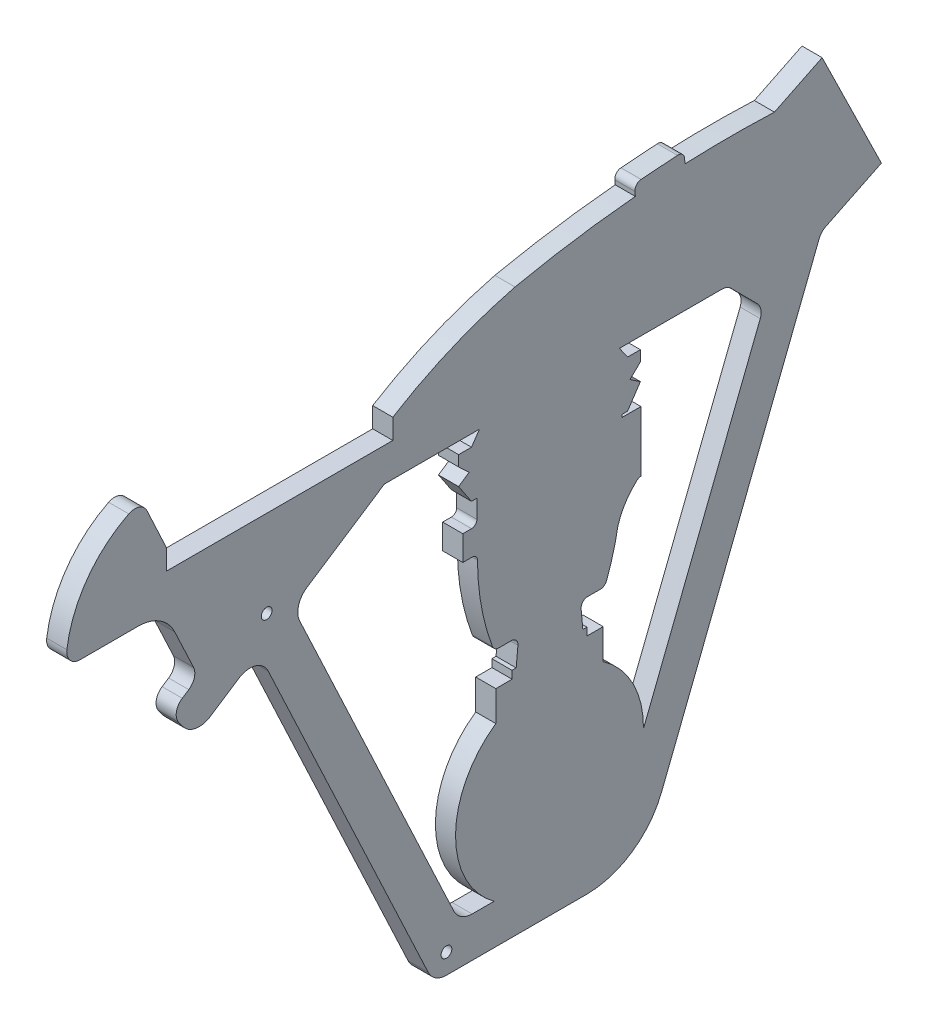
ISO-10303-21;
HEADER;
FILE_DESCRIPTION(('STEP AP214'),'2;1');
FILE_NAME('part.step','',(''),(''),'','','');
FILE_SCHEMA(('AUTOMOTIVE_DESIGN { 1 0 10303 214 1 1 1 1 }'));
ENDSEC;
DATA;
#1=APPLICATION_CONTEXT('core data for automotive mechanical design processes');
#2=APPLICATION_PROTOCOL_DEFINITION('international standard','automotive_design',2000,#1);
#3=PRODUCT_CONTEXT('',#1,'mechanical');
#4=PRODUCT('Part','Part','',(#3));
#5=PRODUCT_RELATED_PRODUCT_CATEGORY('part','',(#4));
#6=PRODUCT_DEFINITION_FORMATION('','',#4);
#7=PRODUCT_DEFINITION_CONTEXT('part definition',#1,'design');
#8=PRODUCT_DEFINITION('design','',#6,#7);
#9=PRODUCT_DEFINITION_SHAPE('','',#8);
#10=(LENGTH_UNIT() NAMED_UNIT(*) SI_UNIT(.MILLI.,.METRE.));
#11=(NAMED_UNIT(*) PLANE_ANGLE_UNIT() SI_UNIT($,.RADIAN.));
#12=(NAMED_UNIT(*) SI_UNIT($,.STERADIAN.) SOLID_ANGLE_UNIT());
#13=UNCERTAINTY_MEASURE_WITH_UNIT(LENGTH_MEASURE(1.E-05),#10,'distance_accuracy_value','');
#14=(GEOMETRIC_REPRESENTATION_CONTEXT(3) GLOBAL_UNCERTAINTY_ASSIGNED_CONTEXT((#13)) GLOBAL_UNIT_ASSIGNED_CONTEXT((#10,
#11,#12)) REPRESENTATION_CONTEXT('',''));
#15=CARTESIAN_POINT('',(0.,0.,0.));
#16=DIRECTION('',(0.,0.,1.));
#17=DIRECTION('',(1.,0.,0.));
#18=AXIS2_PLACEMENT_3D('',#15,#16,#17);
#19=CARTESIAN_POINT('',(15.,0.,-13861.672955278));
#20=DIRECTION('',(0.,0.,1.));
#21=DIRECTION('',(1.,0.,0.));
#22=AXIS2_PLACEMENT_3D('',#19,#20,#21);
#23=PLANE('',#22);
#24=DIRECTION('',(0.,1.,0.));
#25=VECTOR('',#24,1.);
#26=CARTESIAN_POINT('',(15.,0.,-13861.672955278));
#27=LINE('',#26,#25);
#28=CARTESIAN_POINT('',(15.,5299.46716162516,-13861.672955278));
#29=VERTEX_POINT('',#28);
#30=CARTESIAN_POINT('',(15.,5301.42310734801,-13861.672955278));
#31=VERTEX_POINT('',#30);
#32=EDGE_CURVE('E785',#29,#31,#27,.T.);
#33=ORIENTED_EDGE('',*,*,#32,.F.);
#34=DIRECTION('',(1.,0.,0.));
#35=VECTOR('',#34,1.);
#36=CARTESIAN_POINT('',(0.,5299.46716162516,-13861.672955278));
#37=LINE('',#36,#35);
#38=CARTESIAN_POINT('',(0.,5299.46716162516,-13861.672955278));
#39=VERTEX_POINT('',#38);
#40=EDGE_CURVE('E607',#39,#29,#37,.T.);
#41=ORIENTED_EDGE('',*,*,#40,.F.);
#42=DIRECTION('',(0.,1.,0.));
#43=VECTOR('',#42,1.);
#44=CARTESIAN_POINT('',(0.,0.,-13861.672955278));
#45=LINE('',#44,#43);
#46=CARTESIAN_POINT('',(0.,5301.42310734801,-13861.672955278));
#47=VERTEX_POINT('',#46);
#48=EDGE_CURVE('E613',#39,#47,#45,.T.);
#49=ORIENTED_EDGE('',*,*,#48,.T.);
#50=DIRECTION('',(-1.,0.,0.));
#51=VECTOR('',#50,1.);
#52=CARTESIAN_POINT('',(15.,5301.42310734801,-13861.672955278));
#53=LINE('',#52,#51);
#54=EDGE_CURVE('E1104',#31,#47,#53,.T.);
#55=ORIENTED_EDGE('',*,*,#54,.F.);
#56=EDGE_LOOP('',(#33,#41,#49,#55));
#57=FACE_BOUND('',#56,.T.);
#58=ADVANCED_FACE('F37',(#57),#23,.F.);
#59=CARTESIAN_POINT('',(15.,5301.42310734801,0.));
#60=DIRECTION('',(0.,-1.,0.));
#61=DIRECTION('',(0.,0.,-1.));
#62=AXIS2_PLACEMENT_3D('',#59,#60,#61);
#63=PLANE('',#62);
#64=DIRECTION('',(0.,0.,1.));
#65=VECTOR('',#64,1.);
#66=CARTESIAN_POINT('',(0.,5301.42310734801,0.));
#67=LINE('',#66,#65);
#68=CARTESIAN_POINT('',(0.,5301.42310734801,-13865.7191376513));
#69=VERTEX_POINT('',#68);
#70=EDGE_CURVE('E987',#69,#47,#67,.T.);
#71=ORIENTED_EDGE('',*,*,#70,.F.);
#72=DIRECTION('',(-1.,0.,0.));
#73=VECTOR('',#72,1.);
#74=CARTESIAN_POINT('',(15.,5301.42310734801,-13865.7191376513));
#75=LINE('',#74,#73);
#76=CARTESIAN_POINT('',(15.,5301.42310734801,-13865.7191376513));
#77=VERTEX_POINT('',#76);
#78=EDGE_CURVE('E1102',#77,#69,#75,.T.);
#79=ORIENTED_EDGE('',*,*,#78,.F.);
#80=DIRECTION('',(0.,0.,1.));
#81=VECTOR('',#80,1.);
#82=CARTESIAN_POINT('',(15.,5301.42310734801,0.));
#83=LINE('',#82,#81);
#84=EDGE_CURVE('E787',#77,#31,#83,.T.);
#85=ORIENTED_EDGE('',*,*,#84,.T.);
#86=ORIENTED_EDGE('',*,*,#54,.T.);
#87=EDGE_LOOP('',(#71,#79,#85,#86));
#88=FACE_BOUND('',#87,.T.);
#89=ADVANCED_FACE('F1452',(#88),#63,.T.);
#90=CARTESIAN_POINT('',(15.,-4769.06384019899,-7127.14453045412));
#91=DIRECTION('',(0.,0.556122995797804,0.831100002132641));
#92=DIRECTION('',(0.,-0.831100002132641,0.556122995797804));
#93=AXIS2_PLACEMENT_3D('',#90,#91,#92);
#94=PLANE('',#93);
#95=DIRECTION('',(0.,0.831100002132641,-0.556122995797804));
#96=VECTOR('',#95,1.);
#97=CARTESIAN_POINT('',(0.,-4769.06384019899,-7127.14453045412));
#98=LINE('',#97,#96);
#99=CARTESIAN_POINT('',(0.,5315.72350718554,-13875.2881199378));
#100=VERTEX_POINT('',#99);
#101=EDGE_CURVE('E989',#69,#100,#98,.T.);
#102=ORIENTED_EDGE('',*,*,#101,.T.);
#103=DIRECTION('',(-1.,0.,0.));
#104=VECTOR('',#103,1.);
#105=CARTESIAN_POINT('',(15.,5315.72350718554,-13875.2881199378));
#106=LINE('',#105,#104);
#107=CARTESIAN_POINT('',(15.,5315.72350718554,-13875.2881199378));
#108=VERTEX_POINT('',#107);
#109=EDGE_CURVE('E1099',#108,#100,#106,.T.);
#110=ORIENTED_EDGE('',*,*,#109,.F.);
#111=DIRECTION('',(0.,0.831100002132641,-0.556122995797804));
#112=VECTOR('',#111,1.);
#113=CARTESIAN_POINT('',(15.,-4769.06384019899,-7127.14453045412));
#114=LINE('',#113,#112);
#115=EDGE_CURVE('E790',#77,#108,#114,.T.);
#116=ORIENTED_EDGE('',*,*,#115,.F.);
#117=ORIENTED_EDGE('',*,*,#78,.T.);
#118=EDGE_LOOP('',(#102,#110,#116,#117));
#119=FACE_BOUND('',#118,.T.);
#120=ADVANCED_FACE('F1460',(#119),#94,.F.);
#121=CARTESIAN_POINT('',(15.,10085.4858052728,-6777.84684178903));
#122=DIRECTION('',(0.,-0.829986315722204,0.557783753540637));
#123=DIRECTION('',(0.,-0.557783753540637,-0.829986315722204));
#124=AXIS2_PLACEMENT_3D('',#121,#122,#123);
#125=PLANE('',#124);
#126=DIRECTION('',(0.,0.557783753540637,0.829986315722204));
#127=VECTOR('',#126,1.);
#128=CARTESIAN_POINT('',(0.,10085.4858052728,-6777.84684178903));
#129=LINE('',#128,#127);
#130=CARTESIAN_POINT('',(0.,5320.97678791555,-13867.4711996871));
#131=VERTEX_POINT('',#130);
#132=EDGE_CURVE('E991',#100,#131,#129,.T.);
#133=ORIENTED_EDGE('',*,*,#132,.T.);
#134=DIRECTION('',(-1.,0.,0.));
#135=VECTOR('',#134,1.);
#136=CARTESIAN_POINT('',(15.,5320.97678791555,-13867.4711996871));
#137=LINE('',#136,#135);
#138=CARTESIAN_POINT('',(15.,5320.97678791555,-13867.4711996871));
#139=VERTEX_POINT('',#138);
#140=EDGE_CURVE('E1096',#139,#131,#137,.T.);
#141=ORIENTED_EDGE('',*,*,#140,.F.);
#142=DIRECTION('',(0.,0.557783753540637,0.829986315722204));
#143=VECTOR('',#142,1.);
#144=CARTESIAN_POINT('',(15.,10085.4858052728,-6777.84684178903));
#145=LINE('',#144,#143);
#146=EDGE_CURVE('E792',#108,#139,#145,.T.);
#147=ORIENTED_EDGE('',*,*,#146,.F.);
#148=ORIENTED_EDGE('',*,*,#109,.T.);
#149=EDGE_LOOP('',(#133,#141,#147,#148));
#150=FACE_BOUND('',#149,.T.);
#151=ADVANCED_FACE('F2217',(#150),#125,.F.);
#152=CARTESIAN_POINT('',(15.,-4120.63712789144,-3905.33263460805));
#153=DIRECTION('',(0.,0.725814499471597,0.68789047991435));
#154=DIRECTION('',(0.,-0.68789047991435,0.725814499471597));
#155=AXIS2_PLACEMENT_3D('',#152,#153,#154);
#156=PLANE('',#155);
#157=DIRECTION('',(0.,0.68789047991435,-0.725814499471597));
#158=VECTOR('',#157,1.);
#159=CARTESIAN_POINT('',(0.,-4120.63712789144,-3905.33263460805));
#160=LINE('',#159,#158);
#161=CARTESIAN_POINT('',(0.,5328.38527180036,-13875.2881199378));
#162=VERTEX_POINT('',#161);
#163=EDGE_CURVE('E993',#131,#162,#160,.T.);
#164=ORIENTED_EDGE('',*,*,#163,.T.);
#165=DIRECTION('',(-1.,0.,0.));
#166=VECTOR('',#165,1.);
#167=CARTESIAN_POINT('',(15.,5328.38527180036,-13875.2881199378));
#168=LINE('',#167,#166);
#169=CARTESIAN_POINT('',(15.,5328.38527180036,-13875.2881199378));
#170=VERTEX_POINT('',#169);
#171=EDGE_CURVE('E1093',#170,#162,#168,.T.);
#172=ORIENTED_EDGE('',*,*,#171,.F.);
#173=DIRECTION('',(0.,0.68789047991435,-0.725814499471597));
#174=VECTOR('',#173,1.);
#175=CARTESIAN_POINT('',(15.,-4120.63712789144,-3905.33263460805));
#176=LINE('',#175,#174);
#177=EDGE_CURVE('E794',#139,#170,#176,.T.);
#178=ORIENTED_EDGE('',*,*,#177,.F.);
#179=ORIENTED_EDGE('',*,*,#140,.T.);
#180=EDGE_LOOP('',(#164,#172,#178,#179));
#181=FACE_BOUND('',#180,.T.);
#182=ADVANCED_FACE('F2207',(#181),#156,.F.);
#183=CARTESIAN_POINT('',(15.,0.,-13875.2881199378));
#184=DIRECTION('',(0.,0.,1.));
#185=DIRECTION('',(1.,0.,0.));
#186=AXIS2_PLACEMENT_3D('',#183,#184,#185);
#187=PLANE('',#186);
#188=DIRECTION('',(0.,1.,0.));
#189=VECTOR('',#188,1.);
#190=CARTESIAN_POINT('',(0.,0.,-13875.2881199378));
#191=LINE('',#190,#189);
#192=CARTESIAN_POINT('',(0.,5336.33255647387,-13875.2881199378));
#193=VERTEX_POINT('',#192);
#194=EDGE_CURVE('E995',#162,#193,#191,.T.);
#195=ORIENTED_EDGE('',*,*,#194,.T.);
#196=DIRECTION('',(-1.,0.,0.));
#197=VECTOR('',#196,1.);
#198=CARTESIAN_POINT('',(15.,5336.33255647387,-13875.2881199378));
#199=LINE('',#198,#197);
#200=CARTESIAN_POINT('',(15.,5336.33255647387,-13875.2881199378));
#201=VERTEX_POINT('',#200);
#202=EDGE_CURVE('E1090',#201,#193,#199,.T.);
#203=ORIENTED_EDGE('',*,*,#202,.F.);
#204=DIRECTION('',(0.,1.,0.));
#205=VECTOR('',#204,1.);
#206=CARTESIAN_POINT('',(15.,0.,-13875.2881199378));
#207=LINE('',#206,#205);
#208=EDGE_CURVE('E796',#170,#201,#207,.T.);
#209=ORIENTED_EDGE('',*,*,#208,.F.);
#210=ORIENTED_EDGE('',*,*,#171,.T.);
#211=EDGE_LOOP('',(#195,#203,#209,#210));
#212=FACE_BOUND('',#211,.T.);
#213=ADVANCED_FACE('F2196',(#212),#187,.F.);
#214=CARTESIAN_POINT('',(15.,5336.33255647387,0.));
#215=DIRECTION('',(0.,-1.,0.));
#216=DIRECTION('',(0.,0.,-1.));
#217=AXIS2_PLACEMENT_3D('',#214,#215,#216);
#218=PLANE('',#217);
#219=DIRECTION('',(0.,0.,1.));
#220=VECTOR('',#219,1.);
#221=CARTESIAN_POINT('',(0.,5336.33255647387,0.));
#222=LINE('',#221,#220);
#223=CARTESIAN_POINT('',(0.,5336.33255647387,-13865.7191376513));
#224=VERTEX_POINT('',#223);
#225=EDGE_CURVE('E997',#193,#224,#222,.T.);
#226=ORIENTED_EDGE('',*,*,#225,.T.);
#227=DIRECTION('',(-1.,0.,0.));
#228=VECTOR('',#227,1.);
#229=CARTESIAN_POINT('',(15.,5336.33255647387,-13865.7191376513));
#230=LINE('',#229,#228);
#231=CARTESIAN_POINT('',(15.,5336.33255647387,-13865.7191376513));
#232=VERTEX_POINT('',#231);
#233=EDGE_CURVE('E1087',#232,#224,#230,.T.);
#234=ORIENTED_EDGE('',*,*,#233,.F.);
#235=DIRECTION('',(0.,0.,1.));
#236=VECTOR('',#235,1.);
#237=CARTESIAN_POINT('',(15.,5336.33255647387,0.));
#238=LINE('',#237,#236);
#239=EDGE_CURVE('E798',#201,#232,#238,.T.);
#240=ORIENTED_EDGE('',*,*,#239,.F.);
#241=ORIENTED_EDGE('',*,*,#202,.T.);
#242=EDGE_LOOP('',(#226,#234,#240,#241));
#243=FACE_BOUND('',#242,.T.);
#244=ADVANCED_FACE('F2186',(#243),#218,.F.);
#245=CARTESIAN_POINT('',(15.,8237.05740172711,-11849.2713441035));
#246=DIRECTION('',(0.,-0.570788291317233,0.821097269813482));
#247=DIRECTION('',(0.,-0.821097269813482,-0.570788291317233));
#248=AXIS2_PLACEMENT_3D('',#245,#246,#247);
#249=PLANE('',#248);
#250=DIRECTION('',(0.,0.821097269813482,0.570788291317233));
#251=VECTOR('',#250,1.);
#252=CARTESIAN_POINT('',(0.,8237.05740172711,-11849.2713441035));
#253=LINE('',#252,#251);
#254=CARTESIAN_POINT('',(0.,5344.98694304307,-13859.7030142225));
#255=VERTEX_POINT('',#254);
#256=EDGE_CURVE('E999',#224,#255,#253,.T.);
#257=ORIENTED_EDGE('',*,*,#256,.T.);
#258=DIRECTION('',(-1.,0.,0.));
#259=VECTOR('',#258,1.);
#260=CARTESIAN_POINT('',(15.,5344.98694304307,-13859.7030142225));
#261=LINE('',#260,#259);
#262=CARTESIAN_POINT('',(15.,5344.98694304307,-13859.7030142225));
#263=VERTEX_POINT('',#262);
#264=EDGE_CURVE('E1084',#263,#255,#261,.T.);
#265=ORIENTED_EDGE('',*,*,#264,.F.);
#266=DIRECTION('',(0.,0.821097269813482,0.570788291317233));
#267=VECTOR('',#266,1.);
#268=CARTESIAN_POINT('',(15.,8237.05740172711,-11849.2713441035));
#269=LINE('',#268,#267);
#270=EDGE_CURVE('E800',#232,#263,#269,.T.);
#271=ORIENTED_EDGE('',*,*,#270,.F.);
#272=ORIENTED_EDGE('',*,*,#233,.T.);
#273=EDGE_LOOP('',(#257,#265,#271,#272));
#274=FACE_BOUND('',#273,.T.);
#275=ADVANCED_FACE('F2176',(#274),#249,.F.);
#276=CARTESIAN_POINT('',(15.,5344.98694304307,0.));
#277=DIRECTION('',(0.,1.,0.));
#278=DIRECTION('',(0.,0.,1.));
#279=AXIS2_PLACEMENT_3D('',#276,#277,#278);
#280=PLANE('',#279);
#281=DIRECTION('',(0.,0.,-1.));
#282=VECTOR('',#281,1.);
#283=CARTESIAN_POINT('',(0.,5344.98694304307,0.));
#284=LINE('',#283,#282);
#285=CARTESIAN_POINT('',(0.,5344.98694304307,-13935.826361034));
#286=VERTEX_POINT('',#285);
#287=EDGE_CURVE('E1001',#255,#286,#284,.T.);
#288=ORIENTED_EDGE('',*,*,#287,.T.);
#289=DIRECTION('',(-1.,0.,0.));
#290=VECTOR('',#289,1.);
#291=CARTESIAN_POINT('',(15.,5344.98694304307,-13935.826361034));
#292=LINE('',#291,#290);
#293=CARTESIAN_POINT('',(15.,5344.98694304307,-13935.826361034));
#294=VERTEX_POINT('',#293);
#295=EDGE_CURVE('E1082',#294,#286,#292,.T.);
#296=ORIENTED_EDGE('',*,*,#295,.F.);
#297=DIRECTION('',(0.,0.,-1.));
#298=VECTOR('',#297,1.);
#299=CARTESIAN_POINT('',(15.,5344.98694304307,0.));
#300=LINE('',#299,#298);
#301=EDGE_CURVE('E802',#263,#294,#300,.T.);
#302=ORIENTED_EDGE('',*,*,#301,.F.);
#303=ORIENTED_EDGE('',*,*,#264,.T.);
#304=EDGE_LOOP('',(#288,#296,#302,#303));
#305=FACE_BOUND('',#304,.T.);
#306=ADVANCED_FACE('F2166',(#305),#280,.F.);
#307=CARTESIAN_POINT('',(15.,5334.98694304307,-13935.826361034));
#308=DIRECTION('',(-1.,0.,0.));
#309=DIRECTION('',(0.,0.,1.));
#310=AXIS2_PLACEMENT_3D('',#307,#308,#309);
#311=CYLINDRICAL_SURFACE('',#310,9.99999999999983);
#312=CARTESIAN_POINT('',(0.,5334.98694304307,-13935.826361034));
#313=DIRECTION('',(1.,0.,0.));
#314=DIRECTION('',(0.,0.,-1.));
#315=AXIS2_PLACEMENT_3D('',#312,#313,#314);
#316=CIRCLE('',#315,9.99999999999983);
#317=CARTESIAN_POINT('',(0.,5342.02647671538,-13942.9288229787));
#318=VERTEX_POINT('',#317);
#319=EDGE_CURVE('E1004',#318,#286,#316,.T.);
#320=ORIENTED_EDGE('',*,*,#319,.F.);
#321=DIRECTION('',(-1.,0.,0.));
#322=VECTOR('',#321,1.);
#323=CARTESIAN_POINT('',(15.,5342.02647671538,-13942.9288229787));
#324=LINE('',#323,#322);
#325=CARTESIAN_POINT('',(15.,5342.02647671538,-13942.9288229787));
#326=VERTEX_POINT('',#325);
#327=EDGE_CURVE('E1080',#326,#318,#324,.T.);
#328=ORIENTED_EDGE('',*,*,#327,.F.);
#329=CARTESIAN_POINT('',(15.,5334.98694304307,-13935.826361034));
#330=DIRECTION('',(1.,0.,0.));
#331=DIRECTION('',(0.,0.,-1.));
#332=AXIS2_PLACEMENT_3D('',#329,#330,#331);
#333=CIRCLE('',#332,9.99999999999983);
#334=EDGE_CURVE('E804',#326,#294,#333,.T.);
#335=ORIENTED_EDGE('',*,*,#334,.T.);
#336=ORIENTED_EDGE('',*,*,#295,.T.);
#337=EDGE_LOOP('',(#320,#328,#335,#336));
#338=FACE_BOUND('',#337,.T.);
#339=ADVANCED_FACE('F2156',(#338),#311,.F.);
#340=CARTESIAN_POINT('',(15.,9618.43139788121,-9704.41312613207));
#341=DIRECTION('',(0.,0.703953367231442,-0.710246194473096));
#342=DIRECTION('',(0.,0.710246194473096,0.703953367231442));
#343=AXIS2_PLACEMENT_3D('',#340,#341,#342);
#344=PLANE('',#343);
#345=DIRECTION('',(0.,-0.710246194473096,-0.703953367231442));
#346=VECTOR('',#345,1.);
#347=CARTESIAN_POINT('',(0.,9618.43139788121,-9704.41312613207));
#348=LINE('',#347,#346);
#349=CARTESIAN_POINT('',(0.,5322.42228605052,-13962.3593192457));
#350=VERTEX_POINT('',#349);
#351=EDGE_CURVE('E1007',#318,#350,#348,.T.);
#352=ORIENTED_EDGE('',*,*,#351,.T.);
#353=DIRECTION('',(-1.,0.,0.));
#354=VECTOR('',#353,1.);
#355=CARTESIAN_POINT('',(15.,5322.42228605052,-13962.3593192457));
#356=LINE('',#355,#354);
#357=CARTESIAN_POINT('',(15.,5322.42228605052,-13962.3593192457));
#358=VERTEX_POINT('',#357);
#359=EDGE_CURVE('E1078',#358,#350,#356,.T.);
#360=ORIENTED_EDGE('',*,*,#359,.F.);
#361=DIRECTION('',(0.,-0.710246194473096,-0.703953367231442));
#362=VECTOR('',#361,1.);
#363=CARTESIAN_POINT('',(15.,9618.43139788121,-9704.41312613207));
#364=LINE('',#363,#362);
#365=EDGE_CURVE('E807',#326,#358,#364,.T.);
#366=ORIENTED_EDGE('',*,*,#365,.F.);
#367=ORIENTED_EDGE('',*,*,#327,.T.);
#368=EDGE_LOOP('',(#352,#360,#366,#367));
#369=FACE_BOUND('',#368,.T.);
#370=ADVANCED_FACE('F2146',(#369),#344,.F.);
#371=CARTESIAN_POINT('',(15.,5315.38275237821,-13955.256857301));
#372=DIRECTION('',(-1.,0.,0.));
#373=DIRECTION('',(0.,0.,1.));
#374=AXIS2_PLACEMENT_3D('',#371,#372,#373);
#375=CYLINDRICAL_SURFACE('',#374,9.99999999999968);
#376=CARTESIAN_POINT('',(0.,5315.38275237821,-13955.256857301));
#377=DIRECTION('',(1.,0.,0.));
#378=DIRECTION('',(0.,0.,-1.));
#379=AXIS2_PLACEMENT_3D('',#376,#377,#378);
#380=CIRCLE('',#379,9.99999999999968);
#381=CARTESIAN_POINT('',(0.,5311.7205456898,-13964.5621376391));
#382=VERTEX_POINT('',#381);
#383=EDGE_CURVE('E1010',#382,#350,#380,.T.);
#384=ORIENTED_EDGE('',*,*,#383,.F.);
#385=DIRECTION('',(-1.,0.,0.));
#386=VECTOR('',#385,1.);
#387=CARTESIAN_POINT('',(15.,5311.7205456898,-13964.5621376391));
#388=LINE('',#387,#386);
#389=CARTESIAN_POINT('',(15.,5311.7205456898,-13964.5621376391));
#390=VERTEX_POINT('',#389);
#391=EDGE_CURVE('E1076',#390,#382,#388,.T.);
#392=ORIENTED_EDGE('',*,*,#391,.F.);
#393=CARTESIAN_POINT('',(15.,5315.38275237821,-13955.256857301));
#394=DIRECTION('',(1.,0.,0.));
#395=DIRECTION('',(0.,0.,-1.));
#396=AXIS2_PLACEMENT_3D('',#393,#394,#395);
#397=CIRCLE('',#396,9.99999999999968);
#398=EDGE_CURVE('E809',#390,#358,#397,.T.);
#399=ORIENTED_EDGE('',*,*,#398,.T.);
#400=ORIENTED_EDGE('',*,*,#359,.T.);
#401=EDGE_LOOP('',(#384,#392,#399,#400));
#402=FACE_BOUND('',#401,.T.);
#403=ADVANCED_FACE('F2136',(#402),#375,.F.);
#404=CARTESIAN_POINT('',(15.,-4046.42882365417,-10281.5481965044));
#405=DIRECTION('',(0.,-0.366220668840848,-0.930528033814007));
#406=DIRECTION('',(0.,0.930528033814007,-0.366220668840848));
#407=AXIS2_PLACEMENT_3D('',#404,#405,#406);
#408=PLANE('',#407);
#409=DIRECTION('',(0.,-0.930528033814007,0.366220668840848));
#410=VECTOR('',#409,1.);
#411=CARTESIAN_POINT('',(0.,-4046.42882365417,-10281.5481965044));
#412=LINE('',#411,#410);
#413=CARTESIAN_POINT('',(0.,5090.68935638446,-13877.572614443));
#414=VERTEX_POINT('',#413);
#415=EDGE_CURVE('E1013',#382,#414,#412,.T.);
#416=ORIENTED_EDGE('',*,*,#415,.T.);
#417=DIRECTION('',(-1.,0.,0.));
#418=VECTOR('',#417,1.);
#419=CARTESIAN_POINT('',(15.,5090.68935638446,-13877.572614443));
#420=LINE('',#419,#418);
#421=CARTESIAN_POINT('',(15.,5090.68935638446,-13877.572614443));
#422=VERTEX_POINT('',#421);
#423=EDGE_CURVE('E1073',#422,#414,#420,.T.);
#424=ORIENTED_EDGE('',*,*,#423,.F.);
#425=DIRECTION('',(0.,-0.930528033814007,0.366220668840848));
#426=VECTOR('',#425,1.);
#427=CARTESIAN_POINT('',(15.,-4046.42882365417,-10281.5481965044));
#428=LINE('',#427,#426);
#429=EDGE_CURVE('E812',#390,#422,#428,.T.);
#430=ORIENTED_EDGE('',*,*,#429,.F.);
#431=ORIENTED_EDGE('',*,*,#391,.T.);
#432=EDGE_LOOP('',(#416,#424,#430,#431));
#433=FACE_BOUND('',#432,.T.);
#434=ADVANCED_FACE('F2126',(#433),#408,.F.);
#435=CARTESIAN_POINT('',(15.,5091.52549120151,-13807.5776083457));
#436=DIRECTION('',(-1.,0.,0.));
#437=DIRECTION('',(0.,0.,1.));
#438=AXIS2_PLACEMENT_3D('',#435,#436,#437);
#439=CYLINDRICAL_SURFACE('',#438,70.0000000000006);
#440=CARTESIAN_POINT('',(0.,5091.52549120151,-13807.5776083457));
#441=DIRECTION('',(1.,0.,0.));
#442=DIRECTION('',(0.,0.,-1.));
#443=AXIS2_PLACEMENT_3D('',#440,#441,#442);
#444=CIRCLE('',#443,70.0000000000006);
#445=CARTESIAN_POINT('',(0.,5148.97111766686,-13847.5776083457));
#446=VERTEX_POINT('',#445);
#447=EDGE_CURVE('E1015',#414,#446,#444,.T.);
#448=ORIENTED_EDGE('',*,*,#447,.T.);
#449=DIRECTION('',(-1.,0.,0.));
#450=VECTOR('',#449,1.);
#451=CARTESIAN_POINT('',(15.,5148.97111766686,-13847.5776083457));
#452=LINE('',#451,#450);
#453=CARTESIAN_POINT('',(15.,5148.97111766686,-13847.5776083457));
#454=VERTEX_POINT('',#453);
#455=EDGE_CURVE('E1071',#454,#446,#452,.T.);
#456=ORIENTED_EDGE('',*,*,#455,.F.);
#457=CARTESIAN_POINT('',(15.,5091.52549120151,-13807.5776083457));
#458=DIRECTION('',(1.,0.,0.));
#459=DIRECTION('',(0.,0.,-1.));
#460=AXIS2_PLACEMENT_3D('',#457,#458,#459);
#461=CIRCLE('',#460,70.0000000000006);
#462=EDGE_CURVE('E814',#422,#454,#461,.T.);
#463=ORIENTED_EDGE('',*,*,#462,.F.);
#464=ORIENTED_EDGE('',*,*,#423,.T.);
#465=EDGE_LOOP('',(#448,#456,#463,#464));
#466=FACE_BOUND('',#465,.T.);
#467=ADVANCED_FACE('F2116',(#466),#439,.T.);
#468=CARTESIAN_POINT('',(15.,2.39936286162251E-08,-13847.5776083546));
#469=DIRECTION('',(0.,1.73269500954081E-12,-1.));
#470=DIRECTION('',(0.,1.,1.73269500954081E-12));
#471=AXIS2_PLACEMENT_3D('',#468,#469,#470);
#472=PLANE('',#471);
#473=DIRECTION('',(0.,-1.,-1.73269500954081E-12));
#474=VECTOR('',#473,1.);
#475=CARTESIAN_POINT('',(0.,2.39936286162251E-08,-13847.5776083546));
#476=LINE('',#475,#474);
#477=CARTESIAN_POINT('',(0.,5171.52549120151,-13847.5776083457));
#478=VERTEX_POINT('',#477);
#479=EDGE_CURVE('E1018',#478,#446,#476,.T.);
#480=ORIENTED_EDGE('',*,*,#479,.F.);
#481=DIRECTION('',(-1.,0.,0.));
#482=VECTOR('',#481,1.);
#483=CARTESIAN_POINT('',(15.,5171.52549120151,-13847.5776083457));
#484=LINE('',#483,#482);
#485=CARTESIAN_POINT('',(15.,5171.52549120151,-13847.5776083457));
#486=VERTEX_POINT('',#485);
#487=EDGE_CURVE('E1069',#486,#478,#484,.T.);
#488=ORIENTED_EDGE('',*,*,#487,.F.);
#489=DIRECTION('',(0.,-1.,-1.73269500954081E-12));
#490=VECTOR('',#489,1.);
#491=CARTESIAN_POINT('',(15.,2.39936286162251E-08,-13847.5776083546));
#492=LINE('',#491,#490);
#493=EDGE_CURVE('E816',#486,#454,#492,.T.);
#494=ORIENTED_EDGE('',*,*,#493,.T.);
#495=ORIENTED_EDGE('',*,*,#455,.T.);
#496=EDGE_LOOP('',(#480,#488,#494,#495));
#497=FACE_BOUND('',#496,.T.);
#498=ADVANCED_FACE('F2106',(#497),#472,.T.);
#499=CARTESIAN_POINT('',(15.,5171.52549120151,0.));
#500=DIRECTION('',(0.,-1.,0.));
#501=DIRECTION('',(0.,0.,-1.));
#502=AXIS2_PLACEMENT_3D('',#499,#500,#501);
#503=PLANE('',#502);
#504=DIRECTION('',(0.,0.,1.));
#505=VECTOR('',#504,1.);
#506=CARTESIAN_POINT('',(0.,5171.52549120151,0.));
#507=LINE('',#506,#505);
#508=CARTESIAN_POINT('',(0.,5171.52549120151,-13835.453474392));
#509=VERTEX_POINT('',#508);
#510=EDGE_CURVE('E1021',#478,#509,#507,.T.);
#511=ORIENTED_EDGE('',*,*,#510,.T.);
#512=DIRECTION('',(-1.,0.,0.));
#513=VECTOR('',#512,1.);
#514=CARTESIAN_POINT('',(15.,5171.52549120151,-13835.453474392));
#515=LINE('',#514,#513);
#516=CARTESIAN_POINT('',(15.,5171.52549120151,-13835.453474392));
#517=VERTEX_POINT('',#516);
#518=EDGE_CURVE('E1067',#517,#509,#515,.T.);
#519=ORIENTED_EDGE('',*,*,#518,.F.);
#520=DIRECTION('',(0.,0.,1.));
#521=VECTOR('',#520,1.);
#522=CARTESIAN_POINT('',(15.,5171.52549120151,0.));
#523=LINE('',#522,#521);
#524=EDGE_CURVE('E819',#486,#517,#523,.T.);
#525=ORIENTED_EDGE('',*,*,#524,.F.);
#526=ORIENTED_EDGE('',*,*,#487,.T.);
#527=EDGE_LOOP('',(#511,#519,#525,#526));
#528=FACE_BOUND('',#527,.T.);
#529=ADVANCED_FACE('F2096',(#528),#503,.F.);
#530=CARTESIAN_POINT('',(15.,0.,-13835.453474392));
#531=DIRECTION('',(0.,0.,-1.));
#532=DIRECTION('',(-1.,0.,0.));
#533=AXIS2_PLACEMENT_3D('',#530,#531,#532);
#534=PLANE('',#533);
#535=DIRECTION('',(0.,-1.,0.));
#536=VECTOR('',#535,1.);
#537=CARTESIAN_POINT('',(0.,0.,-13835.453474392));
#538=LINE('',#537,#536);
#539=CARTESIAN_POINT('',(0.,5177.25898363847,-13835.453474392));
#540=VERTEX_POINT('',#539);
#541=EDGE_CURVE('E1024',#540,#509,#538,.T.);
#542=ORIENTED_EDGE('',*,*,#541,.F.);
#543=DIRECTION('',(-1.,0.,0.));
#544=VECTOR('',#543,1.);
#545=CARTESIAN_POINT('',(15.,5177.25898363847,-13835.453474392));
#546=LINE('',#545,#544);
#547=CARTESIAN_POINT('',(15.,5177.25898363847,-13835.453474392));
#548=VERTEX_POINT('',#547);
#549=EDGE_CURVE('E1065',#548,#540,#546,.T.);
#550=ORIENTED_EDGE('',*,*,#549,.F.);
#551=DIRECTION('',(0.,-1.,0.));
#552=VECTOR('',#551,1.);
#553=CARTESIAN_POINT('',(15.,0.,-13835.453474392));
#554=LINE('',#553,#552);
#555=EDGE_CURVE('E821',#548,#517,#554,.T.);
#556=ORIENTED_EDGE('',*,*,#555,.T.);
#557=ORIENTED_EDGE('',*,*,#518,.T.);
#558=EDGE_LOOP('',(#542,#550,#556,#557));
#559=FACE_BOUND('',#558,.T.);
#560=ADVANCED_FACE('F2086',(#559),#534,.T.);
#561=CARTESIAN_POINT('',(15.,5463.29543221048,-113.886528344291));
#562=DIRECTION('',(0.,0.999782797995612,-0.0208412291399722));
#563=DIRECTION('',(0.,0.0208412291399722,0.999782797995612));
#564=AXIS2_PLACEMENT_3D('',#561,#562,#563);
#565=PLANE('',#564);
#566=DIRECTION('',(0.,-0.0208412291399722,-0.999782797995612));
#567=VECTOR('',#566,1.);
#568=CARTESIAN_POINT('',(0.,5463.29543221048,-113.886528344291));
#569=LINE('',#568,#567);
#570=CARTESIAN_POINT('',(0.,5177.3223931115,-13832.411633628));
#571=VERTEX_POINT('',#570);
#572=EDGE_CURVE('E1027',#571,#540,#569,.T.);
#573=ORIENTED_EDGE('',*,*,#572,.F.);
#574=DIRECTION('',(-1.,0.,0.));
#575=VECTOR('',#574,1.);
#576=CARTESIAN_POINT('',(15.,5177.3223931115,-13832.411633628));
#577=LINE('',#576,#575);
#578=CARTESIAN_POINT('',(15.,5177.3223931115,-13832.411633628));
#579=VERTEX_POINT('',#578);
#580=EDGE_CURVE('E1063',#579,#571,#577,.T.);
#581=ORIENTED_EDGE('',*,*,#580,.F.);
#582=DIRECTION('',(0.,-0.0208412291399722,-0.999782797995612));
#583=VECTOR('',#582,1.);
#584=CARTESIAN_POINT('',(15.,5463.29543221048,-113.886528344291));
#585=LINE('',#584,#583);
#586=EDGE_CURVE('E824',#579,#548,#585,.T.);
#587=ORIENTED_EDGE('',*,*,#586,.T.);
#588=ORIENTED_EDGE('',*,*,#549,.T.);
#589=EDGE_LOOP('',(#573,#581,#587,#588));
#590=FACE_BOUND('',#589,.T.);
#591=ADVANCED_FACE('F2076',(#590),#565,.T.);
#592=CARTESIAN_POINT('',(15.,1331.6613768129,-14193.2258899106));
#593=DIRECTION('',(0.,0.0934134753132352,-0.995627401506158));
#594=DIRECTION('',(0.,0.995627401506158,0.0934134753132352));
#595=AXIS2_PLACEMENT_3D('',#592,#593,#594);
#596=PLANE('',#595);
#597=DIRECTION('',(0.,-0.995627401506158,-0.0934134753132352));
#598=VECTOR('',#597,1.);
#599=CARTESIAN_POINT('',(0.,1331.6613768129,-14193.2258899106));
#600=LINE('',#599,#598);
#601=CARTESIAN_POINT('',(0.,5191.20625055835,-13831.1089983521));
#602=VERTEX_POINT('',#601);
#603=EDGE_CURVE('E1030',#602,#571,#600,.T.);
#604=ORIENTED_EDGE('',*,*,#603,.F.);
#605=DIRECTION('',(-1.,0.,0.));
#606=VECTOR('',#605,1.);
#607=CARTESIAN_POINT('',(15.,5191.20625055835,-13831.1089983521));
#608=LINE('',#607,#606);
#609=CARTESIAN_POINT('',(15.,5191.20625055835,-13831.1089983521));
#610=VERTEX_POINT('',#609);
#611=EDGE_CURVE('E1061',#610,#602,#608,.T.);
#612=ORIENTED_EDGE('',*,*,#611,.F.);
#613=DIRECTION('',(0.,-0.995627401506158,-0.0934134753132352));
#614=VECTOR('',#613,1.);
#615=CARTESIAN_POINT('',(15.,1331.6613768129,-14193.2258899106));
#616=LINE('',#615,#614);
#617=EDGE_CURVE('E827',#610,#579,#616,.T.);
#618=ORIENTED_EDGE('',*,*,#617,.T.);
#619=ORIENTED_EDGE('',*,*,#580,.T.);
#620=EDGE_LOOP('',(#604,#612,#618,#619));
#621=FACE_BOUND('',#620,.T.);
#622=ADVANCED_FACE('F2066',(#621),#596,.T.);
#623=CARTESIAN_POINT('',(15.,5191.67331793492,-13836.0871353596));
#624=DIRECTION('',(-1.,0.,0.));
#625=DIRECTION('',(0.,0.,1.));
#626=AXIS2_PLACEMENT_3D('',#623,#624,#625);
#627=CYLINDRICAL_SURFACE('',#626,5.00000000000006);
#628=CARTESIAN_POINT('',(0.,5191.67331793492,-13836.0871353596));
#629=DIRECTION('',(1.,0.,0.));
#630=DIRECTION('',(0.,0.,-1.));
#631=AXIS2_PLACEMENT_3D('',#628,#629,#630);
#632=CIRCLE('',#631,5.00000000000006);
#633=CARTESIAN_POINT('',(0.,5196.67331793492,-13836.0871353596));
#634=VERTEX_POINT('',#633);
#635=EDGE_CURVE('E1033',#634,#602,#632,.T.);
#636=ORIENTED_EDGE('',*,*,#635,.F.);
#637=DIRECTION('',(-1.,0.,0.));
#638=VECTOR('',#637,1.);
#639=CARTESIAN_POINT('',(15.,5196.67331793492,-13836.0871353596));
#640=LINE('',#639,#638);
#641=CARTESIAN_POINT('',(15.,5196.67331793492,-13836.0871353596));
#642=VERTEX_POINT('',#641);
#643=EDGE_CURVE('E1059',#642,#634,#640,.T.);
#644=ORIENTED_EDGE('',*,*,#643,.F.);
#645=CARTESIAN_POINT('',(15.,5191.67331793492,-13836.0871353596));
#646=DIRECTION('',(1.,0.,0.));
#647=DIRECTION('',(0.,0.,-1.));
#648=AXIS2_PLACEMENT_3D('',#645,#646,#647);
#649=CIRCLE('',#648,5.00000000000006);
#650=EDGE_CURVE('E830',#642,#610,#649,.T.);
#651=ORIENTED_EDGE('',*,*,#650,.T.);
#652=ORIENTED_EDGE('',*,*,#611,.T.);
#653=EDGE_LOOP('',(#636,#644,#651,#652));
#654=FACE_BOUND('',#653,.T.);
#655=ADVANCED_FACE('F2056',(#654),#627,.F.);
#656=CARTESIAN_POINT('',(15.,5196.67331793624,-4.96451582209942E-10));
#657=DIRECTION('',(0.,1.,0.));
#658=DIRECTION('',(0.,0.,1.));
#659=AXIS2_PLACEMENT_3D('',#656,#657,#658);
#660=PLANE('',#659);
#661=DIRECTION('',(0.,0.,-1.));
#662=VECTOR('',#661,1.);
#663=CARTESIAN_POINT('',(0.,5196.67331793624,-4.96451582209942E-10));
#664=LINE('',#663,#662);
#665=CARTESIAN_POINT('',(0.,5196.67331793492,-13845.3842617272));
#666=VERTEX_POINT('',#665);
#667=EDGE_CURVE('E1036',#634,#666,#664,.T.);
#668=ORIENTED_EDGE('',*,*,#667,.T.);
#669=DIRECTION('',(-1.,0.,0.));
#670=VECTOR('',#669,1.);
#671=CARTESIAN_POINT('',(15.,5196.67331793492,-13845.3842617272));
#672=LINE('',#671,#670);
#673=CARTESIAN_POINT('',(15.,5196.67331793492,-13845.3842617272));
#674=VERTEX_POINT('',#673);
#675=EDGE_CURVE('E1056',#674,#666,#672,.T.);
#676=ORIENTED_EDGE('',*,*,#675,.F.);
#677=DIRECTION('',(0.,0.,-1.));
#678=VECTOR('',#677,1.);
#679=CARTESIAN_POINT('',(15.,5196.67331793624,-4.96451582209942E-10));
#680=LINE('',#679,#678);
#681=EDGE_CURVE('E833',#642,#674,#680,.T.);
#682=ORIENTED_EDGE('',*,*,#681,.F.);
#683=ORIENTED_EDGE('',*,*,#643,.T.);
#684=EDGE_LOOP('',(#668,#676,#682,#683));
#685=FACE_BOUND('',#684,.T.);
#686=ADVANCED_FACE('F2046',(#685),#660,.F.);
#687=CARTESIAN_POINT('',(15.,5201.67331793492,-13845.3842617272));
#688=DIRECTION('',(-1.,0.,0.));
#689=DIRECTION('',(0.,0.,1.));
#690=AXIS2_PLACEMENT_3D('',#687,#688,#689);
#691=CYLINDRICAL_SURFACE('',#690,4.99999999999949);
#692=CARTESIAN_POINT('',(0.,5201.67331793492,-13845.3842617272));
#693=DIRECTION('',(1.,0.,0.));
#694=DIRECTION('',(0.,0.,-1.));
#695=AXIS2_PLACEMENT_3D('',#692,#693,#694);
#696=CIRCLE('',#695,4.99999999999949);
#697=CARTESIAN_POINT('',(0.,5199.9179007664,-13850.065982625));
#698=VERTEX_POINT('',#697);
#699=EDGE_CURVE('E1038',#666,#698,#696,.T.);
#700=ORIENTED_EDGE('',*,*,#699,.T.);
#701=DIRECTION('',(-1.,0.,0.));
#702=VECTOR('',#701,1.);
#703=CARTESIAN_POINT('',(15.,5199.9179007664,-13850.065982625));
#704=LINE('',#703,#702);
#705=CARTESIAN_POINT('',(15.,5199.9179007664,-13850.065982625));
#706=VERTEX_POINT('',#705);
#707=EDGE_CURVE('E1053',#706,#698,#704,.T.);
#708=ORIENTED_EDGE('',*,*,#707,.F.);
#709=CARTESIAN_POINT('',(15.,5201.67331793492,-13845.3842617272));
#710=DIRECTION('',(1.,0.,0.));
#711=DIRECTION('',(0.,0.,-1.));
#712=AXIS2_PLACEMENT_3D('',#709,#710,#711);
#713=CIRCLE('',#712,4.99999999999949);
#714=EDGE_CURVE('E835',#674,#706,#713,.T.);
#715=ORIENTED_EDGE('',*,*,#714,.F.);
#716=ORIENTED_EDGE('',*,*,#675,.T.);
#717=EDGE_LOOP('',(#700,#708,#715,#716));
#718=FACE_BOUND('',#717,.T.);
#719=ADVANCED_FACE('F2036',(#718),#691,.T.);
#720=CARTESIAN_POINT('',(15.,5261.51970429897,-13685.7731546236));
#721=DIRECTION('',(-1.,0.,0.));
#722=DIRECTION('',(0.,0.,1.));
#723=AXIS2_PLACEMENT_3D('',#720,#721,#722);
#724=CYLINDRICAL_SURFACE('',#723,175.462005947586);
#725=CARTESIAN_POINT('',(0.,5261.51970429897,-13685.7731546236));
#726=DIRECTION('',(1.,0.,0.));
#727=DIRECTION('',(0.,0.,-1.));
#728=AXIS2_PLACEMENT_3D('',#725,#726,#727);
#729=CIRCLE('',#728,175.462005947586);
#730=CARTESIAN_POINT('',(0.,5231.14190193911,-13858.5854940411));
#731=VERTEX_POINT('',#730);
#732=EDGE_CURVE('E1040',#698,#731,#729,.T.);
#733=ORIENTED_EDGE('',*,*,#732,.T.);
#734=DIRECTION('',(-1.,0.,0.));
#735=VECTOR('',#734,1.);
#736=CARTESIAN_POINT('',(15.,5231.14190193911,-13858.5854940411));
#737=LINE('',#736,#735);
#738=CARTESIAN_POINT('',(15.,5231.14190193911,-13858.5854940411));
#739=VERTEX_POINT('',#738);
#740=EDGE_CURVE('E1050',#739,#731,#737,.T.);
#741=ORIENTED_EDGE('',*,*,#740,.F.);
#742=CARTESIAN_POINT('',(15.,5261.51970429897,-13685.7731546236));
#743=DIRECTION('',(1.,0.,0.));
#744=DIRECTION('',(0.,0.,-1.));
#745=AXIS2_PLACEMENT_3D('',#742,#743,#744);
#746=CIRCLE('',#745,175.462005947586);
#747=EDGE_CURVE('E837',#706,#739,#746,.T.);
#748=ORIENTED_EDGE('',*,*,#747,.F.);
#749=ORIENTED_EDGE('',*,*,#707,.T.);
#750=EDGE_LOOP('',(#733,#741,#748,#749));
#751=FACE_BOUND('',#750,.T.);
#752=ADVANCED_FACE('F2026',(#751),#724,.T.);
#753=CARTESIAN_POINT('',(15.,5216.99338577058,-13905.2104653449));
#754=DIRECTION('',(-1.,0.,0.));
#755=DIRECTION('',(0.,0.,1.));
#756=AXIS2_PLACEMENT_3D('',#753,#754,#755);
#757=CYLINDRICAL_SURFACE('',#756,48.7244133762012);
#758=CARTESIAN_POINT('',(0.,5216.99338577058,-13905.2104653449));
#759=DIRECTION('',(1.,0.,0.));
#760=DIRECTION('',(0.,0.,-1.));
#761=AXIS2_PLACEMENT_3D('',#758,#759,#760);
#762=CIRCLE('',#761,48.7244133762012);
#763=CARTESIAN_POINT('',(0.,5253.18062206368,-13872.5829863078));
#764=VERTEX_POINT('',#763);
#765=EDGE_CURVE('E1043',#764,#731,#762,.T.);
#766=ORIENTED_EDGE('',*,*,#765,.F.);
#767=DIRECTION('',(-1.,0.,0.));
#768=VECTOR('',#767,1.);
#769=CARTESIAN_POINT('',(15.,5253.18062206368,-13872.5829863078));
#770=LINE('',#769,#768);
#771=CARTESIAN_POINT('',(15.,5253.18062206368,-13872.5829863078));
#772=VERTEX_POINT('',#771);
#773=EDGE_CURVE('E1047',#772,#764,#770,.T.);
#774=ORIENTED_EDGE('',*,*,#773,.F.);
#775=CARTESIAN_POINT('',(15.,5216.99338577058,-13905.2104653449));
#776=DIRECTION('',(1.,0.,0.));
#777=DIRECTION('',(0.,0.,-1.));
#778=AXIS2_PLACEMENT_3D('',#775,#776,#777);
#779=CIRCLE('',#778,48.7244133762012);
#780=EDGE_CURVE('E839',#772,#739,#779,.T.);
#781=ORIENTED_EDGE('',*,*,#780,.T.);
#782=ORIENTED_EDGE('',*,*,#740,.T.);
#783=EDGE_LOOP('',(#766,#774,#781,#782));
#784=FACE_BOUND('',#783,.T.);
#785=ADVANCED_FACE('F1573',(#784),#757,.F.);
#786=CARTESIAN_POINT('',(15.,5191.67331793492,-13779.0680813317));
#787=DIRECTION('',(-1.,0.,0.));
#788=DIRECTION('',(0.,0.,1.));
#789=AXIS2_PLACEMENT_3D('',#786,#787,#788);
#790=CYLINDRICAL_SURFACE('',#789,5.00000000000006);
#791=CARTESIAN_POINT('',(0.,5191.67331793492,-13779.0680813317));
#792=DIRECTION('',(1.,0.,0.));
#793=DIRECTION('',(0.,0.,-1.));
#794=AXIS2_PLACEMENT_3D('',#791,#792,#793);
#795=CIRCLE('',#794,5.00000000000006);
#796=CARTESIAN_POINT('',(0.,5191.20625055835,-13784.0462183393));
#797=VERTEX_POINT('',#796);
#798=CARTESIAN_POINT('',(0.,5196.67331793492,-13779.0680813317));
#799=VERTEX_POINT('',#798);
#800=EDGE_CURVE('E907',#797,#799,#795,.T.);
#801=ORIENTED_EDGE('',*,*,#800,.F.);
#802=DIRECTION('',(-1.,0.,0.));
#803=VECTOR('',#802,1.);
#804=CARTESIAN_POINT('',(15.,5191.20625055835,-13784.0462183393));
#805=LINE('',#804,#803);
#806=CARTESIAN_POINT('',(15.,5191.20625055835,-13784.0462183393));
#807=VERTEX_POINT('',#806);
#808=EDGE_CURVE('E1051',#807,#797,#805,.T.);
#809=ORIENTED_EDGE('',*,*,#808,.F.);
#810=CARTESIAN_POINT('',(15.,5191.67331793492,-13779.0680813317));
#811=DIRECTION('',(1.,0.,0.));
#812=DIRECTION('',(0.,0.,-1.));
#813=AXIS2_PLACEMENT_3D('',#810,#811,#812);
#814=CIRCLE('',#813,5.00000000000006);
#815=CARTESIAN_POINT('',(15.,5196.67331793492,-13779.0680813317));
#816=VERTEX_POINT('',#815);
#817=EDGE_CURVE('E710',#807,#816,#814,.T.);
#818=ORIENTED_EDGE('',*,*,#817,.T.);
#819=DIRECTION('',(-1.,0.,0.));
#820=VECTOR('',#819,1.);
#821=CARTESIAN_POINT('',(15.,5196.67331793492,-13779.0680813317));
#822=LINE('',#821,#820);
#823=EDGE_CURVE('E1108',#816,#799,#822,.T.);
#824=ORIENTED_EDGE('',*,*,#823,.T.);
#825=EDGE_LOOP('',(#801,#809,#818,#824));
#826=FACE_BOUND('',#825,.T.);
#827=ADVANCED_FACE('F1569',(#826),#790,.F.);
#828=CARTESIAN_POINT('',(15.,-1236.68656744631,-13180.9573457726));
#829=DIRECTION('',(0.,-0.0934134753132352,-0.995627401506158));
#830=DIRECTION('',(0.,0.995627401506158,-0.0934134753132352));
#831=AXIS2_PLACEMENT_3D('',#828,#829,#830);
#832=PLANE('',#831);
#833=DIRECTION('',(0.,-0.995627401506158,0.0934134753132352));
#834=VECTOR('',#833,1.);
#835=CARTESIAN_POINT('',(0.,-1236.68656744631,-13180.9573457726));
#836=LINE('',#835,#834);
#837=CARTESIAN_POINT('',(0.,5177.3223931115,-13782.7435830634));
#838=VERTEX_POINT('',#837);
#839=EDGE_CURVE('E910',#797,#838,#836,.T.);
#840=ORIENTED_EDGE('',*,*,#839,.T.);
#841=DIRECTION('',(-1.,0.,0.));
#842=VECTOR('',#841,1.);
#843=CARTESIAN_POINT('',(15.,5177.3223931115,-13782.7435830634));
#844=LINE('',#843,#842);
#845=CARTESIAN_POINT('',(15.,5177.3223931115,-13782.7435830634));
#846=VERTEX_POINT('',#845);
#847=EDGE_CURVE('E1163',#846,#838,#844,.T.);
#848=ORIENTED_EDGE('',*,*,#847,.F.);
#849=DIRECTION('',(0.,-0.995627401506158,0.0934134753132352));
#850=VECTOR('',#849,1.);
#851=CARTESIAN_POINT('',(15.,-1236.68656744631,-13180.9573457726));
#852=LINE('',#851,#850);
#853=EDGE_CURVE('E713',#807,#846,#852,.T.);
#854=ORIENTED_EDGE('',*,*,#853,.F.);
#855=ORIENTED_EDGE('',*,*,#808,.T.);
#856=EDGE_LOOP('',(#840,#848,#854,#855));
#857=FACE_BOUND('',#856,.T.);
#858=ADVANCED_FACE('F1565',(#857),#832,.F.);
#859=CARTESIAN_POINT('',(15.,4887.8866616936,101.891697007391));
#860=DIRECTION('',(0.,-0.999782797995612,-0.0208412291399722));
#861=DIRECTION('',(0.,0.0208412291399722,-0.999782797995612));
#862=AXIS2_PLACEMENT_3D('',#859,#860,#861);
#863=PLANE('',#862);
#864=DIRECTION('',(0.,-0.0208412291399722,0.999782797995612));
#865=VECTOR('',#864,1.);
#866=CARTESIAN_POINT('',(0.,4887.8866616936,101.891697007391));
#867=LINE('',#866,#865);
#868=CARTESIAN_POINT('',(0.,5177.25898363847,-13779.7017422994));
#869=VERTEX_POINT('',#868);
#870=EDGE_CURVE('E913',#838,#869,#867,.T.);
#871=ORIENTED_EDGE('',*,*,#870,.T.);
#872=DIRECTION('',(-1.,0.,0.));
#873=VECTOR('',#872,1.);
#874=CARTESIAN_POINT('',(15.,5177.25898363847,-13779.7017422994));
#875=LINE('',#874,#873);
#876=CARTESIAN_POINT('',(15.,5177.25898363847,-13779.7017422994));
#877=VERTEX_POINT('',#876);
#878=EDGE_CURVE('E1160',#877,#869,#875,.T.);
#879=ORIENTED_EDGE('',*,*,#878,.F.);
#880=DIRECTION('',(0.,-0.0208412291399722,0.999782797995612));
#881=VECTOR('',#880,1.);
#882=CARTESIAN_POINT('',(15.,4887.8866616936,101.891697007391));
#883=LINE('',#882,#881);
#884=EDGE_CURVE('E716',#846,#877,#883,.T.);
#885=ORIENTED_EDGE('',*,*,#884,.F.);
#886=ORIENTED_EDGE('',*,*,#847,.T.);
#887=EDGE_LOOP('',(#871,#879,#885,#886));
#888=FACE_BOUND('',#887,.T.);
#889=ADVANCED_FACE('F1561',(#888),#863,.F.);
#890=CARTESIAN_POINT('',(15.,0.,-13779.7017422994));
#891=DIRECTION('',(0.,0.,-1.));
#892=DIRECTION('',(-1.,0.,0.));
#893=AXIS2_PLACEMENT_3D('',#890,#891,#892);
#894=PLANE('',#893);
#895=DIRECTION('',(0.,-1.,0.));
#896=VECTOR('',#895,1.);
#897=CARTESIAN_POINT('',(0.,0.,-13779.7017422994));
#898=LINE('',#897,#896);
#899=CARTESIAN_POINT('',(0.,5171.52549120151,-13779.7017422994));
#900=VERTEX_POINT('',#899);
#901=EDGE_CURVE('E916',#869,#900,#898,.T.);
#902=ORIENTED_EDGE('',*,*,#901,.T.);
#903=DIRECTION('',(-1.,0.,0.));
#904=VECTOR('',#903,1.);
#905=CARTESIAN_POINT('',(15.,5171.52549120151,-13779.7017422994));
#906=LINE('',#905,#904);
#907=CARTESIAN_POINT('',(15.,5171.52549120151,-13779.7017422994));
#908=VERTEX_POINT('',#907);
#909=EDGE_CURVE('E1157',#908,#900,#906,.T.);
#910=ORIENTED_EDGE('',*,*,#909,.F.);
#911=DIRECTION('',(0.,-1.,0.));
#912=VECTOR('',#911,1.);
#913=CARTESIAN_POINT('',(15.,0.,-13779.7017422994));
#914=LINE('',#913,#912);
#915=EDGE_CURVE('E719',#877,#908,#914,.T.);
#916=ORIENTED_EDGE('',*,*,#915,.F.);
#917=ORIENTED_EDGE('',*,*,#878,.T.);
#918=EDGE_LOOP('',(#902,#910,#916,#917));
#919=FACE_BOUND('',#918,.T.);
#920=ADVANCED_FACE('F1557',(#919),#894,.F.);
#921=CARTESIAN_POINT('',(15.,5171.52549120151,0.));
#922=DIRECTION('',(0.,-1.,0.));
#923=DIRECTION('',(0.,0.,-1.));
#924=AXIS2_PLACEMENT_3D('',#921,#922,#923);
#925=PLANE('',#924);
#926=DIRECTION('',(0.,0.,1.));
#927=VECTOR('',#926,1.);
#928=CARTESIAN_POINT('',(0.,5171.52549120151,0.));
#929=LINE('',#928,#927);
#930=CARTESIAN_POINT('',(0.,5171.52549120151,-13767.5776083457));
#931=VERTEX_POINT('',#930);
#932=EDGE_CURVE('E919',#900,#931,#929,.T.);
#933=ORIENTED_EDGE('',*,*,#932,.T.);
#934=DIRECTION('',(-1.,0.,0.));
#935=VECTOR('',#934,1.);
#936=CARTESIAN_POINT('',(15.,5171.52549120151,-13767.5776083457));
#937=LINE('',#936,#935);
#938=CARTESIAN_POINT('',(15.,5171.52549120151,-13767.5776083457));
#939=VERTEX_POINT('',#938);
#940=EDGE_CURVE('E1154',#939,#931,#937,.T.);
#941=ORIENTED_EDGE('',*,*,#940,.F.);
#942=DIRECTION('',(0.,0.,1.));
#943=VECTOR('',#942,1.);
#944=CARTESIAN_POINT('',(15.,5171.52549120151,0.));
#945=LINE('',#944,#943);
#946=EDGE_CURVE('E722',#908,#939,#945,.T.);
#947=ORIENTED_EDGE('',*,*,#946,.F.);
#948=ORIENTED_EDGE('',*,*,#909,.T.);
#949=EDGE_LOOP('',(#933,#941,#947,#948));
#950=FACE_BOUND('',#949,.T.);
#951=ADVANCED_FACE('F1553',(#950),#925,.F.);
#952=CARTESIAN_POINT('',(15.,-2.60236505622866E-08,-13767.5776083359));
#953=DIRECTION('',(0.,-1.89021273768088E-12,-1.));
#954=DIRECTION('',(0.,1.,-1.89021273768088E-12));
#955=AXIS2_PLACEMENT_3D('',#952,#953,#954);
#956=PLANE('',#955);
#957=DIRECTION('',(0.,-1.,1.89021273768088E-12));
#958=VECTOR('',#957,1.);
#959=CARTESIAN_POINT('',(0.,-2.60236505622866E-08,-13767.5776083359));
#960=LINE('',#959,#958);
#961=CARTESIAN_POINT('',(0.,5148.97111766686,-13767.5776083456));
#962=VERTEX_POINT('',#961);
#963=EDGE_CURVE('E922',#931,#962,#960,.T.);
#964=ORIENTED_EDGE('',*,*,#963,.T.);
#965=DIRECTION('',(-1.,0.,0.));
#966=VECTOR('',#965,1.);
#967=CARTESIAN_POINT('',(15.,5148.97111766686,-13767.5776083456));
#968=LINE('',#967,#966);
#969=CARTESIAN_POINT('',(15.,5148.97111766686,-13767.5776083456));
#970=VERTEX_POINT('',#969);
#971=EDGE_CURVE('E1151',#970,#962,#968,.T.);
#972=ORIENTED_EDGE('',*,*,#971,.F.);
#973=DIRECTION('',(0.,-1.,1.89021273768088E-12));
#974=VECTOR('',#973,1.);
#975=CARTESIAN_POINT('',(15.,-2.60236505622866E-08,-13767.5776083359));
#976=LINE('',#975,#974);
#977=EDGE_CURVE('E725',#939,#970,#976,.T.);
#978=ORIENTED_EDGE('',*,*,#977,.F.);
#979=ORIENTED_EDGE('',*,*,#940,.T.);
#980=EDGE_LOOP('',(#964,#972,#978,#979));
#981=FACE_BOUND('',#980,.T.);
#982=ADVANCED_FACE('F1549',(#981),#956,.F.);
#983=CARTESIAN_POINT('',(15.,5091.52549120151,-13807.5776083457));
#984=DIRECTION('',(-1.,0.,0.));
#985=DIRECTION('',(0.,0.,1.));
#986=AXIS2_PLACEMENT_3D('',#983,#984,#985);
#987=CYLINDRICAL_SURFACE('',#986,69.9999999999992);
#988=CARTESIAN_POINT('',(0.,5091.52549120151,-13807.5776083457));
#989=DIRECTION('',(1.,0.,0.));
#990=DIRECTION('',(0.,0.,-1.));
#991=AXIS2_PLACEMENT_3D('',#988,#989,#990);
#992=CIRCLE('',#991,69.9999999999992);
#993=CARTESIAN_POINT('',(0.,5034.98694304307,-13766.3054316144));
#994=VERTEX_POINT('',#993);
#995=EDGE_CURVE('E925',#962,#994,#992,.T.);
#996=ORIENTED_EDGE('',*,*,#995,.T.);
#997=DIRECTION('',(-1.,0.,0.));
#998=VECTOR('',#997,1.);
#999=CARTESIAN_POINT('',(15.,5034.98694304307,-13766.3054316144));
#1000=LINE('',#999,#998);
#1001=CARTESIAN_POINT('',(15.,5034.98694304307,-13766.3054316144));
#1002=VERTEX_POINT('',#1001);
#1003=EDGE_CURVE('E1148',#1002,#994,#1000,.T.);
#1004=ORIENTED_EDGE('',*,*,#1003,.F.);
#1005=CARTESIAN_POINT('',(15.,5091.52549120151,-13807.5776083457));
#1006=DIRECTION('',(1.,0.,0.));
#1007=DIRECTION('',(0.,0.,-1.));
#1008=AXIS2_PLACEMENT_3D('',#1005,#1006,#1007);
#1009=CIRCLE('',#1008,69.9999999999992);
#1010=EDGE_CURVE('E728',#970,#1002,#1009,.T.);
#1011=ORIENTED_EDGE('',*,*,#1010,.F.);
#1012=ORIENTED_EDGE('',*,*,#971,.T.);
#1013=EDGE_LOOP('',(#996,#1004,#1011,#1012));
#1014=FACE_BOUND('',#1013,.T.);
#1015=ADVANCED_FACE('F1545',(#1014),#987,.T.);
#1016=CARTESIAN_POINT('',(15.,5034.98694304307,0.));
#1017=DIRECTION('',(0.,1.,0.));
#1018=DIRECTION('',(0.,0.,1.));
#1019=AXIS2_PLACEMENT_3D('',#1016,#1017,#1018);
#1020=PLANE('',#1019);
#1021=DIRECTION('',(0.,0.,-1.));
#1022=VECTOR('',#1021,1.);
#1023=CARTESIAN_POINT('',(0.,5034.98694304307,0.));
#1024=LINE('',#1023,#1022);
#1025=CARTESIAN_POINT('',(0.,5034.98694304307,-13749.895794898));
#1026=VERTEX_POINT('',#1025);
#1027=EDGE_CURVE('E928',#1026,#994,#1024,.T.);
#1028=ORIENTED_EDGE('',*,*,#1027,.F.);
#1029=DIRECTION('',(-1.,0.,0.));
#1030=VECTOR('',#1029,1.);
#1031=CARTESIAN_POINT('',(15.,5034.98694304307,-13749.895794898));
#1032=LINE('',#1031,#1030);
#1033=CARTESIAN_POINT('',(15.,5034.98694304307,-13749.895794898));
#1034=VERTEX_POINT('',#1033);
#1035=EDGE_CURVE('E1223',#1026,#1034,#1032,.F.);
#1036=ORIENTED_EDGE('',*,*,#1035,.T.);
#1037=DIRECTION('',(0.,0.,-1.));
#1038=VECTOR('',#1037,1.);
#1039=CARTESIAN_POINT('',(15.,5034.98694304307,0.));
#1040=LINE('',#1039,#1038);
#1041=EDGE_CURVE('E731',#1034,#1002,#1040,.T.);
#1042=ORIENTED_EDGE('',*,*,#1041,.T.);
#1043=ORIENTED_EDGE('',*,*,#1003,.T.);
#1044=EDGE_LOOP('',(#1028,#1036,#1042,#1043));
#1045=FACE_BOUND('',#1044,.T.);
#1046=ADVANCED_FACE('F1541',(#1045),#1020,.T.);
#1047=CARTESIAN_POINT('',(15.,6194.53960749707,-13196.0448756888));
#1048=DIRECTION('',(0.,0.42493399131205,-0.905224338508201));
#1049=DIRECTION('',(0.,0.905224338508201,0.42493399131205));
#1050=AXIS2_PLACEMENT_3D('',#1047,#1048,#1049);
#1051=PLANE('',#1050);
#1052=DIRECTION('',(0.,-0.905224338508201,-0.42493399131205));
#1053=VECTOR('',#1052,1.);
#1054=CARTESIAN_POINT('',(15.,6194.53960749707,-13196.0448756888));
#1055=LINE('',#1054,#1053);
#1056=CARTESIAN_POINT('',(15.,5288.19258921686,-13621.5058797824));
#1057=VERTEX_POINT('',#1056);
#1058=CARTESIAN_POINT('',(15.,5043.61293317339,-13736.3174298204));
#1059=VERTEX_POINT('',#1058);
#1060=EDGE_CURVE('E733',#1057,#1059,#1055,.T.);
#1061=ORIENTED_EDGE('',*,*,#1060,.T.);
#1062=DIRECTION('',(-1.,0.,0.));
#1063=VECTOR('',#1062,1.);
#1064=CARTESIAN_POINT('',(0.,5043.61293317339,-13736.3174298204));
#1065=LINE('',#1064,#1063);
#1066=CARTESIAN_POINT('',(0.,5043.61293317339,-13736.3174298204));
#1067=VERTEX_POINT('',#1066);
#1068=EDGE_CURVE('E1220',#1059,#1067,#1065,.T.);
#1069=ORIENTED_EDGE('',*,*,#1068,.T.);
#1070=DIRECTION('',(0.,-0.905224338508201,-0.42493399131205));
#1071=VECTOR('',#1070,1.);
#1072=CARTESIAN_POINT('',(0.,6194.53960749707,-13196.0448756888));
#1073=LINE('',#1072,#1071);
#1074=CARTESIAN_POINT('',(0.,5288.19258921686,-13621.5058797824));
#1075=VERTEX_POINT('',#1074);
#1076=EDGE_CURVE('E930',#1075,#1067,#1073,.T.);
#1077=ORIENTED_EDGE('',*,*,#1076,.F.);
#1078=DIRECTION('',(-1.,0.,0.));
#1079=VECTOR('',#1078,1.);
#1080=CARTESIAN_POINT('',(15.,5288.19258921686,-13621.5058797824));
#1081=LINE('',#1080,#1079);
#1082=EDGE_CURVE('E1218',#1075,#1057,#1081,.F.);
#1083=ORIENTED_EDGE('',*,*,#1082,.T.);
#1084=EDGE_LOOP('',(#1061,#1069,#1077,#1083));
#1085=FACE_BOUND('',#1084,.T.);
#1086=ADVANCED_FACE('F1537',(#1085),#1051,.T.);
#1087=CARTESIAN_POINT('',(15.,-2540.61538249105,-1667.09402025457));
#1088=DIRECTION('',(0.,0.836075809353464,0.548613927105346));
#1089=DIRECTION('',(0.,-0.548613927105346,0.836075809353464));
#1090=AXIS2_PLACEMENT_3D('',#1087,#1088,#1089);
#1091=PLANE('',#1090);
#1092=DIRECTION('',(0.,0.548613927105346,-0.836075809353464));
#1093=VECTOR('',#1092,1.);
#1094=CARTESIAN_POINT('',(15.,-2540.61538249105,-1667.09402025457));
#1095=LINE('',#1094,#1093);
#1096=CARTESIAN_POINT('',(15.,5307.10773622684,-13626.8550359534));
#1097=VERTEX_POINT('',#1096);
#1098=CARTESIAN_POINT('',(15.,5344.98694304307,-13684.5821313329));
#1099=VERTEX_POINT('',#1098);
#1100=EDGE_CURVE('E736',#1097,#1099,#1095,.T.);
#1101=ORIENTED_EDGE('',*,*,#1100,.F.);
#1102=DIRECTION('',(-1.,0.,0.));
#1103=VECTOR('',#1102,1.);
#1104=CARTESIAN_POINT('',(15.,5307.10773622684,-13626.8550359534));
#1105=LINE('',#1104,#1103);
#1106=CARTESIAN_POINT('',(0.,5307.10773622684,-13626.8550359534));
#1107=VERTEX_POINT('',#1106);
#1108=EDGE_CURVE('E1225',#1097,#1107,#1105,.T.);
#1109=ORIENTED_EDGE('',*,*,#1108,.T.);
#1110=DIRECTION('',(0.,0.548613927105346,-0.836075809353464));
#1111=VECTOR('',#1110,1.);
#1112=CARTESIAN_POINT('',(0.,-2540.61538249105,-1667.09402025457));
#1113=LINE('',#1112,#1111);
#1114=CARTESIAN_POINT('',(0.,5344.98694304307,-13684.5821313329));
#1115=VERTEX_POINT('',#1114);
#1116=EDGE_CURVE('E933',#1107,#1115,#1113,.T.);
#1117=ORIENTED_EDGE('',*,*,#1116,.T.);
#1118=DIRECTION('',(-1.,0.,0.));
#1119=VECTOR('',#1118,1.);
#1120=CARTESIAN_POINT('',(15.,5344.98694304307,-13684.5821313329));
#1121=LINE('',#1120,#1119);
#1122=EDGE_CURVE('E1145',#1099,#1115,#1121,.T.);
#1123=ORIENTED_EDGE('',*,*,#1122,.F.);
#1124=EDGE_LOOP('',(#1101,#1109,#1117,#1123));
#1125=FACE_BOUND('',#1124,.T.);
#1126=ADVANCED_FACE('F1533',(#1125),#1091,.F.);
#1127=CARTESIAN_POINT('',(15.,5344.98694304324,-6.69859925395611E-11));
#1128=DIRECTION('',(0.,1.,0.));
#1129=DIRECTION('',(0.,0.,1.));
#1130=AXIS2_PLACEMENT_3D('',#1127,#1128,#1129);
#1131=PLANE('',#1130);
#1132=DIRECTION('',(0.,0.,-1.));
#1133=VECTOR('',#1132,1.);
#1134=CARTESIAN_POINT('',(0.,5344.98694304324,-6.69859925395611E-11));
#1135=LINE('',#1134,#1133);
#1136=CARTESIAN_POINT('',(0.,5344.98694304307,-13755.4522024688));
#1137=VERTEX_POINT('',#1136);
#1138=EDGE_CURVE('E935',#1115,#1137,#1135,.T.);
#1139=ORIENTED_EDGE('',*,*,#1138,.T.);
#1140=DIRECTION('',(-1.,0.,0.));
#1141=VECTOR('',#1140,1.);
#1142=CARTESIAN_POINT('',(15.,5344.98694304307,-13755.4522024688));
#1143=LINE('',#1142,#1141);
#1144=CARTESIAN_POINT('',(15.,5344.98694304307,-13755.4522024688));
#1145=VERTEX_POINT('',#1144);
#1146=EDGE_CURVE('E1143',#1145,#1137,#1143,.T.);
#1147=ORIENTED_EDGE('',*,*,#1146,.F.);
#1148=DIRECTION('',(0.,0.,-1.));
#1149=VECTOR('',#1148,1.);
#1150=CARTESIAN_POINT('',(15.,5344.98694304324,-6.69859925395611E-11));
#1151=LINE('',#1150,#1149);
#1152=EDGE_CURVE('E738',#1099,#1145,#1151,.T.);
#1153=ORIENTED_EDGE('',*,*,#1152,.F.);
#1154=ORIENTED_EDGE('',*,*,#1122,.T.);
#1155=EDGE_LOOP('',(#1139,#1147,#1153,#1154));
#1156=FACE_BOUND('',#1155,.T.);
#1157=ADVANCED_FACE('F1529',(#1156),#1131,.F.);
#1158=CARTESIAN_POINT('',(15.,-4705.41216563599,-6768.88636526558));
#1159=DIRECTION('',(0.,0.570788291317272,0.821097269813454));
#1160=DIRECTION('',(0.,-0.821097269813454,0.570788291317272));
#1161=AXIS2_PLACEMENT_3D('',#1158,#1159,#1160);
#1162=PLANE('',#1161);
#1163=DIRECTION('',(0.,0.821097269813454,-0.570788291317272));
#1164=VECTOR('',#1163,1.);
#1165=CARTESIAN_POINT('',(0.,-4705.41216563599,-6768.88636526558));
#1166=LINE('',#1165,#1164);
#1167=CARTESIAN_POINT('',(0.,5336.33255647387,-13749.4360790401));
#1168=VERTEX_POINT('',#1167);
#1169=EDGE_CURVE('E938',#1168,#1137,#1166,.T.);
#1170=ORIENTED_EDGE('',*,*,#1169,.F.);
#1171=DIRECTION('',(-1.,0.,0.));
#1172=VECTOR('',#1171,1.);
#1173=CARTESIAN_POINT('',(15.,5336.33255647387,-13749.4360790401));
#1174=LINE('',#1173,#1172);
#1175=CARTESIAN_POINT('',(15.,5336.33255647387,-13749.4360790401));
#1176=VERTEX_POINT('',#1175);
#1177=EDGE_CURVE('E1141',#1176,#1168,#1174,.T.);
#1178=ORIENTED_EDGE('',*,*,#1177,.F.);
#1179=DIRECTION('',(0.,0.821097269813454,-0.570788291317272));
#1180=VECTOR('',#1179,1.);
#1181=CARTESIAN_POINT('',(15.,-4705.41216563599,-6768.88636526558));
#1182=LINE('',#1181,#1180);
#1183=EDGE_CURVE('E740',#1176,#1145,#1182,.T.);
#1184=ORIENTED_EDGE('',*,*,#1183,.T.);
#1185=ORIENTED_EDGE('',*,*,#1146,.T.);
#1186=EDGE_LOOP('',(#1170,#1178,#1184,#1185));
#1187=FACE_BOUND('',#1186,.T.);
#1188=ADVANCED_FACE('F1525',(#1187),#1162,.T.);
#1189=CARTESIAN_POINT('',(15.,5336.33255647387,0.));
#1190=DIRECTION('',(0.,1.,0.));
#1191=DIRECTION('',(0.,0.,1.));
#1192=AXIS2_PLACEMENT_3D('',#1189,#1190,#1191);
#1193=PLANE('',#1192);
#1194=DIRECTION('',(0.,0.,-1.));
#1195=VECTOR('',#1194,1.);
#1196=CARTESIAN_POINT('',(0.,5336.33255647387,0.));
#1197=LINE('',#1196,#1195);
#1198=CARTESIAN_POINT('',(0.,5336.33255647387,-13739.8670967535));
#1199=VERTEX_POINT('',#1198);
#1200=EDGE_CURVE('E941',#1199,#1168,#1197,.T.);
#1201=ORIENTED_EDGE('',*,*,#1200,.F.);
#1202=DIRECTION('',(-1.,0.,0.));
#1203=VECTOR('',#1202,1.);
#1204=CARTESIAN_POINT('',(15.,5336.33255647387,-13739.8670967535));
#1205=LINE('',#1204,#1203);
#1206=CARTESIAN_POINT('',(15.,5336.33255647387,-13739.8670967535));
#1207=VERTEX_POINT('',#1206);
#1208=EDGE_CURVE('E1139',#1207,#1199,#1205,.T.);
#1209=ORIENTED_EDGE('',*,*,#1208,.F.);
#1210=DIRECTION('',(0.,0.,-1.));
#1211=VECTOR('',#1210,1.);
#1212=CARTESIAN_POINT('',(15.,5336.33255647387,0.));
#1213=LINE('',#1212,#1211);
#1214=EDGE_CURVE('E743',#1207,#1176,#1213,.T.);
#1215=ORIENTED_EDGE('',*,*,#1214,.T.);
#1216=ORIENTED_EDGE('',*,*,#1177,.T.);
#1217=EDGE_LOOP('',(#1201,#1209,#1215,#1216));
#1218=FACE_BOUND('',#1217,.T.);
#1219=ADVANCED_FACE('F1521',(#1218),#1193,.T.);
#1220=CARTESIAN_POINT('',(15.,0.,-13739.8670967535));
#1221=DIRECTION('',(0.,0.,1.));
#1222=DIRECTION('',(1.,0.,0.));
#1223=AXIS2_PLACEMENT_3D('',#1220,#1221,#1222);
#1224=PLANE('',#1223);
#1225=DIRECTION('',(0.,1.,0.));
#1226=VECTOR('',#1225,1.);
#1227=CARTESIAN_POINT('',(0.,0.,-13739.8670967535));
#1228=LINE('',#1227,#1226);
#1229=CARTESIAN_POINT('',(0.,5328.38527180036,-13739.8670967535));
#1230=VERTEX_POINT('',#1229);
#1231=EDGE_CURVE('E944',#1230,#1199,#1228,.T.);
#1232=ORIENTED_EDGE('',*,*,#1231,.F.);
#1233=DIRECTION('',(-1.,0.,0.));
#1234=VECTOR('',#1233,1.);
#1235=CARTESIAN_POINT('',(15.,5328.38527180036,-13739.8670967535));
#1236=LINE('',#1235,#1234);
#1237=CARTESIAN_POINT('',(15.,5328.38527180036,-13739.8670967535));
#1238=VERTEX_POINT('',#1237);
#1239=EDGE_CURVE('E1137',#1238,#1230,#1236,.T.);
#1240=ORIENTED_EDGE('',*,*,#1239,.F.);
#1241=DIRECTION('',(0.,1.,0.));
#1242=VECTOR('',#1241,1.);
#1243=CARTESIAN_POINT('',(15.,0.,-13739.8670967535));
#1244=LINE('',#1243,#1242);
#1245=EDGE_CURVE('E746',#1238,#1207,#1244,.T.);
#1246=ORIENTED_EDGE('',*,*,#1245,.T.);
#1247=ORIENTED_EDGE('',*,*,#1208,.T.);
#1248=EDGE_LOOP('',(#1232,#1240,#1246,#1247));
#1249=FACE_BOUND('',#1248,.T.);
#1250=ADVANCED_FACE('F1517',(#1249),#1224,.T.);
#1251=CARTESIAN_POINT('',(15.,9667.08199072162,-9161.97413362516));
#1252=DIRECTION('',(0.,-0.725814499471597,0.68789047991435));
#1253=DIRECTION('',(0.,-0.68789047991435,-0.725814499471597));
#1254=AXIS2_PLACEMENT_3D('',#1251,#1252,#1253);
#1255=PLANE('',#1254);
#1256=DIRECTION('',(0.,0.68789047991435,0.725814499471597));
#1257=VECTOR('',#1256,1.);
#1258=CARTESIAN_POINT('',(0.,9667.08199072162,-9161.97413362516));
#1259=LINE('',#1258,#1257);
#1260=CARTESIAN_POINT('',(0.,5320.97678791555,-13747.6840170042));
#1261=VERTEX_POINT('',#1260);
#1262=EDGE_CURVE('E947',#1261,#1230,#1259,.T.);
#1263=ORIENTED_EDGE('',*,*,#1262,.F.);
#1264=DIRECTION('',(-1.,0.,0.));
#1265=VECTOR('',#1264,1.);
#1266=CARTESIAN_POINT('',(15.,5320.97678791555,-13747.6840170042));
#1267=LINE('',#1266,#1265);
#1268=CARTESIAN_POINT('',(15.,5320.97678791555,-13747.6840170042));
#1269=VERTEX_POINT('',#1268);
#1270=EDGE_CURVE('E1135',#1269,#1261,#1267,.T.);
#1271=ORIENTED_EDGE('',*,*,#1270,.F.);
#1272=DIRECTION('',(0.,0.68789047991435,0.725814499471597));
#1273=VECTOR('',#1272,1.);
#1274=CARTESIAN_POINT('',(15.,9667.08199072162,-9161.97413362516));
#1275=LINE('',#1274,#1273);
#1276=EDGE_CURVE('E749',#1269,#1238,#1275,.T.);
#1277=ORIENTED_EDGE('',*,*,#1276,.T.);
#1278=ORIENTED_EDGE('',*,*,#1239,.T.);
#1279=EDGE_LOOP('',(#1263,#1271,#1277,#1278));
#1280=FACE_BOUND('',#1279,.T.);
#1281=ADVANCED_FACE('F1513',(#1280),#1255,.T.);
#1282=CARTESIAN_POINT('',(15.,-2699.02990493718,-1813.85524408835));
#1283=DIRECTION('',(0.,0.829986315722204,0.557783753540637));
#1284=DIRECTION('',(0.,-0.557783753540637,0.829986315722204));
#1285=AXIS2_PLACEMENT_3D('',#1282,#1283,#1284);
#1286=PLANE('',#1285);
#1287=DIRECTION('',(0.,0.557783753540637,-0.829986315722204));
#1288=VECTOR('',#1287,1.);
#1289=CARTESIAN_POINT('',(0.,-2699.02990493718,-1813.85524408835));
#1290=LINE('',#1289,#1288);
#1291=CARTESIAN_POINT('',(0.,5315.72350718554,-13739.8670967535));
#1292=VERTEX_POINT('',#1291);
#1293=EDGE_CURVE('E950',#1292,#1261,#1290,.T.);
#1294=ORIENTED_EDGE('',*,*,#1293,.F.);
#1295=DIRECTION('',(-1.,0.,0.));
#1296=VECTOR('',#1295,1.);
#1297=CARTESIAN_POINT('',(15.,5315.72350718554,-13739.8670967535));
#1298=LINE('',#1297,#1296);
#1299=CARTESIAN_POINT('',(15.,5315.72350718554,-13739.8670967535));
#1300=VERTEX_POINT('',#1299);
#1301=EDGE_CURVE('E1133',#1300,#1292,#1298,.T.);
#1302=ORIENTED_EDGE('',*,*,#1301,.F.);
#1303=DIRECTION('',(0.,0.557783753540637,-0.829986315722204));
#1304=VECTOR('',#1303,1.);
#1305=CARTESIAN_POINT('',(15.,-2699.02990493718,-1813.85524408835));
#1306=LINE('',#1305,#1304);
#1307=EDGE_CURVE('E752',#1300,#1269,#1306,.T.);
#1308=ORIENTED_EDGE('',*,*,#1307,.T.);
#1309=ORIENTED_EDGE('',*,*,#1270,.T.);
#1310=EDGE_LOOP('',(#1294,#1302,#1308,#1309));
#1311=FACE_BOUND('',#1310,.T.);
#1312=ADVANCED_FACE('F1509',(#1311),#1286,.T.);
#1313=CARTESIAN_POINT('',(15.,7994.49032196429,-11947.3946839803));
#1314=DIRECTION('',(0.,-0.556122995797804,0.831100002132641));
#1315=DIRECTION('',(0.,-0.831100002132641,-0.556122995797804));
#1316=AXIS2_PLACEMENT_3D('',#1313,#1314,#1315);
#1317=PLANE('',#1316);
#1318=DIRECTION('',(0.,0.831100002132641,0.556122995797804));
#1319=VECTOR('',#1318,1.);
#1320=CARTESIAN_POINT('',(0.,7994.49032196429,-11947.3946839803));
#1321=LINE('',#1320,#1319);
#1322=CARTESIAN_POINT('',(0.,5301.42310734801,-13749.4360790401));
#1323=VERTEX_POINT('',#1322);
#1324=EDGE_CURVE('E953',#1323,#1292,#1321,.T.);
#1325=ORIENTED_EDGE('',*,*,#1324,.F.);
#1326=DIRECTION('',(-1.,0.,0.));
#1327=VECTOR('',#1326,1.);
#1328=CARTESIAN_POINT('',(15.,5301.42310734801,-13749.4360790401));
#1329=LINE('',#1328,#1327);
#1330=CARTESIAN_POINT('',(15.,5301.42310734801,-13749.4360790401));
#1331=VERTEX_POINT('',#1330);
#1332=EDGE_CURVE('E1131',#1331,#1323,#1329,.T.);
#1333=ORIENTED_EDGE('',*,*,#1332,.F.);
#1334=DIRECTION('',(0.,0.831100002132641,0.556122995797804));
#1335=VECTOR('',#1334,1.);
#1336=CARTESIAN_POINT('',(15.,7994.49032196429,-11947.3946839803));
#1337=LINE('',#1336,#1335);
#1338=EDGE_CURVE('E755',#1331,#1300,#1337,.T.);
#1339=ORIENTED_EDGE('',*,*,#1338,.T.);
#1340=ORIENTED_EDGE('',*,*,#1301,.T.);
#1341=EDGE_LOOP('',(#1325,#1333,#1339,#1340));
#1342=FACE_BOUND('',#1341,.T.);
#1343=ADVANCED_FACE('F1505',(#1342),#1317,.T.);
#1344=CARTESIAN_POINT('',(15.,5301.42310734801,0.));
#1345=DIRECTION('',(0.,1.,0.));
#1346=DIRECTION('',(0.,0.,1.));
#1347=AXIS2_PLACEMENT_3D('',#1344,#1345,#1346);
#1348=PLANE('',#1347);
#1349=DIRECTION('',(0.,0.,-1.));
#1350=VECTOR('',#1349,1.);
#1351=CARTESIAN_POINT('',(0.,5301.42310734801,0.));
#1352=LINE('',#1351,#1350);
#1353=CARTESIAN_POINT('',(0.,5301.42310734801,-13753.4822614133));
#1354=VERTEX_POINT('',#1353);
#1355=EDGE_CURVE('E956',#1323,#1354,#1352,.T.);
#1356=ORIENTED_EDGE('',*,*,#1355,.T.);
#1357=DIRECTION('',(-1.,0.,0.));
#1358=VECTOR('',#1357,1.);
#1359=CARTESIAN_POINT('',(15.,5301.42310734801,-13753.4822614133));
#1360=LINE('',#1359,#1358);
#1361=CARTESIAN_POINT('',(15.,5301.42310734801,-13753.4822614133));
#1362=VERTEX_POINT('',#1361);
#1363=EDGE_CURVE('E1129',#1362,#1354,#1360,.T.);
#1364=ORIENTED_EDGE('',*,*,#1363,.F.);
#1365=DIRECTION('',(0.,0.,-1.));
#1366=VECTOR('',#1365,1.);
#1367=CARTESIAN_POINT('',(15.,5301.42310734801,0.));
#1368=LINE('',#1367,#1366);
#1369=EDGE_CURVE('E758',#1331,#1362,#1368,.T.);
#1370=ORIENTED_EDGE('',*,*,#1369,.F.);
#1371=ORIENTED_EDGE('',*,*,#1332,.T.);
#1372=EDGE_LOOP('',(#1356,#1364,#1370,#1371));
#1373=FACE_BOUND('',#1372,.T.);
#1374=ADVANCED_FACE('F1501',(#1373),#1348,.F.);
#1375=CARTESIAN_POINT('',(15.,0.,-13753.4822614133));
#1376=DIRECTION('',(0.,0.,1.));
#1377=DIRECTION('',(1.,0.,0.));
#1378=AXIS2_PLACEMENT_3D('',#1375,#1376,#1377);
#1379=PLANE('',#1378);
#1380=DIRECTION('',(0.,1.,0.));
#1381=VECTOR('',#1380,1.);
#1382=CARTESIAN_POINT('',(0.,0.,-13753.4822614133));
#1383=LINE('',#1382,#1381);
#1384=CARTESIAN_POINT('',(0.,5287.76148421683,-13753.4822614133));
#1385=VERTEX_POINT('',#1384);
#1386=EDGE_CURVE('E959',#1385,#1354,#1383,.T.);
#1387=ORIENTED_EDGE('',*,*,#1386,.F.);
#1388=DIRECTION('',(-1.,0.,0.));
#1389=VECTOR('',#1388,1.);
#1390=CARTESIAN_POINT('',(15.,5287.76148421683,-13753.4822614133));
#1391=LINE('',#1390,#1389);
#1392=CARTESIAN_POINT('',(15.,5287.76148421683,-13753.4822614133));
#1393=VERTEX_POINT('',#1392);
#1394=EDGE_CURVE('E1127',#1393,#1385,#1391,.T.);
#1395=ORIENTED_EDGE('',*,*,#1394,.F.);
#1396=DIRECTION('',(0.,1.,0.));
#1397=VECTOR('',#1396,1.);
#1398=CARTESIAN_POINT('',(15.,0.,-13753.4822614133));
#1399=LINE('',#1398,#1397);
#1400=EDGE_CURVE('E760',#1393,#1362,#1399,.T.);
#1401=ORIENTED_EDGE('',*,*,#1400,.T.);
#1402=ORIENTED_EDGE('',*,*,#1363,.T.);
#1403=EDGE_LOOP('',(#1387,#1395,#1401,#1402));
#1404=FACE_BOUND('',#1403,.T.);
#1405=ADVANCED_FACE('F1497',(#1404),#1379,.T.);
#1406=CARTESIAN_POINT('',(15.,5287.76148421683,-13749.4822614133));
#1407=DIRECTION('',(-1.,0.,0.));
#1408=DIRECTION('',(0.,0.,1.));
#1409=AXIS2_PLACEMENT_3D('',#1406,#1407,#1408);
#1410=CYLINDRICAL_SURFACE('',#1409,4.);
#1411=CARTESIAN_POINT('',(0.,5287.76148421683,-13749.4822614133));
#1412=DIRECTION('',(1.,0.,0.));
#1413=DIRECTION('',(0.,0.,-1.));
#1414=AXIS2_PLACEMENT_3D('',#1411,#1412,#1413);
#1415=CIRCLE('',#1414,4.);
#1416=CARTESIAN_POINT('',(0.,5283.76148421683,-13749.4822614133));
#1417=VERTEX_POINT('',#1416);
#1418=EDGE_CURVE('E962',#1417,#1385,#1415,.T.);
#1419=ORIENTED_EDGE('',*,*,#1418,.F.);
#1420=DIRECTION('',(-1.,0.,0.));
#1421=VECTOR('',#1420,1.);
#1422=CARTESIAN_POINT('',(15.,5283.76148421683,-13749.4822614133));
#1423=LINE('',#1422,#1421);
#1424=CARTESIAN_POINT('',(15.,5283.76148421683,-13749.4822614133));
#1425=VERTEX_POINT('',#1424);
#1426=EDGE_CURVE('E1125',#1425,#1417,#1423,.T.);
#1427=ORIENTED_EDGE('',*,*,#1426,.F.);
#1428=CARTESIAN_POINT('',(15.,5287.76148421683,-13749.4822614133));
#1429=DIRECTION('',(1.,0.,0.));
#1430=DIRECTION('',(0.,0.,-1.));
#1431=AXIS2_PLACEMENT_3D('',#1428,#1429,#1430);
#1432=CIRCLE('',#1431,4.);
#1433=EDGE_CURVE('E763',#1425,#1393,#1432,.T.);
#1434=ORIENTED_EDGE('',*,*,#1433,.T.);
#1435=ORIENTED_EDGE('',*,*,#1394,.T.);
#1436=EDGE_LOOP('',(#1419,#1427,#1434,#1435));
#1437=FACE_BOUND('',#1436,.T.);
#1438=ADVANCED_FACE('F1493',(#1437),#1410,.F.);
#1439=CARTESIAN_POINT('',(15.,5283.76148421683,0.));
#1440=DIRECTION('',(0.,1.,0.));
#1441=DIRECTION('',(0.,0.,1.));
#1442=AXIS2_PLACEMENT_3D('',#1439,#1440,#1441);
#1443=PLANE('',#1442);
#1444=DIRECTION('',(0.,0.,-1.));
#1445=VECTOR('',#1444,1.);
#1446=CARTESIAN_POINT('',(0.,5283.76148421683,0.));
#1447=LINE('',#1446,#1445);
#1448=CARTESIAN_POINT('',(0.,5283.76148421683,-13743.0011913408));
#1449=VERTEX_POINT('',#1448);
#1450=EDGE_CURVE('E965',#1449,#1417,#1447,.T.);
#1451=ORIENTED_EDGE('',*,*,#1450,.F.);
#1452=DIRECTION('',(-1.,0.,0.));
#1453=VECTOR('',#1452,1.);
#1454=CARTESIAN_POINT('',(15.,5283.76148421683,-13743.0011913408));
#1455=LINE('',#1454,#1453);
#1456=CARTESIAN_POINT('',(15.,5283.76148421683,-13743.0011913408));
#1457=VERTEX_POINT('',#1456);
#1458=EDGE_CURVE('E1123',#1457,#1449,#1455,.T.);
#1459=ORIENTED_EDGE('',*,*,#1458,.F.);
#1460=DIRECTION('',(0.,0.,-1.));
#1461=VECTOR('',#1460,1.);
#1462=CARTESIAN_POINT('',(15.,5283.76148421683,0.));
#1463=LINE('',#1462,#1461);
#1464=EDGE_CURVE('E766',#1457,#1425,#1463,.T.);
#1465=ORIENTED_EDGE('',*,*,#1464,.T.);
#1466=ORIENTED_EDGE('',*,*,#1426,.T.);
#1467=EDGE_LOOP('',(#1451,#1459,#1465,#1466));
#1468=FACE_BOUND('',#1467,.T.);
#1469=ADVANCED_FACE('F1489',(#1468),#1443,.T.);
#1470=CARTESIAN_POINT('',(15.,0.,-13743.0011913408));
#1471=DIRECTION('',(0.,0.,-1.));
#1472=DIRECTION('',(-1.,0.,0.));
#1473=AXIS2_PLACEMENT_3D('',#1470,#1471,#1472);
#1474=PLANE('',#1473);
#1475=DIRECTION('',(0.,-1.,0.));
#1476=VECTOR('',#1475,1.);
#1477=CARTESIAN_POINT('',(0.,0.,-13743.0011913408));
#1478=LINE('',#1477,#1476);
#1479=CARTESIAN_POINT('',(0.,5265.17283903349,-13743.0011913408));
#1480=VERTEX_POINT('',#1479);
#1481=EDGE_CURVE('E968',#1449,#1480,#1478,.T.);
#1482=ORIENTED_EDGE('',*,*,#1481,.T.);
#1483=DIRECTION('',(-1.,0.,0.));
#1484=VECTOR('',#1483,1.);
#1485=CARTESIAN_POINT('',(15.,5265.17283903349,-13743.0011913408));
#1486=LINE('',#1485,#1484);
#1487=CARTESIAN_POINT('',(15.,5265.17283903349,-13743.0011913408));
#1488=VERTEX_POINT('',#1487);
#1489=EDGE_CURVE('E1120',#1488,#1480,#1486,.T.);
#1490=ORIENTED_EDGE('',*,*,#1489,.F.);
#1491=DIRECTION('',(0.,-1.,0.));
#1492=VECTOR('',#1491,1.);
#1493=CARTESIAN_POINT('',(15.,0.,-13743.0011913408));
#1494=LINE('',#1493,#1492);
#1495=EDGE_CURVE('E769',#1457,#1488,#1494,.T.);
#1496=ORIENTED_EDGE('',*,*,#1495,.F.);
#1497=ORIENTED_EDGE('',*,*,#1458,.T.);
#1498=EDGE_LOOP('',(#1482,#1490,#1496,#1497));
#1499=FACE_BOUND('',#1498,.T.);
#1500=ADVANCED_FACE('F1485',(#1499),#1474,.F.);
#1501=CARTESIAN_POINT('',(15.,5265.17283903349,0.));
#1502=DIRECTION('',(0.,1.,0.));
#1503=DIRECTION('',(0.,0.,1.));
#1504=AXIS2_PLACEMENT_3D('',#1501,#1502,#1503);
#1505=PLANE('',#1504);
#1506=DIRECTION('',(0.,0.,-1.));
#1507=VECTOR('',#1506,1.);
#1508=CARTESIAN_POINT('',(0.,5265.17283903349,0.));
#1509=LINE('',#1508,#1507);
#1510=CARTESIAN_POINT('',(0.,5265.17283903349,-13749.9203913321));
#1511=VERTEX_POINT('',#1510);
#1512=EDGE_CURVE('E971',#1480,#1511,#1509,.T.);
#1513=ORIENTED_EDGE('',*,*,#1512,.T.);
#1514=DIRECTION('',(-1.,0.,0.));
#1515=VECTOR('',#1514,1.);
#1516=CARTESIAN_POINT('',(15.,5265.17283903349,-13749.9203913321));
#1517=LINE('',#1516,#1515);
#1518=CARTESIAN_POINT('',(15.,5265.17283903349,-13749.9203913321));
#1519=VERTEX_POINT('',#1518);
#1520=EDGE_CURVE('E1118',#1519,#1511,#1517,.T.);
#1521=ORIENTED_EDGE('',*,*,#1520,.F.);
#1522=DIRECTION('',(0.,0.,-1.));
#1523=VECTOR('',#1522,1.);
#1524=CARTESIAN_POINT('',(15.,5265.17283903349,0.));
#1525=LINE('',#1524,#1523);
#1526=EDGE_CURVE('E772',#1488,#1519,#1525,.T.);
#1527=ORIENTED_EDGE('',*,*,#1526,.F.);
#1528=ORIENTED_EDGE('',*,*,#1489,.T.);
#1529=EDGE_LOOP('',(#1513,#1521,#1527,#1528));
#1530=FACE_BOUND('',#1529,.T.);
#1531=ADVANCED_FACE('F1481',(#1530),#1505,.F.);
#1532=CARTESIAN_POINT('',(15.,5261.17283903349,-13749.9203913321));
#1533=DIRECTION('',(-1.,0.,0.));
#1534=DIRECTION('',(0.,0.,1.));
#1535=AXIS2_PLACEMENT_3D('',#1532,#1533,#1534);
#1536=CYLINDRICAL_SURFACE('',#1535,3.99999999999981);
#1537=CARTESIAN_POINT('',(0.,5261.17283903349,-13749.9203913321));
#1538=DIRECTION('',(1.,0.,0.));
#1539=DIRECTION('',(0.,0.,-1.));
#1540=AXIS2_PLACEMENT_3D('',#1537,#1538,#1539);
#1541=CIRCLE('',#1540,3.99999999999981);
#1542=CARTESIAN_POINT('',(0.,5261.18057025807,-13753.9203838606));
#1543=VERTEX_POINT('',#1542);
#1544=EDGE_CURVE('E974',#1543,#1511,#1541,.T.);
#1545=ORIENTED_EDGE('',*,*,#1544,.F.);
#1546=DIRECTION('',(-1.,0.,0.));
#1547=VECTOR('',#1546,1.);
#1548=CARTESIAN_POINT('',(15.,5261.18057025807,-13753.9203838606));
#1549=LINE('',#1548,#1547);
#1550=CARTESIAN_POINT('',(15.,5261.18057025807,-13753.9203838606));
#1551=VERTEX_POINT('',#1550);
#1552=EDGE_CURVE('E1116',#1551,#1543,#1549,.T.);
#1553=ORIENTED_EDGE('',*,*,#1552,.F.);
#1554=CARTESIAN_POINT('',(15.,5261.17283903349,-13749.9203913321));
#1555=DIRECTION('',(1.,0.,0.));
#1556=DIRECTION('',(0.,0.,-1.));
#1557=AXIS2_PLACEMENT_3D('',#1554,#1555,#1556);
#1558=CIRCLE('',#1557,3.99999999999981);
#1559=EDGE_CURVE('E774',#1551,#1519,#1558,.T.);
#1560=ORIENTED_EDGE('',*,*,#1559,.T.);
#1561=ORIENTED_EDGE('',*,*,#1520,.T.);
#1562=EDGE_LOOP('',(#1545,#1553,#1560,#1561));
#1563=FACE_BOUND('',#1562,.T.);
#1564=ADVANCED_FACE('F1477',(#1563),#1536,.F.);
#1565=CARTESIAN_POINT('',(15.,5261.51970429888,-13929.3820620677));
#1566=DIRECTION('',(-1.,0.,0.));
#1567=DIRECTION('',(0.,0.,1.));
#1568=AXIS2_PLACEMENT_3D('',#1565,#1566,#1567);
#1569=CYLINDRICAL_SURFACE('',#1568,175.462005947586);
#1570=CARTESIAN_POINT('',(0.,5261.51970429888,-13929.3820620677));
#1571=DIRECTION('',(1.,0.,0.));
#1572=DIRECTION('',(0.,0.,-1.));
#1573=AXIS2_PLACEMENT_3D('',#1570,#1571,#1572);
#1574=CIRCLE('',#1573,175.462005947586);
#1575=CARTESIAN_POINT('',(0.,5199.91790076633,-13765.0892340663));
#1576=VERTEX_POINT('',#1575);
#1577=EDGE_CURVE('E977',#1543,#1576,#1574,.T.);
#1578=ORIENTED_EDGE('',*,*,#1577,.T.);
#1579=DIRECTION('',(-1.,0.,0.));
#1580=VECTOR('',#1579,1.);
#1581=CARTESIAN_POINT('',(15.,5199.91790076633,-13765.0892340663));
#1582=LINE('',#1581,#1580);
#1583=CARTESIAN_POINT('',(15.,5199.91790076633,-13765.0892340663));
#1584=VERTEX_POINT('',#1583);
#1585=EDGE_CURVE('E1113',#1584,#1576,#1582,.T.);
#1586=ORIENTED_EDGE('',*,*,#1585,.F.);
#1587=CARTESIAN_POINT('',(15.,5261.51970429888,-13929.3820620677));
#1588=DIRECTION('',(1.,0.,0.));
#1589=DIRECTION('',(0.,0.,-1.));
#1590=AXIS2_PLACEMENT_3D('',#1587,#1588,#1589);
#1591=CIRCLE('',#1590,175.462005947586);
#1592=EDGE_CURVE('E777',#1551,#1584,#1591,.T.);
#1593=ORIENTED_EDGE('',*,*,#1592,.F.);
#1594=ORIENTED_EDGE('',*,*,#1552,.T.);
#1595=EDGE_LOOP('',(#1578,#1586,#1593,#1594));
#1596=FACE_BOUND('',#1595,.T.);
#1597=ADVANCED_FACE('F1473',(#1596),#1569,.T.);
#1598=CARTESIAN_POINT('',(15.,5201.67331793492,-13769.7709549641));
#1599=DIRECTION('',(-1.,0.,0.));
#1600=DIRECTION('',(0.,0.,1.));
#1601=AXIS2_PLACEMENT_3D('',#1598,#1599,#1600);
#1602=CYLINDRICAL_SURFACE('',#1601,5.00000000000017);
#1603=CARTESIAN_POINT('',(0.,5201.67331793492,-13769.7709549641));
#1604=DIRECTION('',(1.,0.,0.));
#1605=DIRECTION('',(0.,0.,-1.));
#1606=AXIS2_PLACEMENT_3D('',#1603,#1604,#1605);
#1607=CIRCLE('',#1606,5.00000000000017);
#1608=CARTESIAN_POINT('',(0.,5196.67331793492,-13769.7709549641));
#1609=VERTEX_POINT('',#1608);
#1610=EDGE_CURVE('E980',#1576,#1609,#1607,.T.);
#1611=ORIENTED_EDGE('',*,*,#1610,.T.);
#1612=DIRECTION('',(-1.,0.,0.));
#1613=VECTOR('',#1612,1.);
#1614=CARTESIAN_POINT('',(15.,5196.67331793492,-13769.7709549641));
#1615=LINE('',#1614,#1613);
#1616=CARTESIAN_POINT('',(15.,5196.67331793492,-13769.7709549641));
#1617=VERTEX_POINT('',#1616);
#1618=EDGE_CURVE('E1110',#1617,#1609,#1615,.T.);
#1619=ORIENTED_EDGE('',*,*,#1618,.F.);
#1620=CARTESIAN_POINT('',(15.,5201.67331793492,-13769.7709549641));
#1621=DIRECTION('',(1.,0.,0.));
#1622=DIRECTION('',(0.,0.,-1.));
#1623=AXIS2_PLACEMENT_3D('',#1620,#1621,#1622);
#1624=CIRCLE('',#1623,5.00000000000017);
#1625=EDGE_CURVE('E780',#1584,#1617,#1624,.T.);
#1626=ORIENTED_EDGE('',*,*,#1625,.F.);
#1627=ORIENTED_EDGE('',*,*,#1585,.T.);
#1628=EDGE_LOOP('',(#1611,#1619,#1626,#1627));
#1629=FACE_BOUND('',#1628,.T.);
#1630=ADVANCED_FACE('F1470',(#1629),#1602,.T.);
#1631=CARTESIAN_POINT('',(15.,622.181175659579,-14120.6884693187));
#1632=DIRECTION('',(0.,0.0440189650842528,-0.999030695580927));
#1633=DIRECTION('',(0.,0.999030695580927,0.0440189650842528));
#1634=AXIS2_PLACEMENT_3D('',#1631,#1632,#1633);
#1635=PLANE('',#1634);
#1636=DIRECTION('',(0.,-0.999030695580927,-0.0440189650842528));
#1637=VECTOR('',#1636,1.);
#1638=CARTESIAN_POINT('',(0.,622.181175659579,-14120.6884693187));
#1639=LINE('',#1638,#1637);
#1640=CARTESIAN_POINT('',(0.,5443.11523491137,-13908.2700431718));
#1641=VERTEX_POINT('',#1640);
#1642=CARTESIAN_POINT('',(0.,5439.59253881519,-13908.4252590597));
#1643=VERTEX_POINT('',#1642);
#1644=EDGE_CURVE('E648',#1641,#1643,#1639,.T.);
#1645=ORIENTED_EDGE('',*,*,#1644,.F.);
#1646=DIRECTION('',(-1.,0.,0.));
#1647=VECTOR('',#1646,1.);
#1648=CARTESIAN_POINT('',(15.,5443.11523491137,-13908.2700431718));
#1649=LINE('',#1648,#1647);
#1650=CARTESIAN_POINT('',(15.,5443.11523491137,-13908.2700431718));
#1651=VERTEX_POINT('',#1650);
#1652=EDGE_CURVE('E1111',#1651,#1641,#1649,.T.);
#1653=ORIENTED_EDGE('',*,*,#1652,.F.);
#1654=DIRECTION('',(0.,-0.999030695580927,-0.0440189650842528));
#1655=VECTOR('',#1654,1.);
#1656=CARTESIAN_POINT('',(15.,622.181175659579,-14120.6884693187));
#1657=LINE('',#1656,#1655);
#1658=CARTESIAN_POINT('',(15.,5439.59253881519,-13908.4252590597));
#1659=VERTEX_POINT('',#1658);
#1660=EDGE_CURVE('E649',#1651,#1659,#1657,.T.);
#1661=ORIENTED_EDGE('',*,*,#1660,.T.);
#1662=DIRECTION('',(-1.,0.,0.));
#1663=VECTOR('',#1662,1.);
#1664=CARTESIAN_POINT('',(15.,5439.59253881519,-13908.4252590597));
#1665=LINE('',#1664,#1663);
#1666=EDGE_CURVE('E844',#1659,#1643,#1665,.T.);
#1667=ORIENTED_EDGE('',*,*,#1666,.T.);
#1668=EDGE_LOOP('',(#1645,#1653,#1661,#1667));
#1669=FACE_BOUND('',#1668,.T.);
#1670=ADVANCED_FACE('F1403',(#1669),#1635,.T.);
#1671=CARTESIAN_POINT('',(15.,5442.89514008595,-13903.2748896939));
#1672=DIRECTION('',(-1.,0.,0.));
#1673=DIRECTION('',(0.,0.,1.));
#1674=AXIS2_PLACEMENT_3D('',#1671,#1672,#1673);
#1675=CYLINDRICAL_SURFACE('',#1674,4.99999999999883);
#1676=CARTESIAN_POINT('',(0.,5442.89514008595,-13903.2748896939));
#1677=DIRECTION('',(1.,0.,0.));
#1678=DIRECTION('',(0.,0.,-1.));
#1679=AXIS2_PLACEMENT_3D('',#1676,#1677,#1678);
#1680=CIRCLE('',#1679,4.99999999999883);
#1681=CARTESIAN_POINT('',(0.,5447.88184373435,-13902.9104905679));
#1682=VERTEX_POINT('',#1681);
#1683=EDGE_CURVE('E847',#1641,#1682,#1680,.T.);
#1684=ORIENTED_EDGE('',*,*,#1683,.T.);
#1685=DIRECTION('',(-1.,0.,0.));
#1686=VECTOR('',#1685,1.);
#1687=CARTESIAN_POINT('',(15.,5447.88184373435,-13902.9104905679));
#1688=LINE('',#1687,#1686);
#1689=CARTESIAN_POINT('',(15.,5447.88184373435,-13902.9104905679));
#1690=VERTEX_POINT('',#1689);
#1691=EDGE_CURVE('E1202',#1690,#1682,#1688,.T.);
#1692=ORIENTED_EDGE('',*,*,#1691,.F.);
#1693=CARTESIAN_POINT('',(15.,5442.89514008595,-13903.2748896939));
#1694=DIRECTION('',(1.,0.,0.));
#1695=DIRECTION('',(0.,0.,-1.));
#1696=AXIS2_PLACEMENT_3D('',#1693,#1694,#1695);
#1697=CIRCLE('',#1696,4.99999999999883);
#1698=EDGE_CURVE('E652',#1651,#1690,#1697,.T.);
#1699=ORIENTED_EDGE('',*,*,#1698,.F.);
#1700=ORIENTED_EDGE('',*,*,#1652,.T.);
#1701=EDGE_LOOP('',(#1684,#1692,#1699,#1700));
#1702=FACE_BOUND('',#1701,.T.);
#1703=ADVANCED_FACE('F1406',(#1702),#1675,.T.);
#1704=CARTESIAN_POINT('',(15.,4408.3983858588,322.139961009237));
#1705=DIRECTION('',(0.,0.997340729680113,0.0728798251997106));
#1706=DIRECTION('',(0.,-0.0728798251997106,0.997340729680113));
#1707=AXIS2_PLACEMENT_3D('',#1704,#1705,#1706);
#1708=PLANE('',#1707);
#1709=DIRECTION('',(0.,0.0728798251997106,-0.997340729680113));
#1710=VECTOR('',#1709,1.);
#1711=CARTESIAN_POINT('',(0.,4408.3983858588,322.139961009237));
#1712=LINE('',#1711,#1710);
#1713=CARTESIAN_POINT('',(0.,5445.90123783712,-13875.8064336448));
#1714=VERTEX_POINT('',#1713);
#1715=EDGE_CURVE('E850',#1714,#1682,#1712,.T.);
#1716=ORIENTED_EDGE('',*,*,#1715,.F.);
#1717=DIRECTION('',(-1.,0.,0.));
#1718=VECTOR('',#1717,1.);
#1719=CARTESIAN_POINT('',(15.,5445.90123783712,-13875.8064336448));
#1720=LINE('',#1719,#1718);
#1721=CARTESIAN_POINT('',(15.,5445.90123783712,-13875.8064336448));
#1722=VERTEX_POINT('',#1721);
#1723=EDGE_CURVE('E1200',#1722,#1714,#1720,.T.);
#1724=ORIENTED_EDGE('',*,*,#1723,.F.);
#1725=DIRECTION('',(0.,0.0728798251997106,-0.997340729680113));
#1726=VECTOR('',#1725,1.);
#1727=CARTESIAN_POINT('',(15.,4408.3983858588,322.139961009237));
#1728=LINE('',#1727,#1726);
#1729=EDGE_CURVE('E655',#1722,#1690,#1728,.T.);
#1730=ORIENTED_EDGE('',*,*,#1729,.T.);
#1731=ORIENTED_EDGE('',*,*,#1691,.T.);
#1732=EDGE_LOOP('',(#1716,#1724,#1730,#1731));
#1733=FACE_BOUND('',#1732,.T.);
#1734=ADVANCED_FACE('F1409',(#1733),#1708,.T.);
#1735=CARTESIAN_POINT('',(15.,5440.91453418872,-13876.1708327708));
#1736=DIRECTION('',(-1.,0.,0.));
#1737=DIRECTION('',(0.,0.,1.));
#1738=AXIS2_PLACEMENT_3D('',#1735,#1736,#1737);
#1739=CYLINDRICAL_SURFACE('',#1738,4.99999999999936);
#1740=CARTESIAN_POINT('',(0.,5440.91453418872,-13876.1708327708));
#1741=DIRECTION('',(1.,0.,0.));
#1742=DIRECTION('',(0.,0.,-1.));
#1743=AXIS2_PLACEMENT_3D('',#1740,#1741,#1742);
#1744=CIRCLE('',#1743,4.99999999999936);
#1745=CARTESIAN_POINT('',(0.,5440.45591975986,-13871.1919099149));
#1746=VERTEX_POINT('',#1745);
#1747=EDGE_CURVE('E853',#1714,#1746,#1744,.T.);
#1748=ORIENTED_EDGE('',*,*,#1747,.T.);
#1749=DIRECTION('',(-1.,0.,0.));
#1750=VECTOR('',#1749,1.);
#1751=CARTESIAN_POINT('',(15.,5440.45591975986,-13871.1919099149));
#1752=LINE('',#1751,#1750);
#1753=CARTESIAN_POINT('',(15.,5440.45591975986,-13871.1919099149));
#1754=VERTEX_POINT('',#1753);
#1755=EDGE_CURVE('E1197',#1754,#1746,#1752,.T.);
#1756=ORIENTED_EDGE('',*,*,#1755,.F.);
#1757=CARTESIAN_POINT('',(15.,5440.91453418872,-13876.1708327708));
#1758=DIRECTION('',(1.,0.,0.));
#1759=DIRECTION('',(0.,0.,-1.));
#1760=AXIS2_PLACEMENT_3D('',#1757,#1758,#1759);
#1761=CIRCLE('',#1760,4.99999999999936);
#1762=EDGE_CURVE('E658',#1722,#1754,#1761,.T.);
#1763=ORIENTED_EDGE('',*,*,#1762,.F.);
#1764=ORIENTED_EDGE('',*,*,#1723,.T.);
#1765=EDGE_LOOP('',(#1748,#1756,#1763,#1764));
#1766=FACE_BOUND('',#1765,.T.);
#1767=ADVANCED_FACE('F1415',(#1766),#1739,.T.);
#1768=CARTESIAN_POINT('',(15.,1312.71346995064,-14251.4031123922));
#1769=DIRECTION('',(0.,0.0917228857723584,-0.995784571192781));
#1770=DIRECTION('',(0.,0.995784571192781,0.0917228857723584));
#1771=AXIS2_PLACEMENT_3D('',#1768,#1769,#1770);
#1772=PLANE('',#1771);
#1773=DIRECTION('',(0.,-0.995784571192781,-0.0917228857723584));
#1774=VECTOR('',#1773,1.);
#1775=CARTESIAN_POINT('',(0.,1312.71346995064,-14251.4031123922));
#1776=LINE('',#1775,#1774);
#1777=CARTESIAN_POINT('',(0.,5437.08006841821,-13871.5028635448));
#1778=VERTEX_POINT('',#1777);
#1779=EDGE_CURVE('E855',#1746,#1778,#1776,.T.);
#1780=ORIENTED_EDGE('',*,*,#1779,.T.);
#1781=DIRECTION('',(-1.,0.,0.));
#1782=VECTOR('',#1781,1.);
#1783=CARTESIAN_POINT('',(15.,5437.08006841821,-13871.5028635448));
#1784=LINE('',#1783,#1782);
#1785=CARTESIAN_POINT('',(15.,5437.08006841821,-13871.5028635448));
#1786=VERTEX_POINT('',#1785);
#1787=EDGE_CURVE('E1194',#1786,#1778,#1784,.T.);
#1788=ORIENTED_EDGE('',*,*,#1787,.F.);
#1789=DIRECTION('',(0.,-0.995784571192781,-0.0917228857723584));
#1790=VECTOR('',#1789,1.);
#1791=CARTESIAN_POINT('',(15.,1312.71346995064,-14251.4031123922));
#1792=LINE('',#1791,#1790);
#1793=EDGE_CURVE('E660',#1754,#1786,#1792,.T.);
#1794=ORIENTED_EDGE('',*,*,#1793,.F.);
#1795=ORIENTED_EDGE('',*,*,#1755,.T.);
#1796=EDGE_LOOP('',(#1780,#1788,#1794,#1795));
#1797=FACE_BOUND('',#1796,.T.);
#1798=ADVANCED_FACE('F1419',(#1797),#1772,.F.);
#1799=CARTESIAN_POINT('',(15.,4666.35197617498,-13942.4955328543));
#1800=DIRECTION('',(-1.,0.,0.));
#1801=DIRECTION('',(0.,0.,1.));
#1802=AXIS2_PLACEMENT_3D('',#1799,#1800,#1801);
#1803=CYLINDRICAL_SURFACE('',#1802,773.990795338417);
#1804=CARTESIAN_POINT('',(0.,4666.35197617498,-13942.4955328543));
#1805=DIRECTION('',(1.,0.,0.));
#1806=DIRECTION('',(0.,0.,-1.));
#1807=AXIS2_PLACEMENT_3D('',#1804,#1805,#1806);
#1808=CIRCLE('',#1807,773.990795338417);
#1809=CARTESIAN_POINT('',(0.,5423.49082158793,-13781.8639044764));
#1810=VERTEX_POINT('',#1809);
#1811=EDGE_CURVE('E857',#1778,#1810,#1808,.T.);
#1812=ORIENTED_EDGE('',*,*,#1811,.T.);
#1813=DIRECTION('',(-1.,0.,0.));
#1814=VECTOR('',#1813,1.);
#1815=CARTESIAN_POINT('',(15.,5423.49082158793,-13781.8639044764));
#1816=LINE('',#1815,#1814);
#1817=CARTESIAN_POINT('',(15.,5423.49082158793,-13781.8639044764));
#1818=VERTEX_POINT('',#1817);
#1819=EDGE_CURVE('E1191',#1818,#1810,#1816,.T.);
#1820=ORIENTED_EDGE('',*,*,#1819,.F.);
#1821=CARTESIAN_POINT('',(15.,4666.35197617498,-13942.4955328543));
#1822=DIRECTION('',(1.,0.,0.));
#1823=DIRECTION('',(0.,0.,-1.));
#1824=AXIS2_PLACEMENT_3D('',#1821,#1822,#1823);
#1825=CIRCLE('',#1824,773.990795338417);
#1826=EDGE_CURVE('E662',#1786,#1818,#1825,.T.);
#1827=ORIENTED_EDGE('',*,*,#1826,.F.);
#1828=ORIENTED_EDGE('',*,*,#1787,.T.);
#1829=EDGE_LOOP('',(#1812,#1820,#1827,#1828));
#1830=FACE_BOUND('',#1829,.T.);
#1831=ADVANCED_FACE('F1424',(#1830),#1803,.T.);
#1832=CARTESIAN_POINT('',(15.,5107.1093613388,-13862.0741147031));
#1833=DIRECTION('',(-1.,0.,0.));
#1834=DIRECTION('',(0.,0.,1.));
#1835=AXIS2_PLACEMENT_3D('',#1832,#1833,#1834);
#1836=CYLINDRICAL_SURFACE('',#1835,326.390726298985);
#1837=CARTESIAN_POINT('',(0.,5107.1093613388,-13862.0741147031));
#1838=DIRECTION('',(1.,0.,0.));
#1839=DIRECTION('',(0.,0.,-1.));
#1840=AXIS2_PLACEMENT_3D('',#1837,#1838,#1839);
#1841=CIRCLE('',#1840,326.390726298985);
#1842=CARTESIAN_POINT('',(0.,5384.98694304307,-13690.8580062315));
#1843=VERTEX_POINT('',#1842);
#1844=EDGE_CURVE('E859',#1810,#1843,#1841,.T.);
#1845=ORIENTED_EDGE('',*,*,#1844,.T.);
#1846=DIRECTION('',(-1.,0.,0.));
#1847=VECTOR('',#1846,1.);
#1848=CARTESIAN_POINT('',(15.,5384.98694304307,-13690.8580062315));
#1849=LINE('',#1848,#1847);
#1850=CARTESIAN_POINT('',(15.,5384.98694304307,-13690.8580062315));
#1851=VERTEX_POINT('',#1850);
#1852=EDGE_CURVE('E1189',#1851,#1843,#1849,.T.);
#1853=ORIENTED_EDGE('',*,*,#1852,.F.);
#1854=CARTESIAN_POINT('',(15.,5107.1093613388,-13862.0741147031));
#1855=DIRECTION('',(1.,0.,0.));
#1856=DIRECTION('',(0.,0.,-1.));
#1857=AXIS2_PLACEMENT_3D('',#1854,#1855,#1856);
#1858=CIRCLE('',#1857,326.390726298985);
#1859=EDGE_CURVE('E664',#1818,#1851,#1858,.T.);
#1860=ORIENTED_EDGE('',*,*,#1859,.F.);
#1861=ORIENTED_EDGE('',*,*,#1819,.T.);
#1862=EDGE_LOOP('',(#1845,#1853,#1860,#1861));
#1863=FACE_BOUND('',#1862,.T.);
#1864=ADVANCED_FACE('F1429',(#1863),#1836,.T.);
#1865=CARTESIAN_POINT('',(15.,5369.98694304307,0.));
#1866=DIRECTION('',(0.,1.,0.));
#1867=DIRECTION('',(0.,0.,1.));
#1868=AXIS2_PLACEMENT_3D('',#1865,#1866,#1867);
#1869=PLANE('',#1868);
#1870=DIRECTION('',(0.,0.,-1.));
#1871=VECTOR('',#1870,1.);
#1872=CARTESIAN_POINT('',(0.,5369.98694304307,0.));
#1873=LINE('',#1872,#1871);
#1874=CARTESIAN_POINT('',(0.,5369.98694304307,-13522.2981078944));
#1875=VERTEX_POINT('',#1874);
#1876=CARTESIAN_POINT('',(0.,5369.98694304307,-13690.8580062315));
#1877=VERTEX_POINT('',#1876);
#1878=EDGE_CURVE('E862',#1875,#1877,#1873,.T.);
#1879=ORIENTED_EDGE('',*,*,#1878,.F.);
#1880=DIRECTION('',(-1.,0.,0.));
#1881=VECTOR('',#1880,1.);
#1882=CARTESIAN_POINT('',(15.,5369.98694304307,-13522.2981078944));
#1883=LINE('',#1882,#1881);
#1884=CARTESIAN_POINT('',(15.,5369.98694304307,-13522.2981078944));
#1885=VERTEX_POINT('',#1884);
#1886=EDGE_CURVE('E1187',#1885,#1875,#1883,.T.);
#1887=ORIENTED_EDGE('',*,*,#1886,.F.);
#1888=DIRECTION('',(0.,0.,-1.));
#1889=VECTOR('',#1888,1.);
#1890=CARTESIAN_POINT('',(15.,5369.98694304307,0.));
#1891=LINE('',#1890,#1889);
#1892=CARTESIAN_POINT('',(15.,5369.98694304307,-13690.8580062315));
#1893=VERTEX_POINT('',#1892);
#1894=EDGE_CURVE('E667',#1885,#1893,#1891,.T.);
#1895=ORIENTED_EDGE('',*,*,#1894,.T.);
#1896=DIRECTION('',(1.,0.,0.));
#1897=VECTOR('',#1896,1.);
#1898=CARTESIAN_POINT('',(0.,5369.98694304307,-13690.8580062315));
#1899=LINE('',#1898,#1897);
#1900=EDGE_CURVE('E635',#1877,#1893,#1899,.T.);
#1901=ORIENTED_EDGE('',*,*,#1900,.F.);
#1902=EDGE_LOOP('',(#1879,#1887,#1895,#1901));
#1903=FACE_BOUND('',#1902,.T.);
#1904=ADVANCED_FACE('F1438',(#1903),#1869,.T.);
#1905=CARTESIAN_POINT('',(15.,0.,-13522.2981078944));
#1906=DIRECTION('',(0.,0.,-1.));
#1907=DIRECTION('',(-1.,0.,0.));
#1908=AXIS2_PLACEMENT_3D('',#1905,#1906,#1907);
#1909=PLANE('',#1908);
#1910=DIRECTION('',(0.,-1.,0.));
#1911=VECTOR('',#1910,1.);
#1912=CARTESIAN_POINT('',(0.,0.,-13522.2981078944));
#1913=LINE('',#1912,#1911);
#1914=CARTESIAN_POINT('',(0.,5384.98694304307,-13522.2981078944));
#1915=VERTEX_POINT('',#1914);
#1916=EDGE_CURVE('E864',#1915,#1875,#1913,.T.);
#1917=ORIENTED_EDGE('',*,*,#1916,.F.);
#1918=DIRECTION('',(-1.,0.,0.));
#1919=VECTOR('',#1918,1.);
#1920=CARTESIAN_POINT('',(15.,5384.98694304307,-13522.2981078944));
#1921=LINE('',#1920,#1919);
#1922=CARTESIAN_POINT('',(15.,5384.98694304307,-13522.2981078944));
#1923=VERTEX_POINT('',#1922);
#1924=EDGE_CURVE('E1185',#1923,#1915,#1921,.T.);
#1925=ORIENTED_EDGE('',*,*,#1924,.F.);
#1926=DIRECTION('',(0.,-1.,0.));
#1927=VECTOR('',#1926,1.);
#1928=CARTESIAN_POINT('',(15.,0.,-13522.2981078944));
#1929=LINE('',#1928,#1927);
#1930=EDGE_CURVE('E669',#1923,#1885,#1929,.T.);
#1931=ORIENTED_EDGE('',*,*,#1930,.T.);
#1932=ORIENTED_EDGE('',*,*,#1886,.T.);
#1933=EDGE_LOOP('',(#1917,#1925,#1931,#1932));
#1934=FACE_BOUND('',#1933,.T.);
#1935=ADVANCED_FACE('F1440',(#1934),#1909,.T.);
#1936=CARTESIAN_POINT('',(15.,6141.13269074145,-13169.7015550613));
#1937=DIRECTION('',(0.,-0.422618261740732,0.906307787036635));
#1938=DIRECTION('',(0.,-0.906307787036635,-0.422618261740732));
#1939=AXIS2_PLACEMENT_3D('',#1936,#1937,#1938);
#1940=PLANE('',#1939);
#1941=DIRECTION('',(0.,0.906307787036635,0.422618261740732));
#1942=VECTOR('',#1941,1.);
#1943=CARTESIAN_POINT('',(0.,6141.13269074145,-13169.7015550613));
#1944=LINE('',#1943,#1942);
#1945=CARTESIAN_POINT('',(0.,5416.24590015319,-13507.721816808));
#1946=VERTEX_POINT('',#1945);
#1947=EDGE_CURVE('E867',#1915,#1946,#1944,.T.);
#1948=ORIENTED_EDGE('',*,*,#1947,.T.);
#1949=DIRECTION('',(-1.,0.,0.));
#1950=VECTOR('',#1949,1.);
#1951=CARTESIAN_POINT('',(15.,5416.24590015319,-13507.721816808));
#1952=LINE('',#1951,#1950);
#1953=CARTESIAN_POINT('',(15.,5416.24590015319,-13507.721816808));
#1954=VERTEX_POINT('',#1953);
#1955=EDGE_CURVE('E45',#1946,#1954,#1952,.F.);
#1956=ORIENTED_EDGE('',*,*,#1955,.T.);
#1957=DIRECTION('',(0.,0.906307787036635,0.422618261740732));
#1958=VECTOR('',#1957,1.);
#1959=CARTESIAN_POINT('',(15.,6141.13269074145,-13169.7015550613));
#1960=LINE('',#1959,#1958);
#1961=EDGE_CURVE('E672',#1923,#1954,#1960,.T.);
#1962=ORIENTED_EDGE('',*,*,#1961,.F.);
#1963=ORIENTED_EDGE('',*,*,#1924,.T.);
#1964=EDGE_LOOP('',(#1948,#1956,#1962,#1963));
#1965=FACE_BOUND('',#1964,.T.);
#1966=ADVANCED_FACE('F1290',(#1965),#1940,.F.);
#1967=CARTESIAN_POINT('',(15.,5344.98694304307,-13532.2981078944));
#1968=DIRECTION('',(-1.,0.,0.));
#1969=DIRECTION('',(0.,0.,1.));
#1970=AXIS2_PLACEMENT_3D('',#1967,#1968,#1969);
#1971=CYLINDRICAL_SURFACE('',#1970,84.9999999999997);
#1972=CARTESIAN_POINT('',(15.,5344.98694304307,-13532.2981078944));
#1973=DIRECTION('',(1.,0.,0.));
#1974=DIRECTION('',(0.,0.,-1.));
#1975=AXIS2_PLACEMENT_3D('',#1972,#1973,#1974);
#1976=CIRCLE('',#1975,84.9999999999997);
#1977=CARTESIAN_POINT('',(15.,5420.95742080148,-13494.1734897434));
#1978=VERTEX_POINT('',#1977);
#1979=CARTESIAN_POINT('',(15.,5356.3202763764,-13448.0570516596));
#1980=VERTEX_POINT('',#1979);
#1981=EDGE_CURVE('E675',#1978,#1980,#1976,.T.);
#1982=ORIENTED_EDGE('',*,*,#1981,.F.);
#1983=DIRECTION('',(-1.,0.,0.));
#1984=VECTOR('',#1983,1.);
#1985=CARTESIAN_POINT('',(15.,5420.95742080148,-13494.1734897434));
#1986=LINE('',#1985,#1984);
#1987=CARTESIAN_POINT('',(0.,5420.95742080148,-13494.1734897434));
#1988=VERTEX_POINT('',#1987);
#1989=EDGE_CURVE('E1283',#1978,#1988,#1986,.T.);
#1990=ORIENTED_EDGE('',*,*,#1989,.T.);
#1991=CARTESIAN_POINT('',(0.,5344.98694304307,-13532.2981078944));
#1992=DIRECTION('',(1.,0.,0.));
#1993=DIRECTION('',(0.,0.,-1.));
#1994=AXIS2_PLACEMENT_3D('',#1991,#1992,#1993);
#1995=CIRCLE('',#1994,84.9999999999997);
#1996=CARTESIAN_POINT('',(0.,5356.3202763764,-13448.0570516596));
#1997=VERTEX_POINT('',#1996);
#1998=EDGE_CURVE('E870',#1988,#1997,#1995,.T.);
#1999=ORIENTED_EDGE('',*,*,#1998,.T.);
#2000=DIRECTION('',(-1.,0.,0.));
#2001=VECTOR('',#2000,1.);
#2002=CARTESIAN_POINT('',(15.,5356.3202763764,-13448.0570516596));
#2003=LINE('',#2002,#2001);
#2004=EDGE_CURVE('E1278',#1997,#1980,#2003,.F.);
#2005=ORIENTED_EDGE('',*,*,#2004,.T.);
#2006=EDGE_LOOP('',(#1982,#1990,#1999,#2005));
#2007=FACE_BOUND('',#2006,.T.);
#2008=ADVANCED_FACE('F1304',(#2007),#1971,.T.);
#2009=CARTESIAN_POINT('',(15.,5344.98694304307,0.));
#2010=DIRECTION('',(0.,1.,0.));
#2011=DIRECTION('',(0.,0.,1.));
#2012=AXIS2_PLACEMENT_3D('',#2009,#2010,#2011);
#2013=PLANE('',#2012);
#2014=DIRECTION('',(0.,0.,-1.));
#2015=VECTOR('',#2014,1.);
#2016=CARTESIAN_POINT('',(15.,5344.98694304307,0.));
#2017=LINE('',#2016,#2015);
#2018=CARTESIAN_POINT('',(15.,5344.98694304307,-13457.9677641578));
#2019=VERTEX_POINT('',#2018);
#2020=CARTESIAN_POINT('',(15.,5344.98694304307,-13501.2420551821));
#2021=VERTEX_POINT('',#2020);
#2022=EDGE_CURVE('E677',#2019,#2021,#2017,.T.);
#2023=ORIENTED_EDGE('',*,*,#2022,.F.);
#2024=DIRECTION('',(-1.,0.,0.));
#2025=VECTOR('',#2024,1.);
#2026=CARTESIAN_POINT('',(15.,5344.98694304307,-13457.9677641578));
#2027=LINE('',#2026,#2025);
#2028=CARTESIAN_POINT('',(0.,5344.98694304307,-13457.9677641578));
#2029=VERTEX_POINT('',#2028);
#2030=EDGE_CURVE('E1272',#2019,#2029,#2027,.T.);
#2031=ORIENTED_EDGE('',*,*,#2030,.T.);
#2032=DIRECTION('',(0.,0.,-1.));
#2033=VECTOR('',#2032,1.);
#2034=CARTESIAN_POINT('',(0.,5344.98694304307,0.));
#2035=LINE('',#2034,#2033);
#2036=CARTESIAN_POINT('',(0.,5344.98694304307,-13501.2420551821));
#2037=VERTEX_POINT('',#2036);
#2038=EDGE_CURVE('E872',#2029,#2037,#2035,.T.);
#2039=ORIENTED_EDGE('',*,*,#2038,.T.);
#2040=DIRECTION('',(-1.,0.,0.));
#2041=VECTOR('',#2040,1.);
#2042=CARTESIAN_POINT('',(15.,5344.98694304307,-13501.2420551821));
#2043=LINE('',#2042,#2041);
#2044=EDGE_CURVE('E1182',#2021,#2037,#2043,.T.);
#2045=ORIENTED_EDGE('',*,*,#2044,.F.);
#2046=EDGE_LOOP('',(#2023,#2031,#2039,#2045));
#2047=FACE_BOUND('',#2046,.T.);
#2048=ADVANCED_FACE('F1317',(#2047),#2013,.F.);
#2049=CARTESIAN_POINT('',(15.,5314.98694304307,-13501.2420551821));
#2050=DIRECTION('',(-1.,0.,0.));
#2051=DIRECTION('',(0.,0.,1.));
#2052=AXIS2_PLACEMENT_3D('',#2049,#2050,#2051);
#2053=CYLINDRICAL_SURFACE('',#2052,30.0000000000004);
#2054=CARTESIAN_POINT('',(0.,5314.98694304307,-13501.2420551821));
#2055=DIRECTION('',(1.,0.,0.));
#2056=DIRECTION('',(0.,0.,-1.));
#2057=AXIS2_PLACEMENT_3D('',#2054,#2055,#2056);
#2058=CIRCLE('',#2057,30.0000000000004);
#2059=CARTESIAN_POINT('',(0.,5327.73496278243,-13528.3987853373));
#2060=VERTEX_POINT('',#2059);
#2061=EDGE_CURVE('E874',#2060,#2037,#2058,.T.);
#2062=ORIENTED_EDGE('',*,*,#2061,.F.);
#2063=DIRECTION('',(-1.,0.,0.));
#2064=VECTOR('',#2063,1.);
#2065=CARTESIAN_POINT('',(15.,5327.73496278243,-13528.3987853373));
#2066=LINE('',#2065,#2064);
#2067=CARTESIAN_POINT('',(15.,5327.73496278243,-13528.3987853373));
#2068=VERTEX_POINT('',#2067);
#2069=EDGE_CURVE('E1180',#2068,#2060,#2066,.T.);
#2070=ORIENTED_EDGE('',*,*,#2069,.F.);
#2071=CARTESIAN_POINT('',(15.,5314.98694304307,-13501.2420551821));
#2072=DIRECTION('',(1.,0.,0.));
#2073=DIRECTION('',(0.,0.,-1.));
#2074=AXIS2_PLACEMENT_3D('',#2071,#2072,#2073);
#2075=CIRCLE('',#2074,30.0000000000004);
#2076=EDGE_CURVE('E679',#2068,#2021,#2075,.T.);
#2077=ORIENTED_EDGE('',*,*,#2076,.T.);
#2078=ORIENTED_EDGE('',*,*,#2044,.T.);
#2079=EDGE_LOOP('',(#2062,#2070,#2077,#2078));
#2080=FACE_BOUND('',#2079,.T.);
#2081=ADVANCED_FACE('F1320',(#2080),#2053,.F.);
#2082=CARTESIAN_POINT('',(15.,6165.86510028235,-13134.9604193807));
#2083=DIRECTION('',(0.,0.424933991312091,-0.905224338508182));
#2084=DIRECTION('',(0.,0.905224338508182,0.424933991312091));
#2085=AXIS2_PLACEMENT_3D('',#2082,#2083,#2084);
#2086=PLANE('',#2085);
#2087=DIRECTION('',(0.,-0.905224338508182,-0.42493399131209));
#2088=VECTOR('',#2087,1.);
#2089=CARTESIAN_POINT('',(0.,6165.86510028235,-13134.9604193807));
#2090=LINE('',#2089,#2088);
#2091=CARTESIAN_POINT('',(0.,5297.85789343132,-13542.4237974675));
#2092=VERTEX_POINT('',#2091);
#2093=EDGE_CURVE('E877',#2060,#2092,#2090,.T.);
#2094=ORIENTED_EDGE('',*,*,#2093,.T.);
#2095=DIRECTION('',(-1.,0.,0.));
#2096=VECTOR('',#2095,1.);
#2097=CARTESIAN_POINT('',(15.,5297.85789343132,-13542.4237974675));
#2098=LINE('',#2097,#2096);
#2099=CARTESIAN_POINT('',(15.,5297.85789343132,-13542.4237974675));
#2100=VERTEX_POINT('',#2099);
#2101=EDGE_CURVE('E1259',#2092,#2100,#2098,.F.);
#2102=ORIENTED_EDGE('',*,*,#2101,.T.);
#2103=DIRECTION('',(0.,-0.905224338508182,-0.42493399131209));
#2104=VECTOR('',#2103,1.);
#2105=CARTESIAN_POINT('',(15.,6165.86510028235,-13134.9604193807));
#2106=LINE('',#2105,#2104);
#2107=EDGE_CURVE('E682',#2068,#2100,#2106,.T.);
#2108=ORIENTED_EDGE('',*,*,#2107,.F.);
#2109=ORIENTED_EDGE('',*,*,#2069,.T.);
#2110=EDGE_LOOP('',(#2094,#2102,#2108,#2109));
#2111=FACE_BOUND('',#2110,.T.);
#2112=ADVANCED_FACE('F1597',(#2111),#2086,.F.);
#2113=CARTESIAN_POINT('',(15.,-2515.53310820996,-1650.63560244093));
#2114=DIRECTION('',(0.,0.83607580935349,0.548613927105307));
#2115=DIRECTION('',(0.,-0.548613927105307,0.83607580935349));
#2116=AXIS2_PLACEMENT_3D('',#2113,#2114,#2115);
#2117=PLANE('',#2116);
#2118=DIRECTION('',(0.,0.548613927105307,-0.83607580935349));
#2119=VECTOR('',#2118,1.);
#2120=CARTESIAN_POINT('',(15.,-2515.53310820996,-1650.63560244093));
#2121=LINE('',#2120,#2119);
#2122=CARTESIAN_POINT('',(15.,5282.07225794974,-13534.0182426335));
#2123=VERTEX_POINT('',#2122);
#2124=CARTESIAN_POINT('',(15.,5285.24779542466,-13538.8576933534));
#2125=VERTEX_POINT('',#2124);
#2126=EDGE_CURVE('E685',#2123,#2125,#2121,.T.);
#2127=ORIENTED_EDGE('',*,*,#2126,.T.);
#2128=DIRECTION('',(-1.,0.,0.));
#2129=VECTOR('',#2128,1.);
#2130=CARTESIAN_POINT('',(15.,5285.24779542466,-13538.8576933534));
#2131=LINE('',#2130,#2129);
#2132=CARTESIAN_POINT('',(0.,5285.24779542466,-13538.8576933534));
#2133=VERTEX_POINT('',#2132);
#2134=EDGE_CURVE('E1256',#2125,#2133,#2131,.T.);
#2135=ORIENTED_EDGE('',*,*,#2134,.T.);
#2136=DIRECTION('',(0.,0.548613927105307,-0.83607580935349));
#2137=VECTOR('',#2136,1.);
#2138=CARTESIAN_POINT('',(0.,-2515.53310820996,-1650.63560244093));
#2139=LINE('',#2138,#2137);
#2140=CARTESIAN_POINT('',(0.,5282.07225794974,-13534.0182426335));
#2141=VERTEX_POINT('',#2140);
#2142=EDGE_CURVE('E880',#2141,#2133,#2139,.T.);
#2143=ORIENTED_EDGE('',*,*,#2142,.F.);
#2144=DIRECTION('',(-1.,0.,0.));
#2145=VECTOR('',#2144,1.);
#2146=CARTESIAN_POINT('',(15.,5282.07225794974,-13534.0182426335));
#2147=LINE('',#2146,#2145);
#2148=EDGE_CURVE('E1254',#2141,#2123,#2147,.F.);
#2149=ORIENTED_EDGE('',*,*,#2148,.T.);
#2150=EDGE_LOOP('',(#2127,#2135,#2143,#2149));
#2151=FACE_BOUND('',#2150,.T.);
#2152=ADVANCED_FACE('F1331',(#2151),#2117,.T.);
#2153=CARTESIAN_POINT('',(15.,5129.98694304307,-13347.2981078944));
#2154=DIRECTION('',(-1.,0.,0.));
#2155=DIRECTION('',(0.,0.,1.));
#2156=AXIS2_PLACEMENT_3D('',#2153,#2154,#2155);
#2157=CYLINDRICAL_SURFACE('',#2156,230.);
#2158=CARTESIAN_POINT('',(15.,5129.98694304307,-13347.2981078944));
#2159=DIRECTION('',(1.,0.,0.));
#2160=DIRECTION('',(0.,0.,-1.));
#2161=AXIS2_PLACEMENT_3D('',#2158,#2159,#2160);
#2162=CIRCLE('',#2161,230.);
#2163=CARTESIAN_POINT('',(15.,5263.69606492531,-13534.4394200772));
#2164=VERTEX_POINT('',#2163);
#2165=CARTESIAN_POINT('',(15.,5267.72297665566,-13531.4957871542));
#2166=VERTEX_POINT('',#2165);
#2167=EDGE_CURVE('E688',#2164,#2166,#2162,.T.);
#2168=ORIENTED_EDGE('',*,*,#2167,.T.);
#2169=DIRECTION('',(-1.,0.,0.));
#2170=VECTOR('',#2169,1.);
#2171=CARTESIAN_POINT('',(15.,5267.72297665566,-13531.4957871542));
#2172=LINE('',#2171,#2170);
#2173=CARTESIAN_POINT('',(0.,5267.72297665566,-13531.4957871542));
#2174=VERTEX_POINT('',#2173);
#2175=EDGE_CURVE('E1261',#2166,#2174,#2172,.T.);
#2176=ORIENTED_EDGE('',*,*,#2175,.T.);
#2177=CARTESIAN_POINT('',(0.,5129.98694304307,-13347.2981078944));
#2178=DIRECTION('',(1.,0.,0.));
#2179=DIRECTION('',(0.,0.,-1.));
#2180=AXIS2_PLACEMENT_3D('',#2177,#2178,#2179);
#2181=CIRCLE('',#2180,230.);
#2182=CARTESIAN_POINT('',(0.,5263.69606492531,-13534.4394200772));
#2183=VERTEX_POINT('',#2182);
#2184=EDGE_CURVE('E883',#2183,#2174,#2181,.T.);
#2185=ORIENTED_EDGE('',*,*,#2184,.F.);
#2186=DIRECTION('',(-1.,0.,0.));
#2187=VECTOR('',#2186,1.);
#2188=CARTESIAN_POINT('',(15.,5263.69606492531,-13534.4394200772));
#2189=LINE('',#2188,#2187);
#2190=EDGE_CURVE('E1245',#2183,#2164,#2189,.F.);
#2191=ORIENTED_EDGE('',*,*,#2190,.T.);
#2192=EDGE_LOOP('',(#2168,#2176,#2185,#2191));
#2193=FACE_BOUND('',#2192,.T.);
#2194=ADVANCED_FACE('F1340',(#2193),#2157,.F.);
#2195=CARTESIAN_POINT('',(15.,6181.79158775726,-13168.8881455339));
#2196=DIRECTION('',(0.,0.424933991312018,-0.905224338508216));
#2197=DIRECTION('',(0.,0.905224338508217,0.424933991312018));
#2198=AXIS2_PLACEMENT_3D('',#2195,#2196,#2197);
#2199=PLANE('',#2198);
#2200=DIRECTION('',(0.,-0.905224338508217,-0.424933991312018));
#2201=VECTOR('',#2200,1.);
#2202=CARTESIAN_POINT('',(15.,6181.79158775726,-13168.8881455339));
#2203=LINE('',#2202,#2201);
#2204=CARTESIAN_POINT('',(15.,5267.68996604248,-13597.9893462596));
#2205=VERTEX_POINT('',#2204);
#2206=CARTESIAN_POINT('',(15.,5013.61293317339,-13717.259192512));
#2207=VERTEX_POINT('',#2206);
#2208=EDGE_CURVE('E691',#2205,#2207,#2203,.T.);
#2209=ORIENTED_EDGE('',*,*,#2208,.F.);
#2210=DIRECTION('',(1.,0.,0.));
#2211=VECTOR('',#2210,1.);
#2212=CARTESIAN_POINT('',(0.,5267.68996604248,-13597.9893462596));
#2213=LINE('',#2212,#2211);
#2214=CARTESIAN_POINT('',(0.,5267.68996604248,-13597.9893462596));
#2215=VERTEX_POINT('',#2214);
#2216=EDGE_CURVE('E1239',#2205,#2215,#2213,.F.);
#2217=ORIENTED_EDGE('',*,*,#2216,.T.);
#2218=DIRECTION('',(0.,-0.905224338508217,-0.424933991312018));
#2219=VECTOR('',#2218,1.);
#2220=CARTESIAN_POINT('',(0.,6181.79158775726,-13168.8881455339));
#2221=LINE('',#2220,#2219);
#2222=CARTESIAN_POINT('',(0.,5013.61293317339,-13717.259192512));
#2223=VERTEX_POINT('',#2222);
#2224=EDGE_CURVE('E886',#2215,#2223,#2221,.T.);
#2225=ORIENTED_EDGE('',*,*,#2224,.T.);
#2226=DIRECTION('',(-1.,0.,0.));
#2227=VECTOR('',#2226,1.);
#2228=CARTESIAN_POINT('',(15.,5013.61293317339,-13717.259192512));
#2229=LINE('',#2228,#2227);
#2230=EDGE_CURVE('E1213',#2223,#2207,#2229,.F.);
#2231=ORIENTED_EDGE('',*,*,#2230,.T.);
#2232=EDGE_LOOP('',(#2209,#2217,#2225,#2231));
#2233=FACE_BOUND('',#2232,.T.);
#2234=ADVANCED_FACE('F1359',(#2233),#2199,.F.);
#2235=CARTESIAN_POINT('',(15.,5004.98694304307,0.));
#2236=DIRECTION('',(0.,1.,0.));
#2237=DIRECTION('',(0.,0.,1.));
#2238=AXIS2_PLACEMENT_3D('',#2235,#2236,#2237);
#2239=PLANE('',#2238);
#2240=DIRECTION('',(0.,0.,-1.));
#2241=VECTOR('',#2240,1.);
#2242=CARTESIAN_POINT('',(15.,5004.98694304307,0.));
#2243=LINE('',#2242,#2241);
#2244=CARTESIAN_POINT('',(15.,5004.98694304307,-13730.8375575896));
#2245=VERTEX_POINT('',#2244);
#2246=CARTESIAN_POINT('',(15.,5004.98694304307,-13835.2173563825));
#2247=VERTEX_POINT('',#2246);
#2248=EDGE_CURVE('E693',#2245,#2247,#2243,.T.);
#2249=ORIENTED_EDGE('',*,*,#2248,.F.);
#2250=DIRECTION('',(-1.,0.,0.));
#2251=VECTOR('',#2250,1.);
#2252=CARTESIAN_POINT('',(15.,5004.98694304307,-13730.8375575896));
#2253=LINE('',#2252,#2251);
#2254=CARTESIAN_POINT('',(0.,5004.98694304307,-13730.8375575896));
#2255=VERTEX_POINT('',#2254);
#2256=EDGE_CURVE('E1207',#2245,#2255,#2253,.T.);
#2257=ORIENTED_EDGE('',*,*,#2256,.T.);
#2258=DIRECTION('',(0.,0.,-1.));
#2259=VECTOR('',#2258,1.);
#2260=CARTESIAN_POINT('',(0.,5004.98694304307,0.));
#2261=LINE('',#2260,#2259);
#2262=CARTESIAN_POINT('',(0.,5004.98694304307,-13835.2173563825));
#2263=VERTEX_POINT('',#2262);
#2264=EDGE_CURVE('E888',#2255,#2263,#2261,.T.);
#2265=ORIENTED_EDGE('',*,*,#2264,.T.);
#2266=DIRECTION('',(-1.,0.,0.));
#2267=VECTOR('',#2266,1.);
#2268=CARTESIAN_POINT('',(15.,5004.98694304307,-13835.2173563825));
#2269=LINE('',#2268,#2267);
#2270=EDGE_CURVE('E1177',#2247,#2263,#2269,.T.);
#2271=ORIENTED_EDGE('',*,*,#2270,.F.);
#2272=EDGE_LOOP('',(#2249,#2257,#2265,#2271));
#2273=FACE_BOUND('',#2272,.T.);
#2274=ADVANCED_FACE('F1368',(#2273),#2239,.F.);
#2275=CARTESIAN_POINT('',(15.,5064.98694304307,-13835.2173563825));
#2276=DIRECTION('',(-1.,0.,0.));
#2277=DIRECTION('',(0.,0.,1.));
#2278=AXIS2_PLACEMENT_3D('',#2275,#2276,#2277);
#2279=CYLINDRICAL_SURFACE('',#2278,59.9999999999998);
#2280=CARTESIAN_POINT('',(0.,5064.98694304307,-13835.2173563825));
#2281=DIRECTION('',(1.,0.,0.));
#2282=DIRECTION('',(0.,0.,-1.));
#2283=AXIS2_PLACEMENT_3D('',#2280,#2281,#2282);
#2284=CIRCLE('',#2283,59.9999999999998);
#2285=CARTESIAN_POINT('',(0.,5043.01370291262,-13891.0490384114));
#2286=VERTEX_POINT('',#2285);
#2287=EDGE_CURVE('E890',#2263,#2286,#2284,.T.);
#2288=ORIENTED_EDGE('',*,*,#2287,.T.);
#2289=DIRECTION('',(-1.,0.,0.));
#2290=VECTOR('',#2289,1.);
#2291=CARTESIAN_POINT('',(15.,5043.01370291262,-13891.0490384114));
#2292=LINE('',#2291,#2290);
#2293=CARTESIAN_POINT('',(15.,5043.01370291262,-13891.0490384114));
#2294=VERTEX_POINT('',#2293);
#2295=EDGE_CURVE('E1175',#2294,#2286,#2292,.T.);
#2296=ORIENTED_EDGE('',*,*,#2295,.F.);
#2297=CARTESIAN_POINT('',(15.,5064.98694304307,-13835.2173563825));
#2298=DIRECTION('',(1.,0.,0.));
#2299=DIRECTION('',(0.,0.,-1.));
#2300=AXIS2_PLACEMENT_3D('',#2297,#2298,#2299);
#2301=CIRCLE('',#2300,59.9999999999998);
#2302=EDGE_CURVE('E695',#2247,#2294,#2301,.T.);
#2303=ORIENTED_EDGE('',*,*,#2302,.F.);
#2304=ORIENTED_EDGE('',*,*,#2270,.T.);
#2305=EDGE_LOOP('',(#2288,#2296,#2303,#2304));
#2306=FACE_BOUND('',#2305,.T.);
#2307=ADVANCED_FACE('F1374',(#2306),#2279,.T.);
#2308=CARTESIAN_POINT('',(15.,-4057.41544371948,-10309.4640375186));
#2309=DIRECTION('',(0.,-0.366220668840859,-0.930528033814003));
#2310=DIRECTION('',(0.,0.930528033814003,-0.366220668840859));
#2311=AXIS2_PLACEMENT_3D('',#2308,#2309,#2310);
#2312=PLANE('',#2311);
#2313=DIRECTION('',(0.,-0.930528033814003,0.366220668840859));
#2314=VECTOR('',#2313,1.);
#2315=CARTESIAN_POINT('',(0.,-4057.41544371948,-10309.4640375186));
#2316=LINE('',#2315,#2314);
#2317=CARTESIAN_POINT('',(0.,5341.3668700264,-14008.4695700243));
#2318=VERTEX_POINT('',#2317);
#2319=EDGE_CURVE('E893',#2318,#2286,#2316,.T.);
#2320=ORIENTED_EDGE('',*,*,#2319,.F.);
#2321=DIRECTION('',(-1.,0.,0.));
#2322=VECTOR('',#2321,1.);
#2323=CARTESIAN_POINT('',(15.,5341.3668700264,-14008.4695700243));
#2324=LINE('',#2323,#2322);
#2325=CARTESIAN_POINT('',(15.,5341.3668700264,-14008.4695700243));
#2326=VERTEX_POINT('',#2325);
#2327=EDGE_CURVE('E1173',#2326,#2318,#2324,.T.);
#2328=ORIENTED_EDGE('',*,*,#2327,.F.);
#2329=DIRECTION('',(0.,-0.930528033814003,0.366220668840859));
#2330=VECTOR('',#2329,1.);
#2331=CARTESIAN_POINT('',(15.,-4057.41544371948,-10309.4640375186));
#2332=LINE('',#2331,#2330);
#2333=EDGE_CURVE('E697',#2326,#2294,#2332,.T.);
#2334=ORIENTED_EDGE('',*,*,#2333,.T.);
#2335=ORIENTED_EDGE('',*,*,#2295,.T.);
#2336=EDGE_LOOP('',(#2320,#2328,#2334,#2335));
#2337=FACE_BOUND('',#2336,.T.);
#2338=ADVANCED_FACE('F1584',(#2337),#2312,.T.);
#2339=CARTESIAN_POINT('',(15.,5337.70466333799,-14017.7748503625));
#2340=DIRECTION('',(-1.,0.,0.));
#2341=DIRECTION('',(0.,0.,1.));
#2342=AXIS2_PLACEMENT_3D('',#2339,#2340,#2341);
#2343=CYLINDRICAL_SURFACE('',#2342,10.0000000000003);
#2344=CARTESIAN_POINT('',(0.,5337.70466333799,-14017.7748503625));
#2345=DIRECTION('',(1.,0.,0.));
#2346=DIRECTION('',(0.,0.,-1.));
#2347=AXIS2_PLACEMENT_3D('',#2344,#2345,#2346);
#2348=CIRCLE('',#2347,10.0000000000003);
#2349=CARTESIAN_POINT('',(0.,5346.6924665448,-14013.3908574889));
#2350=VERTEX_POINT('',#2349);
#2351=EDGE_CURVE('E896',#2350,#2318,#2348,.T.);
#2352=ORIENTED_EDGE('',*,*,#2351,.F.);
#2353=DIRECTION('',(-1.,0.,0.));
#2354=VECTOR('',#2353,1.);
#2355=CARTESIAN_POINT('',(15.,5346.6924665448,-14013.3908574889));
#2356=LINE('',#2355,#2354);
#2357=CARTESIAN_POINT('',(15.,5346.6924665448,-14013.3908574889));
#2358=VERTEX_POINT('',#2357);
#2359=EDGE_CURVE('E1170',#2358,#2350,#2356,.T.);
#2360=ORIENTED_EDGE('',*,*,#2359,.F.);
#2361=CARTESIAN_POINT('',(15.,5337.70466333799,-14017.7748503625));
#2362=DIRECTION('',(1.,0.,0.));
#2363=DIRECTION('',(0.,0.,-1.));
#2364=AXIS2_PLACEMENT_3D('',#2361,#2362,#2363);
#2365=CIRCLE('',#2364,10.0000000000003);
#2366=EDGE_CURVE('E700',#2358,#2326,#2365,.T.);
#2367=ORIENTED_EDGE('',*,*,#2366,.T.);
#2368=ORIENTED_EDGE('',*,*,#2327,.T.);
#2369=EDGE_LOOP('',(#2352,#2360,#2367,#2368));
#2370=FACE_BOUND('',#2369,.T.);
#2371=ADVANCED_FACE('F1382',(#2370),#2343,.F.);
#2372=CARTESIAN_POINT('',(15.,-1202.53085572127,-586.560094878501));
#2373=DIRECTION('',(0.,-0.898780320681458,-0.438399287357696));
#2374=DIRECTION('',(0.,0.438399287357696,-0.898780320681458));
#2375=AXIS2_PLACEMENT_3D('',#2372,#2373,#2374);
#2376=PLANE('',#2375);
#2377=DIRECTION('',(-1.,0.,0.));
#2378=VECTOR('',#2377,1.);
#2379=CARTESIAN_POINT('',(15.,5366.89258523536,-14054.8039475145));
#2380=LINE('',#2379,#2378);
#2381=CARTESIAN_POINT('',(15.,5366.89258523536,-14054.8039475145));
#2382=VERTEX_POINT('',#2381);
#2383=CARTESIAN_POINT('',(0.,5366.89258523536,-14054.8039475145));
#2384=VERTEX_POINT('',#2383);
#2385=EDGE_CURVE('E60',#2382,#2384,#2380,.T.);
#2386=ORIENTED_EDGE('',*,*,#2385,.F.);
#2387=DIRECTION('',(0.,-0.438399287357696,0.898780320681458));
#2388=VECTOR('',#2387,1.);
#2389=CARTESIAN_POINT('',(15.,-1202.53085572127,-586.560094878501));
#2390=LINE('',#2389,#2388);
#2391=EDGE_CURVE('E703',#2382,#2358,#2390,.T.);
#2392=ORIENTED_EDGE('',*,*,#2391,.T.);
#2393=ORIENTED_EDGE('',*,*,#2359,.T.);
#2394=DIRECTION('',(0.,-0.438399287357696,0.898780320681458));
#2395=VECTOR('',#2394,1.);
#2396=CARTESIAN_POINT('',(0.,-1202.53085572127,-586.560094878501));
#2397=LINE('',#2396,#2395);
#2398=EDGE_CURVE('E899',#2384,#2350,#2397,.T.);
#2399=ORIENTED_EDGE('',*,*,#2398,.F.);
#2400=EDGE_LOOP('',(#2386,#2392,#2393,#2399));
#2401=FACE_BOUND('',#2400,.T.);
#2402=ADVANCED_FACE('F1386',(#2401),#2376,.T.);
#2403=CARTESIAN_POINT('',(15.,-1133.86688050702,-555.414001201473));
#2404=DIRECTION('',(0.,0.898046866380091,0.439899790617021));
#2405=DIRECTION('',(0.,-0.439899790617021,0.898046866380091));
#2406=AXIS2_PLACEMENT_3D('',#2403,#2404,#2405);
#2407=PLANE('',#2406);
#2408=DIRECTION('',(1.,0.,0.));
#2409=VECTOR('',#2408,1.);
#2410=CARTESIAN_POINT('',(0.,5457.0494351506,-14010.6414645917));
#2411=LINE('',#2410,#2409);
#2412=CARTESIAN_POINT('',(0.,5457.0494351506,-14010.6414645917));
#2413=VERTEX_POINT('',#2412);
#2414=CARTESIAN_POINT('',(15.,5457.0494351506,-14010.6414645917));
#2415=VERTEX_POINT('',#2414);
#2416=EDGE_CURVE('E627',#2413,#2415,#2411,.T.);
#2417=ORIENTED_EDGE('',*,*,#2416,.F.);
#2418=DIRECTION('',(0.,0.439899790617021,-0.898046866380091));
#2419=VECTOR('',#2418,1.);
#2420=CARTESIAN_POINT('',(0.,-1133.86688050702,-555.414001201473));
#2421=LINE('',#2420,#2419);
#2422=CARTESIAN_POINT('',(0.,5439.65446825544,-13975.1299780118));
#2423=VERTEX_POINT('',#2422);
#2424=EDGE_CURVE('E901',#2423,#2413,#2421,.T.);
#2425=ORIENTED_EDGE('',*,*,#2424,.F.);
#2426=DIRECTION('',(-1.,0.,0.));
#2427=VECTOR('',#2426,1.);
#2428=CARTESIAN_POINT('',(15.,5439.65446825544,-13975.1299780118));
#2429=LINE('',#2428,#2427);
#2430=CARTESIAN_POINT('',(15.,5439.65446825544,-13975.1299780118));
#2431=VERTEX_POINT('',#2430);
#2432=EDGE_CURVE('E1168',#2431,#2423,#2429,.T.);
#2433=ORIENTED_EDGE('',*,*,#2432,.F.);
#2434=DIRECTION('',(0.,0.439899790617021,-0.898046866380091));
#2435=VECTOR('',#2434,1.);
#2436=CARTESIAN_POINT('',(15.,-1133.86688050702,-555.414001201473));
#2437=LINE('',#2436,#2435);
#2438=EDGE_CURVE('E705',#2431,#2415,#2437,.T.);
#2439=ORIENTED_EDGE('',*,*,#2438,.T.);
#2440=EDGE_LOOP('',(#2417,#2425,#2433,#2439));
#2441=FACE_BOUND('',#2440,.T.);
#2442=ADVANCED_FACE('F1390',(#2441),#2407,.T.);
#2443=CARTESIAN_POINT('',(15.,5196.6733179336,4.96451582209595E-10));
#2444=DIRECTION('',(0.,-1.,0.));
#2445=DIRECTION('',(0.,0.,-1.));
#2446=AXIS2_PLACEMENT_3D('',#2443,#2444,#2445);
#2447=PLANE('',#2446);
#2448=DIRECTION('',(0.,0.,1.));
#2449=VECTOR('',#2448,1.);
#2450=CARTESIAN_POINT('',(0.,5196.6733179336,4.96451582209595E-10));
#2451=LINE('',#2450,#2449);
#2452=EDGE_CURVE('E983',#799,#1609,#2451,.T.);
#2453=ORIENTED_EDGE('',*,*,#2452,.F.);
#2454=ORIENTED_EDGE('',*,*,#823,.F.);
#2455=DIRECTION('',(0.,0.,1.));
#2456=VECTOR('',#2455,1.);
#2457=CARTESIAN_POINT('',(15.,5196.6733179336,4.96451582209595E-10));
#2458=LINE('',#2457,#2456);
#2459=EDGE_CURVE('E782',#816,#1617,#2458,.T.);
#2460=ORIENTED_EDGE('',*,*,#2459,.T.);
#2461=ORIENTED_EDGE('',*,*,#1618,.T.);
#2462=EDGE_LOOP('',(#2453,#2454,#2460,#2461));
#2463=FACE_BOUND('',#2462,.T.);
#2464=ADVANCED_FACE('F1466',(#2463),#2447,.T.);
#2465=CARTESIAN_POINT('',(15.,4666.35197617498,-13942.4955328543));
#2466=DIRECTION('',(-1.,0.,0.));
#2467=DIRECTION('',(0.,0.,1.));
#2468=AXIS2_PLACEMENT_3D('',#2465,#2466,#2467);
#2469=CYLINDRICAL_SURFACE('',#2468,773.990795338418);
#2470=CARTESIAN_POINT('',(0.,4666.35197617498,-13942.4955328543));
#2471=DIRECTION('',(1.,0.,0.));
#2472=DIRECTION('',(0.,0.,-1.));
#2473=AXIS2_PLACEMENT_3D('',#2470,#2471,#2472);
#2474=CIRCLE('',#2473,773.990795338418);
#2475=EDGE_CURVE('E904',#2423,#1643,#2474,.T.);
#2476=ORIENTED_EDGE('',*,*,#2475,.T.);
#2477=ORIENTED_EDGE('',*,*,#1666,.F.);
#2478=CARTESIAN_POINT('',(15.,4666.35197617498,-13942.4955328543));
#2479=DIRECTION('',(1.,0.,0.));
#2480=DIRECTION('',(0.,0.,-1.));
#2481=AXIS2_PLACEMENT_3D('',#2478,#2479,#2480);
#2482=CIRCLE('',#2481,773.990795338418);
#2483=EDGE_CURVE('E708',#2431,#1659,#2482,.T.);
#2484=ORIENTED_EDGE('',*,*,#2483,.F.);
#2485=ORIENTED_EDGE('',*,*,#2432,.T.);
#2486=EDGE_LOOP('',(#2476,#2477,#2484,#2485));
#2487=FACE_BOUND('',#2486,.T.);
#2488=ADVANCED_FACE('F1396',(#2487),#2469,.T.);
#2489=CARTESIAN_POINT('',(15.,5249.46716162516,-13875.9311517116));
#2490=DIRECTION('',(-1.,0.,0.));
#2491=DIRECTION('',(0.,0.,1.));
#2492=AXIS2_PLACEMENT_3D('',#2489,#2490,#2491);
#2493=CYLINDRICAL_SURFACE('',#2492,4.99999999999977);
#2494=DIRECTION('',(-1.,0.,0.));
#2495=VECTOR('',#2494,1.);
#2496=CARTESIAN_POINT('',(15.,5254.46049063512,-13875.672955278));
#2497=LINE('',#2496,#2495);
#2498=CARTESIAN_POINT('',(15.,5254.46049063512,-13875.672955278));
#2499=VERTEX_POINT('',#2498);
#2500=CARTESIAN_POINT('',(0.,5254.46049063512,-13875.672955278));
#2501=VERTEX_POINT('',#2500);
#2502=EDGE_CURVE('E52',#2499,#2501,#2497,.T.);
#2503=ORIENTED_EDGE('',*,*,#2502,.F.);
#2504=CARTESIAN_POINT('',(15.,5249.46716162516,-13875.9311517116));
#2505=DIRECTION('',(1.,0.,0.));
#2506=DIRECTION('',(0.,0.,-1.));
#2507=AXIS2_PLACEMENT_3D('',#2504,#2505,#2506);
#2508=CIRCLE('',#2507,4.99999999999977);
#2509=EDGE_CURVE('E842',#2499,#772,#2508,.T.);
#2510=ORIENTED_EDGE('',*,*,#2509,.T.);
#2511=ORIENTED_EDGE('',*,*,#773,.T.);
#2512=CARTESIAN_POINT('',(0.,5249.46716162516,-13875.9311517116));
#2513=DIRECTION('',(1.,0.,0.));
#2514=DIRECTION('',(0.,0.,-1.));
#2515=AXIS2_PLACEMENT_3D('',#2512,#2513,#2514);
#2516=CIRCLE('',#2515,4.99999999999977);
#2517=EDGE_CURVE('E653',#2501,#764,#2516,.T.);
#2518=ORIENTED_EDGE('',*,*,#2517,.F.);
#2519=EDGE_LOOP('',(#2503,#2510,#2511,#2518));
#2520=FACE_BOUND('',#2519,.T.);
#2521=ADVANCED_FACE('F1577',(#2520),#2493,.F.);
#2522=CARTESIAN_POINT('',(15.,0.,0.));
#2523=DIRECTION('',(1.,0.,0.));
#2524=DIRECTION('',(0.,0.,-1.));
#2525=AXIS2_PLACEMENT_3D('',#2522,#2523,#2524);
#2526=PLANE('',#2525);
#2527=CARTESIAN_POINT('',(15.,5305.3734022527,-13596.8703165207));
#2528=DIRECTION('',(1.,0.,0.));
#2529=DIRECTION('',(0.,0.,-1.));
#2530=AXIS2_PLACEMENT_3D('',#2527,#2528,#2529);
#2531=CIRCLE('',#2530,4.00000000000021);
#2532=CARTESIAN_POINT('',(15.,5305.3734022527,-13600.8703165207));
#2533=VERTEX_POINT('',#2532);
#2534=EDGE_CURVE('E618',#2533,#2533,#2531,.T.);
#2535=ORIENTED_EDGE('',*,*,#2534,.F.);
#2536=EDGE_LOOP('',(#2535));
#2537=FACE_BOUND('',#2536,.T.);
#2538=DIRECTION('',(0.,0.,1.));
#2539=VECTOR('',#2538,1.);
#2540=CARTESIAN_POINT('',(15.,5299.46716162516,-13861.672955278));
#2541=LINE('',#2540,#2539);
#2542=CARTESIAN_POINT('',(15.,5299.46716162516,-13875.672955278));
#2543=VERTEX_POINT('',#2542);
#2544=EDGE_CURVE('E606',#2543,#29,#2541,.T.);
#2545=ORIENTED_EDGE('',*,*,#2544,.T.);
#2546=ORIENTED_EDGE('',*,*,#32,.T.);
#2547=ORIENTED_EDGE('',*,*,#84,.F.);
#2548=ORIENTED_EDGE('',*,*,#115,.T.);
#2549=ORIENTED_EDGE('',*,*,#146,.T.);
#2550=ORIENTED_EDGE('',*,*,#177,.T.);
#2551=ORIENTED_EDGE('',*,*,#208,.T.);
#2552=ORIENTED_EDGE('',*,*,#239,.T.);
#2553=ORIENTED_EDGE('',*,*,#270,.T.);
#2554=ORIENTED_EDGE('',*,*,#301,.T.);
#2555=ORIENTED_EDGE('',*,*,#334,.F.);
#2556=ORIENTED_EDGE('',*,*,#365,.T.);
#2557=ORIENTED_EDGE('',*,*,#398,.F.);
#2558=ORIENTED_EDGE('',*,*,#429,.T.);
#2559=ORIENTED_EDGE('',*,*,#462,.T.);
#2560=ORIENTED_EDGE('',*,*,#493,.F.);
#2561=ORIENTED_EDGE('',*,*,#524,.T.);
#2562=ORIENTED_EDGE('',*,*,#555,.F.);
#2563=ORIENTED_EDGE('',*,*,#586,.F.);
#2564=ORIENTED_EDGE('',*,*,#617,.F.);
#2565=ORIENTED_EDGE('',*,*,#650,.F.);
#2566=ORIENTED_EDGE('',*,*,#681,.T.);
#2567=ORIENTED_EDGE('',*,*,#714,.T.);
#2568=ORIENTED_EDGE('',*,*,#747,.T.);
#2569=ORIENTED_EDGE('',*,*,#780,.F.);
#2570=ORIENTED_EDGE('',*,*,#2509,.F.);
#2571=DIRECTION('',(0.,-1.,0.));
#2572=VECTOR('',#2571,1.);
#2573=CARTESIAN_POINT('',(15.,5294.46716162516,-13875.672955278));
#2574=LINE('',#2573,#2572);
#2575=EDGE_CURVE('E599',#2543,#2499,#2574,.T.);
#2576=ORIENTED_EDGE('',*,*,#2575,.F.);
#2577=EDGE_LOOP('',(#2545,#2546,#2547,#2548,#2549,#2550,#2551,#2552,#2553,#2554,#2555,#2556,
#2557,#2558,#2559,#2560,#2561,#2562,#2563,#2564,#2565,#2566,#2567,#2568,#2569,#2570,#2576));
#2578=FACE_BOUND('',#2577,.T.);
#2579=DIRECTION('',(0.,-0.898046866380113,-0.439899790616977));
#2580=VECTOR('',#2579,1.);
#2581=CARTESIAN_POINT('',(15.,5457.0494351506,-14010.6414645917));
#2582=LINE('',#2581,#2580);
#2583=EDGE_CURVE('E624',#2415,#2382,#2582,.T.);
#2584=ORIENTED_EDGE('',*,*,#2583,.F.);
#2585=ORIENTED_EDGE('',*,*,#2438,.F.);
#2586=ORIENTED_EDGE('',*,*,#2483,.T.);
#2587=ORIENTED_EDGE('',*,*,#1660,.F.);
#2588=ORIENTED_EDGE('',*,*,#1698,.T.);
#2589=ORIENTED_EDGE('',*,*,#1729,.F.);
#2590=ORIENTED_EDGE('',*,*,#1762,.T.);
#2591=ORIENTED_EDGE('',*,*,#1793,.T.);
#2592=ORIENTED_EDGE('',*,*,#1826,.T.);
#2593=ORIENTED_EDGE('',*,*,#1859,.T.);
#2594=DIRECTION('',(0.,1.,0.));
#2595=VECTOR('',#2594,1.);
#2596=CARTESIAN_POINT('',(15.,5369.98694304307,-13690.8580062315));
#2597=LINE('',#2596,#2595);
#2598=EDGE_CURVE('E631',#1893,#1851,#2597,.T.);
#2599=ORIENTED_EDGE('',*,*,#2598,.F.);
#2600=ORIENTED_EDGE('',*,*,#1894,.F.);
#2601=ORIENTED_EDGE('',*,*,#1930,.F.);
#2602=ORIENTED_EDGE('',*,*,#1961,.T.);
#2603=CARTESIAN_POINT('',(15.,5412.01971753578,-13498.6587389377));
#2604=DIRECTION('',(1.,0.,0.));
#2605=DIRECTION('',(0.,0.,-1.));
#2606=AXIS2_PLACEMENT_3D('',#2603,#2604,#2605);
#2607=CIRCLE('',#2606,10.);
#2608=EDGE_CURVE('E11',#1954,#1978,#2607,.T.);
#2609=ORIENTED_EDGE('',*,*,#2608,.T.);
#2610=ORIENTED_EDGE('',*,*,#1981,.T.);
#2611=CARTESIAN_POINT('',(15.,5354.98694304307,-13457.9677641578));
#2612=DIRECTION('',(1.,0.,0.));
#2613=DIRECTION('',(0.,0.,-1.));
#2614=AXIS2_PLACEMENT_3D('',#2611,#2612,#2613);
#2615=CIRCLE('',#2614,10.);
#2616=EDGE_CURVE('E1281',#1980,#2019,#2615,.T.);
#2617=ORIENTED_EDGE('',*,*,#2616,.T.);
#2618=ORIENTED_EDGE('',*,*,#2022,.T.);
#2619=ORIENTED_EDGE('',*,*,#2076,.F.);
#2620=ORIENTED_EDGE('',*,*,#2107,.T.);
#2621=CARTESIAN_POINT('',(15.,5293.6085535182,-13533.3715540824));
#2622=DIRECTION('',(1.,0.,0.));
#2623=DIRECTION('',(0.,0.,-1.));
#2624=AXIS2_PLACEMENT_3D('',#2621,#2622,#2623);
#2625=CIRCLE('',#2624,10.);
#2626=EDGE_CURVE('E1270',#2100,#2125,#2625,.F.);
#2627=ORIENTED_EDGE('',*,*,#2626,.T.);
#2628=ORIENTED_EDGE('',*,*,#2126,.F.);
#2629=CARTESIAN_POINT('',(15.,5273.7114998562,-13539.5043819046));
#2630=DIRECTION('',(1.,0.,0.));
#2631=DIRECTION('',(0.,0.,-1.));
#2632=AXIS2_PLACEMENT_3D('',#2629,#2630,#2631);
#2633=CIRCLE('',#2632,10.);
#2634=EDGE_CURVE('E1266',#2123,#2166,#2633,.T.);
#2635=ORIENTED_EDGE('',*,*,#2634,.T.);
#2636=ORIENTED_EDGE('',*,*,#2167,.F.);
#2637=CARTESIAN_POINT('',(15.,5272.41622504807,-13546.644288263));
#2638=DIRECTION('',(1.,0.,0.));
#2639=DIRECTION('',(0.,0.,-1.));
#2640=AXIS2_PLACEMENT_3D('',#2637,#2638,#2639);
#2641=CIRCLE('',#2640,15.);
#2642=CARTESIAN_POINT('',(15.,5259.87508790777,-13554.8734971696));
#2643=VERTEX_POINT('',#2642);
#2644=EDGE_CURVE('E1248',#2164,#2643,#2641,.T.);
#2645=ORIENTED_EDGE('',*,*,#2644,.T.);
#2646=DIRECTION('',(0.,-0.548613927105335,0.836075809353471));
#2647=VECTOR('',#2646,1.);
#2648=CARTESIAN_POINT('',(15.,5283.34467921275,-13590.6406488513));
#2649=LINE('',#2648,#2647);
#2650=CARTESIAN_POINT('',(15.,5273.8570933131,-13576.1817722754));
#2651=VERTEX_POINT('',#2650);
#2652=EDGE_CURVE('E643',#2651,#2643,#2649,.T.);
#2653=ORIENTED_EDGE('',*,*,#2652,.F.);
#2654=CARTESIAN_POINT('',(15.,5261.3159561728,-13584.410981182));
#2655=DIRECTION('',(1.,0.,0.));
#2656=DIRECTION('',(0.,0.,-1.));
#2657=AXIS2_PLACEMENT_3D('',#2654,#2655,#2656);
#2658=CIRCLE('',#2657,15.);
#2659=EDGE_CURVE('E1241',#2651,#2205,#2658,.F.);
#2660=ORIENTED_EDGE('',*,*,#2659,.T.);
#2661=ORIENTED_EDGE('',*,*,#2208,.T.);
#2662=CARTESIAN_POINT('',(15.,5019.98694304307,-13730.8375575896));
#2663=DIRECTION('',(1.,0.,0.));
#2664=DIRECTION('',(0.,0.,-1.));
#2665=AXIS2_PLACEMENT_3D('',#2662,#2663,#2664);
#2666=CIRCLE('',#2665,15.);
#2667=EDGE_CURVE('E1216',#2207,#2245,#2666,.T.);
#2668=ORIENTED_EDGE('',*,*,#2667,.T.);
#2669=ORIENTED_EDGE('',*,*,#2248,.T.);
#2670=ORIENTED_EDGE('',*,*,#2302,.T.);
#2671=ORIENTED_EDGE('',*,*,#2333,.F.);
#2672=ORIENTED_EDGE('',*,*,#2366,.F.);
#2673=ORIENTED_EDGE('',*,*,#2391,.F.);
#2674=EDGE_LOOP('',(#2584,#2585,#2586,#2587,#2588,#2589,#2590,#2591,#2592,#2593,#2599,#2600,
#2601,#2602,#2609,#2610,#2617,#2618,#2619,#2620,#2627,#2628,#2635,#2636,#2645,#2653,#2660,#2661,
#2668,#2669,#2670,#2671,#2672,#2673));
#2675=FACE_BOUND('',#2674,.T.);
#2676=CARTESIAN_POINT('',(15.,5019.98694304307,-13730.8375575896));
#2677=DIRECTION('',(1.,0.,0.));
#2678=DIRECTION('',(0.,0.,-1.));
#2679=AXIS2_PLACEMENT_3D('',#2676,#2677,#2678);
#2680=CIRCLE('',#2679,4.00000000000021);
#2681=CARTESIAN_POINT('',(15.,5019.98694304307,-13734.8375575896));
#2682=VERTEX_POINT('',#2681);
#2683=EDGE_CURVE('E639',#2682,#2682,#2680,.T.);
#2684=ORIENTED_EDGE('',*,*,#2683,.F.);
#2685=EDGE_LOOP('',(#2684));
#2686=FACE_BOUND('',#2685,.T.);
#2687=ORIENTED_EDGE('',*,*,#817,.F.);
#2688=ORIENTED_EDGE('',*,*,#853,.T.);
#2689=ORIENTED_EDGE('',*,*,#884,.T.);
#2690=ORIENTED_EDGE('',*,*,#915,.T.);
#2691=ORIENTED_EDGE('',*,*,#946,.T.);
#2692=ORIENTED_EDGE('',*,*,#977,.T.);
#2693=ORIENTED_EDGE('',*,*,#1010,.T.);
#2694=ORIENTED_EDGE('',*,*,#1041,.F.);
#2695=CARTESIAN_POINT('',(15.,5049.98694304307,-13749.895794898));
#2696=DIRECTION('',(1.,0.,0.));
#2697=DIRECTION('',(0.,0.,-1.));
#2698=AXIS2_PLACEMENT_3D('',#2695,#2696,#2697);
#2699=CIRCLE('',#2698,15.);
#2700=EDGE_CURVE('E1230',#1034,#1059,#2699,.F.);
#2701=ORIENTED_EDGE('',*,*,#2700,.T.);
#2702=ORIENTED_EDGE('',*,*,#1060,.F.);
#2703=CARTESIAN_POINT('',(15.,5294.56659908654,-13635.08424486));
#2704=DIRECTION('',(1.,0.,0.));
#2705=DIRECTION('',(0.,0.,-1.));
#2706=AXIS2_PLACEMENT_3D('',#2703,#2704,#2705);
#2707=CIRCLE('',#2706,15.);
#2708=EDGE_CURVE('E1234',#1057,#1097,#2707,.F.);
#2709=ORIENTED_EDGE('',*,*,#2708,.T.);
#2710=ORIENTED_EDGE('',*,*,#1100,.T.);
#2711=ORIENTED_EDGE('',*,*,#1152,.T.);
#2712=ORIENTED_EDGE('',*,*,#1183,.F.);
#2713=ORIENTED_EDGE('',*,*,#1214,.F.);
#2714=ORIENTED_EDGE('',*,*,#1245,.F.);
#2715=ORIENTED_EDGE('',*,*,#1276,.F.);
#2716=ORIENTED_EDGE('',*,*,#1307,.F.);
#2717=ORIENTED_EDGE('',*,*,#1338,.F.);
#2718=ORIENTED_EDGE('',*,*,#1369,.T.);
#2719=ORIENTED_EDGE('',*,*,#1400,.F.);
#2720=ORIENTED_EDGE('',*,*,#1433,.F.);
#2721=ORIENTED_EDGE('',*,*,#1464,.F.);
#2722=ORIENTED_EDGE('',*,*,#1495,.T.);
#2723=ORIENTED_EDGE('',*,*,#1526,.T.);
#2724=ORIENTED_EDGE('',*,*,#1559,.F.);
#2725=ORIENTED_EDGE('',*,*,#1592,.T.);
#2726=ORIENTED_EDGE('',*,*,#1625,.T.);
#2727=ORIENTED_EDGE('',*,*,#2459,.F.);
#2728=EDGE_LOOP('',(#2687,#2688,#2689,#2690,#2691,#2692,#2693,#2694,#2701,#2702,#2709,#2710,
#2711,#2712,#2713,#2714,#2715,#2716,#2717,#2718,#2719,#2720,#2721,#2722,#2723,#2724,#2725,#2726,#2727));
#2729=FACE_BOUND('',#2728,.T.);
#2730=ADVANCED_FACE('F1297',(#2537,#2578,#2675,#2686,#2729),#2526,.T.);
#2731=CARTESIAN_POINT('',(0.,0.,0.));
#2732=DIRECTION('',(1.,0.,0.));
#2733=DIRECTION('',(0.,0.,-1.));
#2734=AXIS2_PLACEMENT_3D('',#2731,#2732,#2733);
#2735=PLANE('',#2734);
#2736=CARTESIAN_POINT('',(0.,5305.3734022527,-13596.8703165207));
#2737=DIRECTION('',(1.,0.,0.));
#2738=DIRECTION('',(0.,0.,-1.));
#2739=AXIS2_PLACEMENT_3D('',#2736,#2737,#2738);
#2740=CIRCLE('',#2739,4.00000000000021);
#2741=CARTESIAN_POINT('',(0.,5305.3734022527,-13600.8703165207));
#2742=VERTEX_POINT('',#2741);
#2743=EDGE_CURVE('E615',#2742,#2742,#2740,.T.);
#2744=ORIENTED_EDGE('',*,*,#2743,.T.);
#2745=EDGE_LOOP('',(#2744));
#2746=FACE_BOUND('',#2745,.T.);
#2747=ORIENTED_EDGE('',*,*,#48,.F.);
#2748=DIRECTION('',(0.,0.,1.));
#2749=VECTOR('',#2748,1.);
#2750=CARTESIAN_POINT('',(0.,5299.46716162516,-13861.672955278));
#2751=LINE('',#2750,#2749);
#2752=CARTESIAN_POINT('',(0.,5299.46716162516,-13875.672955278));
#2753=VERTEX_POINT('',#2752);
#2754=EDGE_CURVE('E603',#2753,#39,#2751,.T.);
#2755=ORIENTED_EDGE('',*,*,#2754,.F.);
#2756=DIRECTION('',(0.,-1.,0.));
#2757=VECTOR('',#2756,1.);
#2758=CARTESIAN_POINT('',(0.,5294.46716162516,-13875.672955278));
#2759=LINE('',#2758,#2757);
#2760=EDGE_CURVE('E591',#2753,#2501,#2759,.T.);
#2761=ORIENTED_EDGE('',*,*,#2760,.T.);
#2762=ORIENTED_EDGE('',*,*,#2517,.T.);
#2763=ORIENTED_EDGE('',*,*,#765,.T.);
#2764=ORIENTED_EDGE('',*,*,#732,.F.);
#2765=ORIENTED_EDGE('',*,*,#699,.F.);
#2766=ORIENTED_EDGE('',*,*,#667,.F.);
#2767=ORIENTED_EDGE('',*,*,#635,.T.);
#2768=ORIENTED_EDGE('',*,*,#603,.T.);
#2769=ORIENTED_EDGE('',*,*,#572,.T.);
#2770=ORIENTED_EDGE('',*,*,#541,.T.);
#2771=ORIENTED_EDGE('',*,*,#510,.F.);
#2772=ORIENTED_EDGE('',*,*,#479,.T.);
#2773=ORIENTED_EDGE('',*,*,#447,.F.);
#2774=ORIENTED_EDGE('',*,*,#415,.F.);
#2775=ORIENTED_EDGE('',*,*,#383,.T.);
#2776=ORIENTED_EDGE('',*,*,#351,.F.);
#2777=ORIENTED_EDGE('',*,*,#319,.T.);
#2778=ORIENTED_EDGE('',*,*,#287,.F.);
#2779=ORIENTED_EDGE('',*,*,#256,.F.);
#2780=ORIENTED_EDGE('',*,*,#225,.F.);
#2781=ORIENTED_EDGE('',*,*,#194,.F.);
#2782=ORIENTED_EDGE('',*,*,#163,.F.);
#2783=ORIENTED_EDGE('',*,*,#132,.F.);
#2784=ORIENTED_EDGE('',*,*,#101,.F.);
#2785=ORIENTED_EDGE('',*,*,#70,.T.);
#2786=EDGE_LOOP('',(#2747,#2755,#2761,#2762,#2763,#2764,#2765,#2766,#2767,#2768,#2769,#2770,
#2771,#2772,#2773,#2774,#2775,#2776,#2777,#2778,#2779,#2780,#2781,#2782,#2783,#2784,#2785));
#2787=FACE_BOUND('',#2786,.T.);
#2788=CARTESIAN_POINT('',(0.,5019.98694304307,-13730.8375575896));
#2789=DIRECTION('',(1.,0.,0.));
#2790=DIRECTION('',(0.,0.,-1.));
#2791=AXIS2_PLACEMENT_3D('',#2788,#2789,#2790);
#2792=CIRCLE('',#2791,4.00000000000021);
#2793=CARTESIAN_POINT('',(0.,5019.98694304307,-13734.8375575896));
#2794=VERTEX_POINT('',#2793);
#2795=EDGE_CURVE('E640',#2794,#2794,#2792,.T.);
#2796=ORIENTED_EDGE('',*,*,#2795,.T.);
#2797=EDGE_LOOP('',(#2796));
#2798=FACE_BOUND('',#2797,.T.);
#2799=ORIENTED_EDGE('',*,*,#2424,.T.);
#2800=DIRECTION('',(0.,-0.898046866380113,-0.439899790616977));
#2801=VECTOR('',#2800,1.);
#2802=CARTESIAN_POINT('',(0.,5457.0494351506,-14010.6414645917));
#2803=LINE('',#2802,#2801);
#2804=EDGE_CURVE('E625',#2413,#2384,#2803,.T.);
#2805=ORIENTED_EDGE('',*,*,#2804,.T.);
#2806=ORIENTED_EDGE('',*,*,#2398,.T.);
#2807=ORIENTED_EDGE('',*,*,#2351,.T.);
#2808=ORIENTED_EDGE('',*,*,#2319,.T.);
#2809=ORIENTED_EDGE('',*,*,#2287,.F.);
#2810=ORIENTED_EDGE('',*,*,#2264,.F.);
#2811=CARTESIAN_POINT('',(0.,5019.98694304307,-13730.8375575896));
#2812=DIRECTION('',(1.,0.,0.));
#2813=DIRECTION('',(0.,0.,-1.));
#2814=AXIS2_PLACEMENT_3D('',#2811,#2812,#2813);
#2815=CIRCLE('',#2814,15.);
#2816=EDGE_CURVE('E1210',#2255,#2223,#2815,.F.);
#2817=ORIENTED_EDGE('',*,*,#2816,.T.);
#2818=ORIENTED_EDGE('',*,*,#2224,.F.);
#2819=CARTESIAN_POINT('',(0.,5261.3159561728,-13584.410981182));
#2820=DIRECTION('',(1.,0.,0.));
#2821=DIRECTION('',(0.,0.,-1.));
#2822=AXIS2_PLACEMENT_3D('',#2819,#2820,#2821);
#2823=CIRCLE('',#2822,15.);
#2824=CARTESIAN_POINT('',(0.,5273.85709331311,-13576.1817722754));
#2825=VERTEX_POINT('',#2824);
#2826=EDGE_CURVE('E1243',#2215,#2825,#2823,.T.);
#2827=ORIENTED_EDGE('',*,*,#2826,.T.);
#2828=DIRECTION('',(0.,-0.548613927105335,0.836075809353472));
#2829=VECTOR('',#2828,1.);
#2830=CARTESIAN_POINT('',(0.,-2540.61538249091,-1667.09402025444));
#2831=LINE('',#2830,#2829);
#2832=CARTESIAN_POINT('',(0.,5259.87508790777,-13554.8734971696));
#2833=VERTEX_POINT('',#2832);
#2834=EDGE_CURVE('E1107',#2825,#2833,#2831,.T.);
#2835=ORIENTED_EDGE('',*,*,#2834,.T.);
#2836=CARTESIAN_POINT('',(0.,5272.41622504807,-13546.644288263));
#2837=DIRECTION('',(1.,0.,0.));
#2838=DIRECTION('',(0.,0.,-1.));
#2839=AXIS2_PLACEMENT_3D('',#2836,#2837,#2838);
#2840=CIRCLE('',#2839,15.);
#2841=EDGE_CURVE('E1252',#2833,#2183,#2840,.F.);
#2842=ORIENTED_EDGE('',*,*,#2841,.T.);
#2843=ORIENTED_EDGE('',*,*,#2184,.T.);
#2844=CARTESIAN_POINT('',(0.,5273.7114998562,-13539.5043819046));
#2845=DIRECTION('',(1.,0.,0.));
#2846=DIRECTION('',(0.,0.,-1.));
#2847=AXIS2_PLACEMENT_3D('',#2844,#2845,#2846);
#2848=CIRCLE('',#2847,10.);
#2849=EDGE_CURVE('E1264',#2174,#2141,#2848,.F.);
#2850=ORIENTED_EDGE('',*,*,#2849,.T.);
#2851=ORIENTED_EDGE('',*,*,#2142,.T.);
#2852=CARTESIAN_POINT('',(0.,5293.6085535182,-13533.3715540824));
#2853=DIRECTION('',(1.,0.,0.));
#2854=DIRECTION('',(0.,0.,-1.));
#2855=AXIS2_PLACEMENT_3D('',#2852,#2853,#2854);
#2856=CIRCLE('',#2855,10.);
#2857=EDGE_CURVE('E1268',#2133,#2092,#2856,.T.);
#2858=ORIENTED_EDGE('',*,*,#2857,.T.);
#2859=ORIENTED_EDGE('',*,*,#2093,.F.);
#2860=ORIENTED_EDGE('',*,*,#2061,.T.);
#2861=ORIENTED_EDGE('',*,*,#2038,.F.);
#2862=CARTESIAN_POINT('',(0.,5354.98694304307,-13457.9677641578));
#2863=DIRECTION('',(1.,0.,0.));
#2864=DIRECTION('',(0.,0.,-1.));
#2865=AXIS2_PLACEMENT_3D('',#2862,#2863,#2864);
#2866=CIRCLE('',#2865,10.);
#2867=EDGE_CURVE('E1275',#2029,#1997,#2866,.F.);
#2868=ORIENTED_EDGE('',*,*,#2867,.T.);
#2869=ORIENTED_EDGE('',*,*,#1998,.F.);
#2870=CARTESIAN_POINT('',(0.,5412.01971753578,-13498.6587389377));
#2871=DIRECTION('',(1.,0.,0.));
#2872=DIRECTION('',(0.,0.,-1.));
#2873=AXIS2_PLACEMENT_3D('',#2870,#2871,#2872);
#2874=CIRCLE('',#2873,10.);
#2875=EDGE_CURVE('E1286',#1988,#1946,#2874,.F.);
#2876=ORIENTED_EDGE('',*,*,#2875,.T.);
#2877=ORIENTED_EDGE('',*,*,#1947,.F.);
#2878=ORIENTED_EDGE('',*,*,#1916,.T.);
#2879=ORIENTED_EDGE('',*,*,#1878,.T.);
#2880=DIRECTION('',(0.,1.,0.));
#2881=VECTOR('',#2880,1.);
#2882=CARTESIAN_POINT('',(0.,5369.98694304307,-13690.8580062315));
#2883=LINE('',#2882,#2881);
#2884=EDGE_CURVE('E632',#1877,#1843,#2883,.T.);
#2885=ORIENTED_EDGE('',*,*,#2884,.T.);
#2886=ORIENTED_EDGE('',*,*,#1844,.F.);
#2887=ORIENTED_EDGE('',*,*,#1811,.F.);
#2888=ORIENTED_EDGE('',*,*,#1779,.F.);
#2889=ORIENTED_EDGE('',*,*,#1747,.F.);
#2890=ORIENTED_EDGE('',*,*,#1715,.T.);
#2891=ORIENTED_EDGE('',*,*,#1683,.F.);
#2892=ORIENTED_EDGE('',*,*,#1644,.T.);
#2893=ORIENTED_EDGE('',*,*,#2475,.F.);
#2894=EDGE_LOOP('',(#2799,#2805,#2806,#2807,#2808,#2809,#2810,#2817,#2818,#2827,#2835,#2842,
#2843,#2850,#2851,#2858,#2859,#2860,#2861,#2868,#2869,#2876,#2877,#2878,#2879,#2885,#2886,#2887,
#2888,#2889,#2890,#2891,#2892,#2893));
#2895=FACE_BOUND('',#2894,.T.);
#2896=ORIENTED_EDGE('',*,*,#800,.T.);
#2897=ORIENTED_EDGE('',*,*,#2452,.T.);
#2898=ORIENTED_EDGE('',*,*,#1610,.F.);
#2899=ORIENTED_EDGE('',*,*,#1577,.F.);
#2900=ORIENTED_EDGE('',*,*,#1544,.T.);
#2901=ORIENTED_EDGE('',*,*,#1512,.F.);
#2902=ORIENTED_EDGE('',*,*,#1481,.F.);
#2903=ORIENTED_EDGE('',*,*,#1450,.T.);
#2904=ORIENTED_EDGE('',*,*,#1418,.T.);
#2905=ORIENTED_EDGE('',*,*,#1386,.T.);
#2906=ORIENTED_EDGE('',*,*,#1355,.F.);
#2907=ORIENTED_EDGE('',*,*,#1324,.T.);
#2908=ORIENTED_EDGE('',*,*,#1293,.T.);
#2909=ORIENTED_EDGE('',*,*,#1262,.T.);
#2910=ORIENTED_EDGE('',*,*,#1231,.T.);
#2911=ORIENTED_EDGE('',*,*,#1200,.T.);
#2912=ORIENTED_EDGE('',*,*,#1169,.T.);
#2913=ORIENTED_EDGE('',*,*,#1138,.F.);
#2914=ORIENTED_EDGE('',*,*,#1116,.F.);
#2915=CARTESIAN_POINT('',(0.,5294.56659908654,-13635.08424486));
#2916=DIRECTION('',(1.,0.,0.));
#2917=DIRECTION('',(0.,0.,-1.));
#2918=AXIS2_PLACEMENT_3D('',#2915,#2916,#2917);
#2919=CIRCLE('',#2918,15.);
#2920=EDGE_CURVE('E1232',#1107,#1075,#2919,.T.);
#2921=ORIENTED_EDGE('',*,*,#2920,.T.);
#2922=ORIENTED_EDGE('',*,*,#1076,.T.);
#2923=CARTESIAN_POINT('',(0.,5049.98694304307,-13749.895794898));
#2924=DIRECTION('',(1.,0.,0.));
#2925=DIRECTION('',(0.,0.,-1.));
#2926=AXIS2_PLACEMENT_3D('',#2923,#2924,#2925);
#2927=CIRCLE('',#2926,15.);
#2928=EDGE_CURVE('E1228',#1067,#1026,#2927,.T.);
#2929=ORIENTED_EDGE('',*,*,#2928,.T.);
#2930=ORIENTED_EDGE('',*,*,#1027,.T.);
#2931=ORIENTED_EDGE('',*,*,#995,.F.);
#2932=ORIENTED_EDGE('',*,*,#963,.F.);
#2933=ORIENTED_EDGE('',*,*,#932,.F.);
#2934=ORIENTED_EDGE('',*,*,#901,.F.);
#2935=ORIENTED_EDGE('',*,*,#870,.F.);
#2936=ORIENTED_EDGE('',*,*,#839,.F.);
#2937=EDGE_LOOP('',(#2896,#2897,#2898,#2899,#2900,#2901,#2902,#2903,#2904,#2905,#2906,#2907,
#2908,#2909,#2910,#2911,#2912,#2913,#2914,#2921,#2922,#2929,#2930,#2931,#2932,#2933,#2934,#2935,#2936));
#2938=FACE_BOUND('',#2937,.T.);
#2939=ADVANCED_FACE('F610',(#2746,#2787,#2798,#2895,#2938),#2735,.F.);
#2940=CARTESIAN_POINT('',(-62.,5283.34467921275,-13590.6406488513));
#2941=DIRECTION('',(0.,0.836075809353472,0.548613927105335));
#2942=DIRECTION('',(0.,-0.548613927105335,0.836075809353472));
#2943=AXIS2_PLACEMENT_3D('',#2940,#2941,#2942);
#2944=PLANE('',#2943);
#2945=ORIENTED_EDGE('',*,*,#2652,.T.);
#2946=DIRECTION('',(1.,0.,0.));
#2947=VECTOR('',#2946,1.);
#2948=CARTESIAN_POINT('',(0.,5259.87508790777,-13554.8734971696));
#2949=LINE('',#2948,#2947);
#2950=EDGE_CURVE('E1250',#2643,#2833,#2949,.F.);
#2951=ORIENTED_EDGE('',*,*,#2950,.T.);
#2952=ORIENTED_EDGE('',*,*,#2834,.F.);
#2953=DIRECTION('',(1.,0.,0.));
#2954=VECTOR('',#2953,1.);
#2955=CARTESIAN_POINT('',(15.,5273.8570933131,-13576.1817722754));
#2956=LINE('',#2955,#2954);
#2957=EDGE_CURVE('E1236',#2825,#2651,#2956,.T.);
#2958=ORIENTED_EDGE('',*,*,#2957,.T.);
#2959=EDGE_LOOP('',(#2945,#2951,#2952,#2958));
#2960=FACE_BOUND('',#2959,.T.);
#2961=ADVANCED_FACE('F1347',(#2960),#2944,.F.);
#2962=CARTESIAN_POINT('',(15.,5019.98694304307,-13730.8375575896));
#2963=DIRECTION('',(-1.,0.,0.));
#2964=DIRECTION('',(0.,0.,1.));
#2965=AXIS2_PLACEMENT_3D('',#2962,#2963,#2964);
#2966=CYLINDRICAL_SURFACE('',#2965,15.);
#2967=ORIENTED_EDGE('',*,*,#2667,.F.);
#2968=ORIENTED_EDGE('',*,*,#2230,.F.);
#2969=ORIENTED_EDGE('',*,*,#2816,.F.);
#2970=ORIENTED_EDGE('',*,*,#2256,.F.);
#2971=EDGE_LOOP('',(#2967,#2968,#2969,#2970));
#2972=FACE_BOUND('',#2971,.T.);
#2973=ADVANCED_FACE('F1364',(#2972),#2966,.T.);
#2974=CARTESIAN_POINT('',(15.,5049.98694304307,-13749.895794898));
#2975=DIRECTION('',(1.,0.,0.));
#2976=DIRECTION('',(0.,0.,-1.));
#2977=AXIS2_PLACEMENT_3D('',#2974,#2975,#2976);
#2978=CYLINDRICAL_SURFACE('',#2977,15.);
#2979=ORIENTED_EDGE('',*,*,#2700,.F.);
#2980=ORIENTED_EDGE('',*,*,#1035,.F.);
#2981=ORIENTED_EDGE('',*,*,#2928,.F.);
#2982=ORIENTED_EDGE('',*,*,#1068,.F.);
#2983=EDGE_LOOP('',(#2979,#2980,#2981,#2982));
#2984=FACE_BOUND('',#2983,.T.);
#2985=ADVANCED_FACE('F1689',(#2984),#2978,.F.);
#2986=CARTESIAN_POINT('',(15.,5294.56659908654,-13635.08424486));
#2987=DIRECTION('',(-1.,0.,0.));
#2988=DIRECTION('',(0.,0.,1.));
#2989=AXIS2_PLACEMENT_3D('',#2986,#2987,#2988);
#2990=CYLINDRICAL_SURFACE('',#2989,15.);
#2991=ORIENTED_EDGE('',*,*,#2708,.F.);
#2992=ORIENTED_EDGE('',*,*,#1082,.F.);
#2993=ORIENTED_EDGE('',*,*,#2920,.F.);
#2994=ORIENTED_EDGE('',*,*,#1108,.F.);
#2995=EDGE_LOOP('',(#2991,#2992,#2993,#2994));
#2996=FACE_BOUND('',#2995,.T.);
#2997=ADVANCED_FACE('F1696',(#2996),#2990,.F.);
#2998=CARTESIAN_POINT('',(-62.,5261.3159561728,-13584.410981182));
#2999=DIRECTION('',(-1.,0.,0.));
#3000=DIRECTION('',(0.,0.,1.));
#3001=AXIS2_PLACEMENT_3D('',#2998,#2999,#3000);
#3002=CYLINDRICAL_SURFACE('',#3001,15.);
#3003=ORIENTED_EDGE('',*,*,#2826,.F.);
#3004=ORIENTED_EDGE('',*,*,#2216,.F.);
#3005=ORIENTED_EDGE('',*,*,#2659,.F.);
#3006=ORIENTED_EDGE('',*,*,#2957,.F.);
#3007=EDGE_LOOP('',(#3003,#3004,#3005,#3006));
#3008=FACE_BOUND('',#3007,.T.);
#3009=ADVANCED_FACE('F1355',(#3008),#3002,.F.);
#3010=CARTESIAN_POINT('',(0.,5019.98694304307,-13730.8375575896));
#3011=DIRECTION('',(1.,0.,0.));
#3012=DIRECTION('',(0.,0.,-1.));
#3013=AXIS2_PLACEMENT_3D('',#3010,#3011,#3012);
#3014=CYLINDRICAL_SURFACE('',#3013,4.00000000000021);
#3015=ORIENTED_EDGE('',*,*,#2795,.F.);
#3016=EDGE_LOOP('',(#3015));
#3017=FACE_BOUND('',#3016,.T.);
#3018=ORIENTED_EDGE('',*,*,#2683,.T.);
#3019=EDGE_LOOP('',(#3018));
#3020=FACE_BOUND('',#3019,.T.);
#3021=ADVANCED_FACE('F1712',(#3017,#3020),#3014,.F.);
#3022=CARTESIAN_POINT('',(15.,5272.41622504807,-13546.644288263));
#3023=DIRECTION('',(-1.,0.,0.));
#3024=DIRECTION('',(0.,0.,1.));
#3025=AXIS2_PLACEMENT_3D('',#3022,#3023,#3024);
#3026=CYLINDRICAL_SURFACE('',#3025,15.);
#3027=ORIENTED_EDGE('',*,*,#2841,.F.);
#3028=ORIENTED_EDGE('',*,*,#2950,.F.);
#3029=ORIENTED_EDGE('',*,*,#2644,.F.);
#3030=ORIENTED_EDGE('',*,*,#2190,.F.);
#3031=EDGE_LOOP('',(#3027,#3028,#3029,#3030));
#3032=FACE_BOUND('',#3031,.T.);
#3033=ADVANCED_FACE('F1351',(#3032),#3026,.T.);
#3034=CARTESIAN_POINT('',(15.,5293.6085535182,-13533.3715540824));
#3035=DIRECTION('',(-1.,0.,0.));
#3036=DIRECTION('',(0.,0.,1.));
#3037=AXIS2_PLACEMENT_3D('',#3034,#3035,#3036);
#3038=CYLINDRICAL_SURFACE('',#3037,10.);
#3039=ORIENTED_EDGE('',*,*,#2626,.F.);
#3040=ORIENTED_EDGE('',*,*,#2101,.F.);
#3041=ORIENTED_EDGE('',*,*,#2857,.F.);
#3042=ORIENTED_EDGE('',*,*,#2134,.F.);
#3043=EDGE_LOOP('',(#3039,#3040,#3041,#3042));
#3044=FACE_BOUND('',#3043,.T.);
#3045=ADVANCED_FACE('F1328',(#3044),#3038,.F.);
#3046=CARTESIAN_POINT('',(15.,5273.7114998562,-13539.5043819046));
#3047=DIRECTION('',(-1.,0.,0.));
#3048=DIRECTION('',(0.,0.,1.));
#3049=AXIS2_PLACEMENT_3D('',#3046,#3047,#3048);
#3050=CYLINDRICAL_SURFACE('',#3049,10.);
#3051=ORIENTED_EDGE('',*,*,#2634,.F.);
#3052=ORIENTED_EDGE('',*,*,#2148,.F.);
#3053=ORIENTED_EDGE('',*,*,#2849,.F.);
#3054=ORIENTED_EDGE('',*,*,#2175,.F.);
#3055=EDGE_LOOP('',(#3051,#3052,#3053,#3054));
#3056=FACE_BOUND('',#3055,.T.);
#3057=ADVANCED_FACE('F1338',(#3056),#3050,.T.);
#3058=CARTESIAN_POINT('',(15.,5354.98694304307,-13457.9677641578));
#3059=DIRECTION('',(-1.,0.,0.));
#3060=DIRECTION('',(0.,0.,1.));
#3061=AXIS2_PLACEMENT_3D('',#3058,#3059,#3060);
#3062=CYLINDRICAL_SURFACE('',#3061,10.);
#3063=ORIENTED_EDGE('',*,*,#2616,.F.);
#3064=ORIENTED_EDGE('',*,*,#2004,.F.);
#3065=ORIENTED_EDGE('',*,*,#2867,.F.);
#3066=ORIENTED_EDGE('',*,*,#2030,.F.);
#3067=EDGE_LOOP('',(#3063,#3064,#3065,#3066));
#3068=FACE_BOUND('',#3067,.T.);
#3069=ADVANCED_FACE('F1312',(#3068),#3062,.T.);
#3070=CARTESIAN_POINT('',(15.,5412.01971753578,-13498.6587389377));
#3071=DIRECTION('',(-1.,0.,0.));
#3072=DIRECTION('',(0.,0.,1.));
#3073=AXIS2_PLACEMENT_3D('',#3070,#3071,#3072);
#3074=CYLINDRICAL_SURFACE('',#3073,10.);
#3075=ORIENTED_EDGE('',*,*,#2608,.F.);
#3076=ORIENTED_EDGE('',*,*,#1955,.F.);
#3077=ORIENTED_EDGE('',*,*,#2875,.F.);
#3078=ORIENTED_EDGE('',*,*,#1989,.F.);
#3079=EDGE_LOOP('',(#3075,#3076,#3077,#3078));
#3080=FACE_BOUND('',#3079,.T.);
#3081=ADVANCED_FACE('F39',(#3080),#3074,.T.);
#3082=CARTESIAN_POINT('',(0.,5369.98694304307,-13690.8580062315));
#3083=DIRECTION('',(0.,0.,-1.));
#3084=DIRECTION('',(-1.,0.,0.));
#3085=AXIS2_PLACEMENT_3D('',#3082,#3083,#3084);
#3086=PLANE('',#3085);
#3087=ORIENTED_EDGE('',*,*,#2598,.T.);
#3088=ORIENTED_EDGE('',*,*,#1852,.T.);
#3089=ORIENTED_EDGE('',*,*,#2884,.F.);
#3090=ORIENTED_EDGE('',*,*,#1900,.T.);
#3091=EDGE_LOOP('',(#3087,#3088,#3089,#3090));
#3092=FACE_BOUND('',#3091,.T.);
#3093=ADVANCED_FACE('F1433',(#3092),#3086,.F.);
#3094=CARTESIAN_POINT('',(0.,5457.0494351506,-14010.6414645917));
#3095=DIRECTION('',(0.,-0.439899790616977,0.898046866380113));
#3096=DIRECTION('',(0.,-0.898046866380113,-0.439899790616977));
#3097=AXIS2_PLACEMENT_3D('',#3094,#3095,#3096);
#3098=PLANE('',#3097);
#3099=ORIENTED_EDGE('',*,*,#2385,.T.);
#3100=ORIENTED_EDGE('',*,*,#2804,.F.);
#3101=ORIENTED_EDGE('',*,*,#2416,.T.);
#3102=ORIENTED_EDGE('',*,*,#2583,.T.);
#3103=EDGE_LOOP('',(#3099,#3100,#3101,#3102));
#3104=FACE_BOUND('',#3103,.T.);
#3105=ADVANCED_FACE('F1638',(#3104),#3098,.F.);
#3106=CARTESIAN_POINT('',(0.,5294.46716162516,-13875.672955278));
#3107=DIRECTION('',(0.,0.,1.));
#3108=DIRECTION('',(1.,0.,0.));
#3109=AXIS2_PLACEMENT_3D('',#3106,#3107,#3108);
#3110=PLANE('',#3109);
#3111=ORIENTED_EDGE('',*,*,#2502,.T.);
#3112=ORIENTED_EDGE('',*,*,#2760,.F.);
#3113=DIRECTION('',(1.,0.,0.));
#3114=VECTOR('',#3113,1.);
#3115=CARTESIAN_POINT('',(0.,5299.46716162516,-13875.672955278));
#3116=LINE('',#3115,#3114);
#3117=EDGE_CURVE('E594',#2753,#2543,#3116,.T.);
#3118=ORIENTED_EDGE('',*,*,#3117,.T.);
#3119=ORIENTED_EDGE('',*,*,#2575,.T.);
#3120=EDGE_LOOP('',(#3111,#3112,#3118,#3119));
#3121=FACE_BOUND('',#3120,.T.);
#3122=ADVANCED_FACE('F593',(#3121),#3110,.F.);
#3123=CARTESIAN_POINT('',(0.,5299.46716162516,-13861.672955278));
#3124=DIRECTION('',(0.,1.,0.));
#3125=DIRECTION('',(0.,0.,1.));
#3126=AXIS2_PLACEMENT_3D('',#3123,#3124,#3125);
#3127=PLANE('',#3126);
#3128=ORIENTED_EDGE('',*,*,#2544,.F.);
#3129=ORIENTED_EDGE('',*,*,#3117,.F.);
#3130=ORIENTED_EDGE('',*,*,#2754,.T.);
#3131=ORIENTED_EDGE('',*,*,#40,.T.);
#3132=EDGE_LOOP('',(#3128,#3129,#3130,#3131));
#3133=FACE_BOUND('',#3132,.T.);
#3134=ADVANCED_FACE('F602',(#3133),#3127,.T.);
#3135=CARTESIAN_POINT('',(0.,5305.3734022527,-13596.8703165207));
#3136=DIRECTION('',(1.,0.,0.));
#3137=DIRECTION('',(0.,0.,-1.));
#3138=AXIS2_PLACEMENT_3D('',#3135,#3136,#3137);
#3139=CYLINDRICAL_SURFACE('',#3138,4.00000000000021);
#3140=ORIENTED_EDGE('',*,*,#2743,.F.);
#3141=EDGE_LOOP('',(#3140));
#3142=FACE_BOUND('',#3141,.T.);
#3143=ORIENTED_EDGE('',*,*,#2534,.T.);
#3144=EDGE_LOOP('',(#3143));
#3145=FACE_BOUND('',#3144,.T.);
#3146=ADVANCED_FACE('F2260',(#3142,#3145),#3139,.F.);
#3147=CLOSED_SHELL('',(#58,#89,#120,#151,#182,#213,#244,#275,#306,#339,#370,#403,#434,#467,#498,
#529,#560,#591,#622,#655,#686,#719,#752,#785,#827,#858,#889,#920,#951,#982,#1015,#1046,#1086,
#1126,#1157,#1188,#1219,#1250,#1281,#1312,#1343,#1374,#1405,#1438,#1469,#1500,#1531,#1564,#1597,
#1630,#1670,#1703,#1734,#1767,#1798,#1831,#1864,#1904,#1935,#1966,#2008,#2048,#2081,#2112,#2152,
#2194,#2234,#2274,#2307,#2338,#2371,#2402,#2442,#2464,#2488,#2521,#2730,#2939,#2961,#2973,#2985,
#2997,#3009,#3021,#3033,#3045,#3057,#3069,#3081,#3093,#3105,#3122,#3134,#3146));
#3148=MANIFOLD_SOLID_BREP('B2',#3147);
#3149=ADVANCED_BREP_SHAPE_REPRESENTATION('',(#18,#3148),#14);
#3150=SHAPE_DEFINITION_REPRESENTATION(#9,#3149);
ENDSEC;
END-ISO-10303-21;
